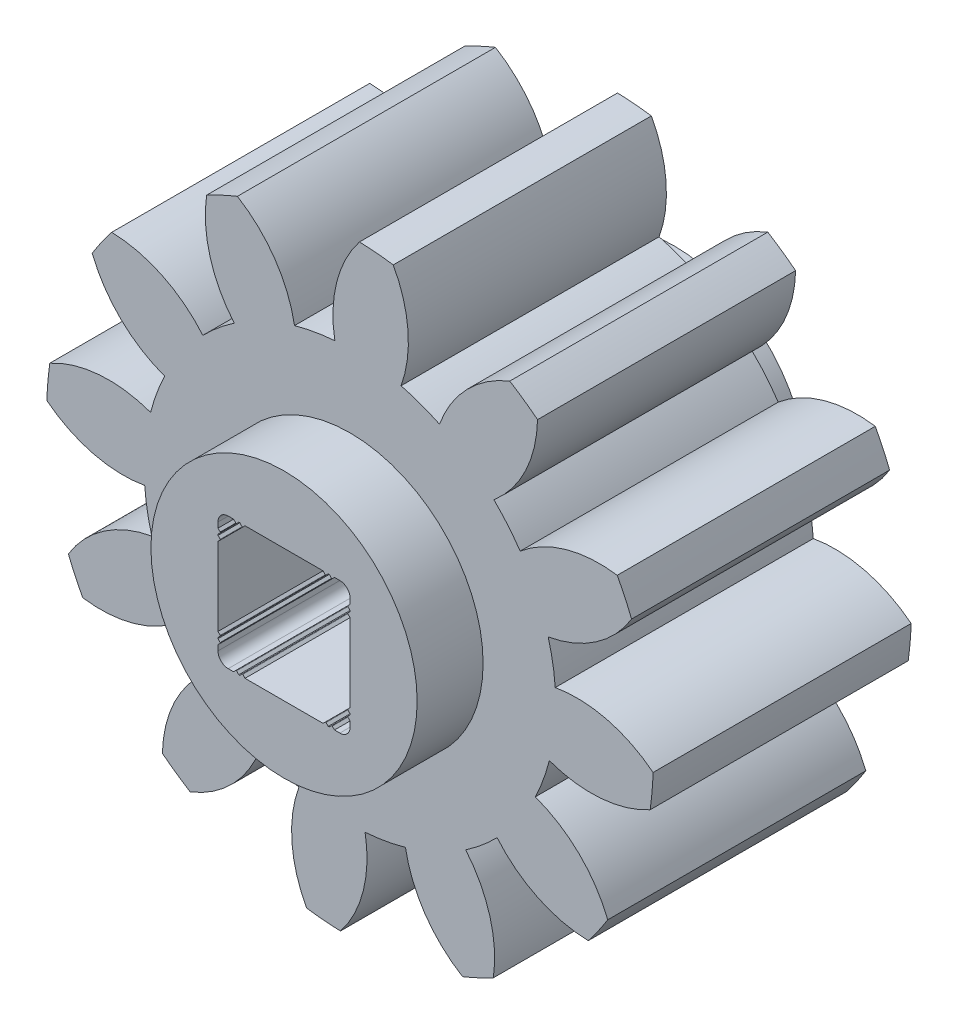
ISO-10303-21;
HEADER;
FILE_DESCRIPTION(('STEP AP214'),'2;1');
FILE_NAME('part.step','',(''),(''),'','','');
FILE_SCHEMA(('AUTOMOTIVE_DESIGN { 1 0 10303 214 1 1 1 1 }'));
ENDSEC;
DATA;
#1=APPLICATION_CONTEXT('core data for automotive mechanical design processes');
#2=APPLICATION_PROTOCOL_DEFINITION('international standard','automotive_design',2000,#1);
#3=PRODUCT_CONTEXT('',#1,'mechanical');
#4=PRODUCT('Part','Part','',(#3));
#5=PRODUCT_RELATED_PRODUCT_CATEGORY('part','',(#4));
#6=PRODUCT_DEFINITION_FORMATION('','',#4);
#7=PRODUCT_DEFINITION_CONTEXT('part definition',#1,'design');
#8=PRODUCT_DEFINITION('design','',#6,#7);
#9=PRODUCT_DEFINITION_SHAPE('','',#8);
#10=(LENGTH_UNIT() NAMED_UNIT(*) SI_UNIT(.MILLI.,.METRE.));
#11=(NAMED_UNIT(*) PLANE_ANGLE_UNIT() SI_UNIT($,.RADIAN.));
#12=(NAMED_UNIT(*) SI_UNIT($,.STERADIAN.) SOLID_ANGLE_UNIT());
#13=UNCERTAINTY_MEASURE_WITH_UNIT(LENGTH_MEASURE(1.E-05),#10,'distance_accuracy_value','');
#14=(GEOMETRIC_REPRESENTATION_CONTEXT(3) GLOBAL_UNCERTAINTY_ASSIGNED_CONTEXT((#13)) GLOBAL_UNIT_ASSIGNED_CONTEXT((#10,
#11,#12)) REPRESENTATION_CONTEXT('',''));
#15=CARTESIAN_POINT('',(0.,0.,0.));
#16=DIRECTION('',(0.,0.,1.));
#17=DIRECTION('',(1.,0.,0.));
#18=AXIS2_PLACEMENT_3D('',#15,#16,#17);
#19=CARTESIAN_POINT('',(0.,0.,3.15));
#20=DIRECTION('',(0.,0.,-1.));
#21=DIRECTION('',(-1.,0.,0.));
#22=AXIS2_PLACEMENT_3D('',#19,#20,#21);
#23=CYLINDRICAL_SURFACE('',#22,5.025);
#24=CARTESIAN_POINT('',(0.,0.,-3.15));
#25=DIRECTION('',(0.,0.,1.));
#26=DIRECTION('',(1.,0.,0.));
#27=AXIS2_PLACEMENT_3D('',#24,#25,#26);
#28=CIRCLE('',#27,5.025);
#29=CARTESIAN_POINT('',(-0.369190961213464,5.01141926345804,-3.15));
#30=VERTEX_POINT('',#29);
#31=CARTESIAN_POINT('',(-1.35378278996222,4.83920418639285,-3.15));
#32=VERTEX_POINT('',#31);
#33=EDGE_CURVE('E1434',#30,#32,#28,.T.);
#34=ORIENTED_EDGE('',*,*,#33,.T.);
#35=DIRECTION('',(0.,0.,1.));
#36=VECTOR('',#35,1.);
#37=CARTESIAN_POINT('',(-1.35378278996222,4.83920418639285,-3.15));
#38=LINE('',#37,#36);
#39=CARTESIAN_POINT('',(-1.35378278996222,4.83920418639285,3.15));
#40=VERTEX_POINT('',#39);
#41=EDGE_CURVE('E1135',#32,#40,#38,.T.);
#42=ORIENTED_EDGE('',*,*,#41,.T.);
#43=CARTESIAN_POINT('',(0.,0.,3.15));
#44=DIRECTION('',(0.,0.,1.));
#45=DIRECTION('',(1.,0.,0.));
#46=AXIS2_PLACEMENT_3D('',#43,#44,#45);
#47=CIRCLE('',#46,5.025);
#48=CARTESIAN_POINT('',(-0.369190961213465,5.01141926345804,3.15));
#49=VERTEX_POINT('',#48);
#50=EDGE_CURVE('E1428',#49,#40,#47,.T.);
#51=ORIENTED_EDGE('',*,*,#50,.F.);
#52=DIRECTION('',(0.,0.,1.));
#53=VECTOR('',#52,1.);
#54=CARTESIAN_POINT('',(-0.369190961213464,5.01141926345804,-3.15));
#55=LINE('',#54,#53);
#56=EDGE_CURVE('E1424',#30,#49,#55,.T.);
#57=ORIENTED_EDGE('',*,*,#56,.F.);
#58=EDGE_LOOP('',(#34,#42,#51,#57));
#59=FACE_BOUND('',#58,.T.);
#60=ADVANCED_FACE('F30',(#59),#23,.T.);
#61=CARTESIAN_POINT('',(-2.82543838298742,4.15542091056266,3.15));
#62=VERTEX_POINT('',#61);
#63=CARTESIAN_POINT('',(-3.59201238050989,3.5139823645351,3.15));
#64=VERTEX_POINT('',#63);
#65=EDGE_CURVE('E1432',#62,#64,#47,.T.);
#66=ORIENTED_EDGE('',*,*,#65,.F.);
#67=DIRECTION('',(0.,0.,1.));
#68=VECTOR('',#67,1.);
#69=CARTESIAN_POINT('',(-2.82543838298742,4.15542091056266,-3.15));
#70=LINE('',#69,#68);
#71=CARTESIAN_POINT('',(-2.82543838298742,4.15542091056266,-3.15));
#72=VERTEX_POINT('',#71);
#73=EDGE_CURVE('E1138',#72,#62,#70,.T.);
#74=ORIENTED_EDGE('',*,*,#73,.F.);
#75=CARTESIAN_POINT('',(-3.59201238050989,3.5139823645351,-3.15));
#76=VERTEX_POINT('',#75);
#77=EDGE_CURVE('E1437',#72,#76,#28,.T.);
#78=ORIENTED_EDGE('',*,*,#77,.T.);
#79=DIRECTION('',(0.,0.,1.));
#80=VECTOR('',#79,1.);
#81=CARTESIAN_POINT('',(-3.59201238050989,3.5139823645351,-3.15));
#82=LINE('',#81,#80);
#83=EDGE_CURVE('E1161',#76,#64,#82,.T.);
#84=ORIENTED_EDGE('',*,*,#83,.T.);
#85=EDGE_LOOP('',(#66,#74,#78,#84));
#86=FACE_BOUND('',#85,.T.);
#87=ADVANCED_FACE('F1794',(#86),#23,.T.);
#88=CARTESIAN_POINT('',(-4.52461187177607,2.18598088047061,3.15));
#89=VERTEX_POINT('',#88);
#90=CARTESIAN_POINT('',(-4.86776515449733,1.24719180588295,3.15));
#91=VERTEX_POINT('',#90);
#92=EDGE_CURVE('E1907',#89,#91,#47,.T.);
#93=ORIENTED_EDGE('',*,*,#92,.F.);
#94=DIRECTION('',(0.,0.,1.));
#95=VECTOR('',#94,1.);
#96=CARTESIAN_POINT('',(-4.52461187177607,2.18598088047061,-3.15));
#97=LINE('',#96,#95);
#98=CARTESIAN_POINT('',(-4.52461187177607,2.18598088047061,-3.15));
#99=VERTEX_POINT('',#98);
#100=EDGE_CURVE('E1164',#99,#89,#97,.T.);
#101=ORIENTED_EDGE('',*,*,#100,.F.);
#102=CARTESIAN_POINT('',(-4.86776515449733,1.24719180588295,-3.15));
#103=VERTEX_POINT('',#102);
#104=EDGE_CURVE('E1881',#99,#103,#28,.T.);
#105=ORIENTED_EDGE('',*,*,#104,.T.);
#106=DIRECTION('',(0.,0.,1.));
#107=VECTOR('',#106,1.);
#108=CARTESIAN_POINT('',(-4.86776515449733,1.24719180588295,-3.15));
#109=LINE('',#108,#107);
#110=EDGE_CURVE('E1187',#103,#91,#109,.T.);
#111=ORIENTED_EDGE('',*,*,#110,.T.);
#112=EDGE_LOOP('',(#93,#101,#105,#111));
#113=FACE_BOUND('',#112,.T.);
#114=ADVANCED_FACE('F1801',(#113),#23,.T.);
#115=CARTESIAN_POINT('',(-5.01141926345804,-0.369190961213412,3.15));
#116=VERTEX_POINT('',#115);
#117=CARTESIAN_POINT('',(-4.83920418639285,-1.35378278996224,3.15));
#118=VERTEX_POINT('',#117);
#119=EDGE_CURVE('E1908',#116,#118,#47,.T.);
#120=ORIENTED_EDGE('',*,*,#119,.F.);
#121=DIRECTION('',(0.,0.,1.));
#122=VECTOR('',#121,1.);
#123=CARTESIAN_POINT('',(-5.01141926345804,-0.369190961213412,-3.15));
#124=LINE('',#123,#122);
#125=CARTESIAN_POINT('',(-5.01141926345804,-0.369190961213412,-3.15));
#126=VERTEX_POINT('',#125);
#127=EDGE_CURVE('E1190',#126,#116,#124,.T.);
#128=ORIENTED_EDGE('',*,*,#127,.F.);
#129=CARTESIAN_POINT('',(-4.83920418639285,-1.35378278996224,-3.15));
#130=VERTEX_POINT('',#129);
#131=EDGE_CURVE('E1876',#126,#130,#28,.T.);
#132=ORIENTED_EDGE('',*,*,#131,.T.);
#133=DIRECTION('',(0.,0.,1.));
#134=VECTOR('',#133,1.);
#135=CARTESIAN_POINT('',(-4.83920418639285,-1.35378278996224,-3.15));
#136=LINE('',#135,#134);
#137=EDGE_CURVE('E1213',#130,#118,#136,.T.);
#138=ORIENTED_EDGE('',*,*,#137,.T.);
#139=EDGE_LOOP('',(#120,#128,#132,#138));
#140=FACE_BOUND('',#139,.T.);
#141=ADVANCED_FACE('F2068',(#140),#23,.T.);
#142=CARTESIAN_POINT('',(-4.15542091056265,-2.82543838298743,3.15));
#143=VERTEX_POINT('',#142);
#144=CARTESIAN_POINT('',(-3.51398236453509,-3.5920123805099,3.15));
#145=VERTEX_POINT('',#144);
#146=EDGE_CURVE('E1911',#143,#145,#47,.T.);
#147=ORIENTED_EDGE('',*,*,#146,.F.);
#148=DIRECTION('',(0.,0.,1.));
#149=VECTOR('',#148,1.);
#150=CARTESIAN_POINT('',(-4.15542091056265,-2.82543838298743,-3.15));
#151=LINE('',#150,#149);
#152=CARTESIAN_POINT('',(-4.15542091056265,-2.82543838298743,-3.15));
#153=VERTEX_POINT('',#152);
#154=EDGE_CURVE('E1216',#153,#143,#151,.T.);
#155=ORIENTED_EDGE('',*,*,#154,.F.);
#156=CARTESIAN_POINT('',(-3.51398236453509,-3.5920123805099,-3.15));
#157=VERTEX_POINT('',#156);
#158=EDGE_CURVE('E1871',#153,#157,#28,.T.);
#159=ORIENTED_EDGE('',*,*,#158,.T.);
#160=DIRECTION('',(0.,0.,1.));
#161=VECTOR('',#160,1.);
#162=CARTESIAN_POINT('',(-3.51398236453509,-3.5920123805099,-3.15));
#163=LINE('',#162,#161);
#164=EDGE_CURVE('E1239',#157,#145,#163,.T.);
#165=ORIENTED_EDGE('',*,*,#164,.T.);
#166=EDGE_LOOP('',(#147,#155,#159,#165));
#167=FACE_BOUND('',#166,.T.);
#168=ADVANCED_FACE('F2076',(#167),#23,.T.);
#169=CARTESIAN_POINT('',(-2.1859808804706,-4.52461187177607,3.15));
#170=VERTEX_POINT('',#169);
#171=CARTESIAN_POINT('',(-1.24719180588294,-4.86776515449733,3.15));
#172=VERTEX_POINT('',#171);
#173=EDGE_CURVE('E1914',#170,#172,#47,.T.);
#174=ORIENTED_EDGE('',*,*,#173,.F.);
#175=DIRECTION('',(0.,0.,1.));
#176=VECTOR('',#175,1.);
#177=CARTESIAN_POINT('',(-2.1859808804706,-4.52461187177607,-3.15));
#178=LINE('',#177,#176);
#179=CARTESIAN_POINT('',(-2.1859808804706,-4.52461187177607,-3.15));
#180=VERTEX_POINT('',#179);
#181=EDGE_CURVE('E1242',#180,#170,#178,.T.);
#182=ORIENTED_EDGE('',*,*,#181,.F.);
#183=CARTESIAN_POINT('',(-1.24719180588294,-4.86776515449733,-3.15));
#184=VERTEX_POINT('',#183);
#185=EDGE_CURVE('E1866',#180,#184,#28,.T.);
#186=ORIENTED_EDGE('',*,*,#185,.T.);
#187=DIRECTION('',(0.,0.,1.));
#188=VECTOR('',#187,1.);
#189=CARTESIAN_POINT('',(-1.24719180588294,-4.86776515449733,-3.15));
#190=LINE('',#189,#188);
#191=EDGE_CURVE('E1265',#184,#172,#190,.T.);
#192=ORIENTED_EDGE('',*,*,#191,.T.);
#193=EDGE_LOOP('',(#174,#182,#186,#192));
#194=FACE_BOUND('',#193,.T.);
#195=ADVANCED_FACE('F1941',(#194),#23,.T.);
#196=CARTESIAN_POINT('',(0.369190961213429,-5.01141926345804,3.15));
#197=VERTEX_POINT('',#196);
#198=CARTESIAN_POINT('',(1.35378278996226,-4.83920418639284,3.15));
#199=VERTEX_POINT('',#198);
#200=EDGE_CURVE('E1917',#197,#199,#47,.T.);
#201=ORIENTED_EDGE('',*,*,#200,.F.);
#202=DIRECTION('',(0.,0.,1.));
#203=VECTOR('',#202,1.);
#204=CARTESIAN_POINT('',(0.369190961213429,-5.01141926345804,-3.15));
#205=LINE('',#204,#203);
#206=CARTESIAN_POINT('',(0.369190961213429,-5.01141926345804,-3.15));
#207=VERTEX_POINT('',#206);
#208=EDGE_CURVE('E1268',#207,#197,#205,.T.);
#209=ORIENTED_EDGE('',*,*,#208,.F.);
#210=CARTESIAN_POINT('',(1.35378278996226,-4.83920418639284,-3.15));
#211=VERTEX_POINT('',#210);
#212=EDGE_CURVE('E1861',#207,#211,#28,.T.);
#213=ORIENTED_EDGE('',*,*,#212,.T.);
#214=DIRECTION('',(0.,0.,1.));
#215=VECTOR('',#214,1.);
#216=CARTESIAN_POINT('',(1.35378278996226,-4.83920418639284,-3.15));
#217=LINE('',#216,#215);
#218=EDGE_CURVE('E1291',#211,#199,#217,.T.);
#219=ORIENTED_EDGE('',*,*,#218,.T.);
#220=EDGE_LOOP('',(#201,#209,#213,#219));
#221=FACE_BOUND('',#220,.T.);
#222=ADVANCED_FACE('F1937',(#221),#23,.T.);
#223=CARTESIAN_POINT('',(2.82543838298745,-4.15542091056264,3.15));
#224=VERTEX_POINT('',#223);
#225=CARTESIAN_POINT('',(3.59201238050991,-3.51398236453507,3.15));
#226=VERTEX_POINT('',#225);
#227=EDGE_CURVE('E1920',#224,#226,#47,.T.);
#228=ORIENTED_EDGE('',*,*,#227,.F.);
#229=DIRECTION('',(0.,0.,1.));
#230=VECTOR('',#229,1.);
#231=CARTESIAN_POINT('',(2.82543838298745,-4.15542091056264,-3.15));
#232=LINE('',#231,#230);
#233=CARTESIAN_POINT('',(2.82543838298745,-4.15542091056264,-3.15));
#234=VERTEX_POINT('',#233);
#235=EDGE_CURVE('E1294',#234,#224,#232,.T.);
#236=ORIENTED_EDGE('',*,*,#235,.F.);
#237=CARTESIAN_POINT('',(3.59201238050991,-3.51398236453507,-3.15));
#238=VERTEX_POINT('',#237);
#239=EDGE_CURVE('E1856',#234,#238,#28,.T.);
#240=ORIENTED_EDGE('',*,*,#239,.T.);
#241=DIRECTION('',(0.,0.,1.));
#242=VECTOR('',#241,1.);
#243=CARTESIAN_POINT('',(3.59201238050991,-3.51398236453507,-3.15));
#244=LINE('',#243,#242);
#245=EDGE_CURVE('E1317',#238,#226,#244,.T.);
#246=ORIENTED_EDGE('',*,*,#245,.T.);
#247=EDGE_LOOP('',(#228,#236,#240,#246));
#248=FACE_BOUND('',#247,.T.);
#249=ADVANCED_FACE('F1933',(#248),#23,.T.);
#250=CARTESIAN_POINT('',(4.52461187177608,-2.18598088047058,3.15));
#251=VERTEX_POINT('',#250);
#252=CARTESIAN_POINT('',(4.86776515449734,-1.24719180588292,3.15));
#253=VERTEX_POINT('',#252);
#254=EDGE_CURVE('E1838',#251,#253,#47,.T.);
#255=ORIENTED_EDGE('',*,*,#254,.F.);
#256=DIRECTION('',(0.,0.,1.));
#257=VECTOR('',#256,1.);
#258=CARTESIAN_POINT('',(4.52461187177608,-2.18598088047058,-3.15));
#259=LINE('',#258,#257);
#260=CARTESIAN_POINT('',(4.52461187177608,-2.18598088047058,-3.15));
#261=VERTEX_POINT('',#260);
#262=EDGE_CURVE('E1320',#261,#251,#259,.T.);
#263=ORIENTED_EDGE('',*,*,#262,.F.);
#264=CARTESIAN_POINT('',(4.86776515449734,-1.24719180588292,-3.15));
#265=VERTEX_POINT('',#264);
#266=EDGE_CURVE('E1852',#261,#265,#28,.T.);
#267=ORIENTED_EDGE('',*,*,#266,.T.);
#268=DIRECTION('',(0.,0.,1.));
#269=VECTOR('',#268,1.);
#270=CARTESIAN_POINT('',(4.86776515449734,-1.24719180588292,-3.15));
#271=LINE('',#270,#269);
#272=EDGE_CURVE('E1343',#265,#253,#271,.T.);
#273=ORIENTED_EDGE('',*,*,#272,.T.);
#274=EDGE_LOOP('',(#255,#263,#267,#273));
#275=FACE_BOUND('',#274,.T.);
#276=ADVANCED_FACE('F1828',(#275),#23,.T.);
#277=CARTESIAN_POINT('',(5.01141926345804,0.369190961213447,3.15));
#278=VERTEX_POINT('',#277);
#279=CARTESIAN_POINT('',(4.83920418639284,1.35378278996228,3.15));
#280=VERTEX_POINT('',#279);
#281=EDGE_CURVE('E1837',#278,#280,#47,.T.);
#282=ORIENTED_EDGE('',*,*,#281,.F.);
#283=DIRECTION('',(0.,0.,1.));
#284=VECTOR('',#283,1.);
#285=CARTESIAN_POINT('',(5.01141926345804,0.369190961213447,-3.15));
#286=LINE('',#285,#284);
#287=CARTESIAN_POINT('',(5.01141926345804,0.369190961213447,-3.15));
#288=VERTEX_POINT('',#287);
#289=EDGE_CURVE('E1346',#288,#278,#286,.T.);
#290=ORIENTED_EDGE('',*,*,#289,.F.);
#291=CARTESIAN_POINT('',(4.83920418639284,1.35378278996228,-3.15));
#292=VERTEX_POINT('',#291);
#293=EDGE_CURVE('E1851',#288,#292,#28,.T.);
#294=ORIENTED_EDGE('',*,*,#293,.T.);
#295=DIRECTION('',(0.,0.,1.));
#296=VECTOR('',#295,1.);
#297=CARTESIAN_POINT('',(4.83920418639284,1.35378278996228,-3.15));
#298=LINE('',#297,#296);
#299=EDGE_CURVE('E1369',#292,#280,#298,.T.);
#300=ORIENTED_EDGE('',*,*,#299,.T.);
#301=EDGE_LOOP('',(#282,#290,#294,#300));
#302=FACE_BOUND('',#301,.T.);
#303=ADVANCED_FACE('F1820',(#302),#23,.T.);
#304=CARTESIAN_POINT('',(4.15542091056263,2.82543838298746,3.15));
#305=VERTEX_POINT('',#304);
#306=CARTESIAN_POINT('',(3.51398236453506,3.59201238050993,3.15));
#307=VERTEX_POINT('',#306);
#308=EDGE_CURVE('E1832',#305,#307,#47,.T.);
#309=ORIENTED_EDGE('',*,*,#308,.F.);
#310=DIRECTION('',(0.,0.,1.));
#311=VECTOR('',#310,1.);
#312=CARTESIAN_POINT('',(4.15542091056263,2.82543838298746,-3.15));
#313=LINE('',#312,#311);
#314=CARTESIAN_POINT('',(4.15542091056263,2.82543838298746,-3.15));
#315=VERTEX_POINT('',#314);
#316=EDGE_CURVE('E1372',#315,#305,#313,.T.);
#317=ORIENTED_EDGE('',*,*,#316,.F.);
#318=CARTESIAN_POINT('',(3.51398236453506,3.59201238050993,-3.15));
#319=VERTEX_POINT('',#318);
#320=EDGE_CURVE('E1850',#315,#319,#28,.T.);
#321=ORIENTED_EDGE('',*,*,#320,.T.);
#322=DIRECTION('',(0.,0.,1.));
#323=VECTOR('',#322,1.);
#324=CARTESIAN_POINT('',(3.51398236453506,3.59201238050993,-3.15));
#325=LINE('',#324,#323);
#326=EDGE_CURVE('E1395',#319,#307,#325,.T.);
#327=ORIENTED_EDGE('',*,*,#326,.T.);
#328=EDGE_LOOP('',(#309,#317,#321,#327));
#329=FACE_BOUND('',#328,.T.);
#330=ADVANCED_FACE('F1808',(#329),#23,.T.);
#331=CARTESIAN_POINT('',(0.,0.,4.76));
#332=DIRECTION('',(0.,0.,-1.));
#333=DIRECTION('',(-1.,0.,0.));
#334=AXIS2_PLACEMENT_3D('',#331,#332,#333);
#335=CYLINDRICAL_SURFACE('',#334,3.25);
#336=CARTESIAN_POINT('',(0.,0.,3.15));
#337=DIRECTION('',(0.,0.,1.));
#338=DIRECTION('',(1.,0.,0.));
#339=AXIS2_PLACEMENT_3D('',#336,#337,#338);
#340=CIRCLE('',#339,3.25);
#341=CARTESIAN_POINT('',(3.25,0.,3.15));
#342=VERTEX_POINT('',#341);
#343=EDGE_CURVE('E1431',#342,#342,#340,.T.);
#344=ORIENTED_EDGE('',*,*,#343,.T.);
#345=EDGE_LOOP('',(#344));
#346=FACE_BOUND('',#345,.T.);
#347=CARTESIAN_POINT('',(0.,0.,4.76));
#348=DIRECTION('',(0.,0.,1.));
#349=DIRECTION('',(1.,0.,0.));
#350=AXIS2_PLACEMENT_3D('',#347,#348,#349);
#351=CIRCLE('',#350,3.25);
#352=CARTESIAN_POINT('',(3.25,0.,4.76));
#353=VERTEX_POINT('',#352);
#354=EDGE_CURVE('E1438',#353,#353,#351,.T.);
#355=ORIENTED_EDGE('',*,*,#354,.F.);
#356=EDGE_LOOP('',(#355));
#357=FACE_BOUND('',#356,.T.);
#358=ADVANCED_FACE('F1819',(#346,#357),#335,.T.);
#359=CARTESIAN_POINT('',(0.,0.,4.76));
#360=DIRECTION('',(0.,0.,1.));
#361=DIRECTION('',(1.,0.,0.));
#362=AXIS2_PLACEMENT_3D('',#359,#360,#361);
#363=PLANE('',#362);
#364=DIRECTION('',(-1.,0.,0.));
#365=VECTOR('',#364,1.);
#366=CARTESIAN_POINT('',(0.95210000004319,1.61249999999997,4.76));
#367=LINE('',#366,#365);
#368=CARTESIAN_POINT('',(0.95210000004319,1.61249999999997,4.76));
#369=VERTEX_POINT('',#368);
#370=CARTESIAN_POINT('',(-0.95210000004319,1.61249999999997,4.76));
#371=VERTEX_POINT('',#370);
#372=EDGE_CURVE('E786',#369,#371,#367,.T.);
#373=ORIENTED_EDGE('',*,*,#372,.F.);
#374=DIRECTION('',(-0.709259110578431,0.704947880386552,0.));
#375=VECTOR('',#374,1.);
#376=CARTESIAN_POINT('',(0.95210000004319,1.61249999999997,4.76));
#377=LINE('',#376,#375);
#378=CARTESIAN_POINT('',(1.0067561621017,1.55817606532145,4.76));
#379=VERTEX_POINT('',#378);
#380=EDGE_CURVE('E981',#379,#369,#377,.T.);
#381=ORIENTED_EDGE('',*,*,#380,.F.);
#382=CARTESIAN_POINT('',(1.01599458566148,1.56696843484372,4.76));
#383=DIRECTION('',(0.,0.,-1.));
#384=DIRECTION('',(-1.,0.,0.));
#385=AXIS2_PLACEMENT_3D('',#382,#383,#384);
#386=CIRCLE('',#385,0.0127535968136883);
#387=CARTESIAN_POINT('',(1.02507176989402,1.558009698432,4.76));
#388=VERTEX_POINT('',#387);
#389=EDGE_CURVE('E978',#388,#379,#386,.T.);
#390=ORIENTED_EDGE('',*,*,#389,.F.);
#391=DIRECTION('',(-0.707106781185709,-0.707106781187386,0.));
#392=VECTOR('',#391,1.);
#393=CARTESIAN_POINT('',(1.02507176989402,1.558009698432,4.76));
#394=LINE('',#393,#392);
#395=CARTESIAN_POINT('',(1.07956207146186,1.61249999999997,4.76));
#396=VERTEX_POINT('',#395);
#397=EDGE_CURVE('E975',#396,#388,#394,.T.);
#398=ORIENTED_EDGE('',*,*,#397,.F.);
#399=DIRECTION('',(-1.,0.,0.));
#400=VECTOR('',#399,1.);
#401=CARTESIAN_POINT('',(1.07956207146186,1.61249999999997,4.76));
#402=LINE('',#401,#400);
#403=CARTESIAN_POINT('',(1.10496207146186,1.61249999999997,4.76));
#404=VERTEX_POINT('',#403);
#405=EDGE_CURVE('E972',#404,#396,#402,.T.);
#406=ORIENTED_EDGE('',*,*,#405,.F.);
#407=DIRECTION('',(-0.706967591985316,0.707245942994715,0.));
#408=VECTOR('',#407,1.);
#409=CARTESIAN_POINT('',(1.10496207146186,1.61249999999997,4.76));
#410=LINE('',#409,#408);
#411=CARTESIAN_POINT('',(1.15944164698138,1.55799897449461,4.76));
#412=VERTEX_POINT('',#411);
#413=EDGE_CURVE('E969',#412,#404,#410,.T.);
#414=ORIENTED_EDGE('',*,*,#413,.F.);
#415=CARTESIAN_POINT('',(1.16845134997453,1.56702557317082,4.76));
#416=DIRECTION('',(0.,0.,-1.));
#417=DIRECTION('',(-1.,0.,0.));
#418=AXIS2_PLACEMENT_3D('',#415,#416,#417);
#419=CIRCLE('',#418,0.0127535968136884);
#420=CARTESIAN_POINT('',(1.17753759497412,1.55807602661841,4.76));
#421=VERTEX_POINT('',#420);
#422=EDGE_CURVE('E966',#421,#412,#419,.T.);
#423=ORIENTED_EDGE('',*,*,#422,.F.);
#424=DIRECTION('',(-0.701727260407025,-0.712445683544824,0.));
#425=VECTOR('',#424,1.);
#426=CARTESIAN_POINT('',(1.17753759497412,1.55807602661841,4.76));
#427=LINE('',#426,#425);
#428=CARTESIAN_POINT('',(1.23161334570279,1.61297774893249,4.76));
#429=VERTEX_POINT('',#428);
#430=EDGE_CURVE('E963',#429,#421,#427,.T.);
#431=ORIENTED_EDGE('',*,*,#430,.F.);
#432=DIRECTION('',(-1.,0.,0.));
#433=VECTOR('',#432,1.);
#434=CARTESIAN_POINT('',(1.23161334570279,1.61297774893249,4.76));
#435=LINE('',#434,#433);
#436=CARTESIAN_POINT('',(1.3626042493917,1.61297774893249,4.76));
#437=VERTEX_POINT('',#436);
#438=EDGE_CURVE('E961',#437,#429,#435,.T.);
#439=ORIENTED_EDGE('',*,*,#438,.F.);
#440=CARTESIAN_POINT('',(1.3626042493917,1.36297774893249,4.76));
#441=DIRECTION('',(0.,0.,1.));
#442=DIRECTION('',(1.,0.,0.));
#443=AXIS2_PLACEMENT_3D('',#440,#441,#442);
#444=CIRCLE('',#443,0.25);
#445=CARTESIAN_POINT('',(1.6126042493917,1.36297774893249,4.76));
#446=VERTEX_POINT('',#445);
#447=EDGE_CURVE('E1476',#437,#446,#444,.F.);
#448=ORIENTED_EDGE('',*,*,#447,.T.);
#449=DIRECTION('',(0.,1.,0.));
#450=VECTOR('',#449,1.);
#451=CARTESIAN_POINT('',(1.6126042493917,1.23149977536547,4.76));
#452=LINE('',#451,#450);
#453=CARTESIAN_POINT('',(1.6126042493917,1.23149977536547,4.76));
#454=VERTEX_POINT('',#453);
#455=EDGE_CURVE('E958',#454,#446,#452,.T.);
#456=ORIENTED_EDGE('',*,*,#455,.F.);
#457=DIRECTION('',(0.711623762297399,0.702560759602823,0.));
#458=VECTOR('',#457,1.);
#459=CARTESIAN_POINT('',(1.6126042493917,1.23149977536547,4.76));
#460=LINE('',#459,#458);
#461=CARTESIAN_POINT('',(1.55776586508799,1.17735979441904,4.76));
#462=VERTEX_POINT('',#461);
#463=EDGE_CURVE('E955',#462,#454,#460,.T.);
#464=ORIENTED_EDGE('',*,*,#463,.F.);
#465=CARTESIAN_POINT('',(1.58445772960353,1.16842833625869,4.76));
#466=DIRECTION('',(0.,0.,-1.));
#467=DIRECTION('',(-1.,0.,0.));
#468=AXIS2_PLACEMENT_3D('',#465,#466,#467);
#469=CIRCLE('',#468,0.0281465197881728);
#470=CARTESIAN_POINT('',(1.55776586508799,1.15949687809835,4.76));
#471=VERTEX_POINT('',#470);
#472=EDGE_CURVE('E952',#471,#462,#469,.T.);
#473=ORIENTED_EDGE('',*,*,#472,.F.);
#474=DIRECTION('',(-0.70657045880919,0.70764269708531,0.));
#475=VECTOR('',#474,1.);
#476=CARTESIAN_POINT('',(1.55776586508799,1.15949687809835,4.76));
#477=LINE('',#476,#475);
#478=CARTESIAN_POINT('',(1.61255217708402,1.10462742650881,4.76));
#479=VERTEX_POINT('',#478);
#480=EDGE_CURVE('E949',#479,#471,#477,.T.);
#481=ORIENTED_EDGE('',*,*,#480,.F.);
#482=DIRECTION('',(0.,1.,0.));
#483=VECTOR('',#482,1.);
#484=CARTESIAN_POINT('',(1.61255217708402,1.10462742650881,4.76));
#485=LINE('',#484,#483);
#486=CARTESIAN_POINT('',(1.61255217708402,1.07922742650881,4.76));
#487=VERTEX_POINT('',#486);
#488=EDGE_CURVE('E946',#487,#479,#485,.T.);
#489=ORIENTED_EDGE('',*,*,#488,.F.);
#490=DIRECTION('',(0.707934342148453,0.706278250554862,0.));
#491=VECTOR('',#490,1.);
#492=CARTESIAN_POINT('',(1.61255217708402,1.07922742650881,4.76));
#493=LINE('',#492,#491);
#494=CARTESIAN_POINT('',(1.55766011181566,1.02446377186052,4.76));
#495=VERTEX_POINT('',#494);
#496=EDGE_CURVE('E943',#495,#487,#493,.T.);
#497=ORIENTED_EDGE('',*,*,#496,.F.);
#498=CARTESIAN_POINT('',(1.56643433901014,1.01589501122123,4.76));
#499=DIRECTION('',(0.,0.,-1.));
#500=DIRECTION('',(-1.,0.,0.));
#501=AXIS2_PLACEMENT_3D('',#498,#499,#500);
#502=CIRCLE('',#501,0.0122642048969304);
#503=CARTESIAN_POINT('',(1.5578657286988,1.00712063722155,4.76));
#504=VERTEX_POINT('',#503);
#505=EDGE_CURVE('E940',#504,#495,#502,.T.);
#506=ORIENTED_EDGE('',*,*,#505,.F.);
#507=DIRECTION('',(-0.704609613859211,0.709595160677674,0.));
#508=VECTOR('',#507,1.);
#509=CARTESIAN_POINT('',(1.5578657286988,1.00712063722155,4.76));
#510=LINE('',#509,#508);
#511=CARTESIAN_POINT('',(1.61250000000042,0.952099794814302,4.76));
#512=VERTEX_POINT('',#511);
#513=EDGE_CURVE('E937',#512,#504,#510,.T.);
#514=ORIENTED_EDGE('',*,*,#513,.F.);
#515=DIRECTION('',(0.,1.,0.));
#516=VECTOR('',#515,1.);
#517=CARTESIAN_POINT('',(1.61250000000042,0.952099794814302,4.76));
#518=LINE('',#517,#516);
#519=CARTESIAN_POINT('',(1.61250000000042,-0.952099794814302,4.76));
#520=VERTEX_POINT('',#519);
#521=EDGE_CURVE('E934',#520,#512,#518,.T.);
#522=ORIENTED_EDGE('',*,*,#521,.F.);
#523=DIRECTION('',(0.704609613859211,0.709595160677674,0.));
#524=VECTOR('',#523,1.);
#525=CARTESIAN_POINT('',(1.5578657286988,-1.00712063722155,4.76));
#526=LINE('',#525,#524);
#527=CARTESIAN_POINT('',(1.5578657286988,-1.00712063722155,4.76));
#528=VERTEX_POINT('',#527);
#529=EDGE_CURVE('E931',#528,#520,#526,.T.);
#530=ORIENTED_EDGE('',*,*,#529,.F.);
#531=CARTESIAN_POINT('',(1.56643433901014,-1.01589501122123,4.76));
#532=DIRECTION('',(0.,0.,-1.));
#533=DIRECTION('',(1.,0.,0.));
#534=AXIS2_PLACEMENT_3D('',#531,#532,#533);
#535=CIRCLE('',#534,0.0122642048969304);
#536=CARTESIAN_POINT('',(1.55766011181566,-1.02446377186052,4.76));
#537=VERTEX_POINT('',#536);
#538=EDGE_CURVE('E928',#537,#528,#535,.T.);
#539=ORIENTED_EDGE('',*,*,#538,.F.);
#540=DIRECTION('',(-0.707934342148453,0.706278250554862,0.));
#541=VECTOR('',#540,1.);
#542=CARTESIAN_POINT('',(1.61255217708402,-1.07922742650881,4.76));
#543=LINE('',#542,#541);
#544=CARTESIAN_POINT('',(1.61255217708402,-1.07922742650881,4.76));
#545=VERTEX_POINT('',#544);
#546=EDGE_CURVE('E925',#545,#537,#543,.T.);
#547=ORIENTED_EDGE('',*,*,#546,.F.);
#548=DIRECTION('',(0.,1.,0.));
#549=VECTOR('',#548,1.);
#550=CARTESIAN_POINT('',(1.61255217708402,-1.10462742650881,4.76));
#551=LINE('',#550,#549);
#552=CARTESIAN_POINT('',(1.61255217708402,-1.10462742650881,4.76));
#553=VERTEX_POINT('',#552);
#554=EDGE_CURVE('E922',#553,#545,#551,.T.);
#555=ORIENTED_EDGE('',*,*,#554,.F.);
#556=DIRECTION('',(0.70657045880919,0.70764269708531,0.));
#557=VECTOR('',#556,1.);
#558=CARTESIAN_POINT('',(1.55776586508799,-1.15949687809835,4.76));
#559=LINE('',#558,#557);
#560=CARTESIAN_POINT('',(1.55776586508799,-1.15949687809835,4.76));
#561=VERTEX_POINT('',#560);
#562=EDGE_CURVE('E919',#561,#553,#559,.T.);
#563=ORIENTED_EDGE('',*,*,#562,.F.);
#564=CARTESIAN_POINT('',(1.58445772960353,-1.16842833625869,4.76));
#565=DIRECTION('',(0.,0.,-1.));
#566=DIRECTION('',(1.,0.,0.));
#567=AXIS2_PLACEMENT_3D('',#564,#565,#566);
#568=CIRCLE('',#567,0.0281465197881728);
#569=CARTESIAN_POINT('',(1.55776586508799,-1.17735979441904,4.76));
#570=VERTEX_POINT('',#569);
#571=EDGE_CURVE('E916',#570,#561,#568,.T.);
#572=ORIENTED_EDGE('',*,*,#571,.F.);
#573=DIRECTION('',(-0.711623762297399,0.702560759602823,0.));
#574=VECTOR('',#573,1.);
#575=CARTESIAN_POINT('',(1.6126042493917,-1.23149977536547,4.76));
#576=LINE('',#575,#574);
#577=CARTESIAN_POINT('',(1.6126042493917,-1.23149977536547,4.76));
#578=VERTEX_POINT('',#577);
#579=EDGE_CURVE('E913',#578,#570,#576,.T.);
#580=ORIENTED_EDGE('',*,*,#579,.F.);
#581=DIRECTION('',(0.,1.,0.));
#582=VECTOR('',#581,1.);
#583=CARTESIAN_POINT('',(1.6126042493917,-1.23149977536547,4.76));
#584=LINE('',#583,#582);
#585=CARTESIAN_POINT('',(1.6126042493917,-1.36297774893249,4.76));
#586=VERTEX_POINT('',#585);
#587=EDGE_CURVE('E911',#586,#578,#584,.T.);
#588=ORIENTED_EDGE('',*,*,#587,.F.);
#589=CARTESIAN_POINT('',(1.3626042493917,-1.36297774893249,4.76));
#590=DIRECTION('',(0.,0.,1.));
#591=DIRECTION('',(1.,0.,0.));
#592=AXIS2_PLACEMENT_3D('',#589,#590,#591);
#593=CIRCLE('',#592,0.25);
#594=CARTESIAN_POINT('',(1.3626042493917,-1.61297774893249,4.76));
#595=VERTEX_POINT('',#594);
#596=EDGE_CURVE('E1472',#586,#595,#593,.F.);
#597=ORIENTED_EDGE('',*,*,#596,.T.);
#598=DIRECTION('',(1.,0.,0.));
#599=VECTOR('',#598,1.);
#600=CARTESIAN_POINT('',(1.23161334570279,-1.61297774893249,4.76));
#601=LINE('',#600,#599);
#602=CARTESIAN_POINT('',(1.23161334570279,-1.61297774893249,4.76));
#603=VERTEX_POINT('',#602);
#604=EDGE_CURVE('E908',#603,#595,#601,.T.);
#605=ORIENTED_EDGE('',*,*,#604,.F.);
#606=DIRECTION('',(0.701727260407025,-0.712445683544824,0.));
#607=VECTOR('',#606,1.);
#608=CARTESIAN_POINT('',(1.17753759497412,-1.55807602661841,4.76));
#609=LINE('',#608,#607);
#610=CARTESIAN_POINT('',(1.17753759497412,-1.55807602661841,4.76));
#611=VERTEX_POINT('',#610);
#612=EDGE_CURVE('E905',#611,#603,#609,.T.);
#613=ORIENTED_EDGE('',*,*,#612,.F.);
#614=CARTESIAN_POINT('',(1.16845134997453,-1.56702557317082,4.76));
#615=DIRECTION('',(0.,0.,-1.));
#616=DIRECTION('',(1.,0.,0.));
#617=AXIS2_PLACEMENT_3D('',#614,#615,#616);
#618=CIRCLE('',#617,0.0127535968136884);
#619=CARTESIAN_POINT('',(1.15944164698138,-1.55799897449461,4.76));
#620=VERTEX_POINT('',#619);
#621=EDGE_CURVE('E902',#620,#611,#618,.T.);
#622=ORIENTED_EDGE('',*,*,#621,.F.);
#623=DIRECTION('',(0.706967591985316,0.707245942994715,0.));
#624=VECTOR('',#623,1.);
#625=CARTESIAN_POINT('',(1.10496207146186,-1.61249999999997,4.76));
#626=LINE('',#625,#624);
#627=CARTESIAN_POINT('',(1.10496207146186,-1.61249999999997,4.76));
#628=VERTEX_POINT('',#627);
#629=EDGE_CURVE('E899',#628,#620,#626,.T.);
#630=ORIENTED_EDGE('',*,*,#629,.F.);
#631=DIRECTION('',(1.,0.,0.));
#632=VECTOR('',#631,1.);
#633=CARTESIAN_POINT('',(1.07956207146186,-1.61249999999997,4.76));
#634=LINE('',#633,#632);
#635=CARTESIAN_POINT('',(1.07956207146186,-1.61249999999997,4.76));
#636=VERTEX_POINT('',#635);
#637=EDGE_CURVE('E896',#636,#628,#634,.T.);
#638=ORIENTED_EDGE('',*,*,#637,.F.);
#639=DIRECTION('',(0.707106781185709,-0.707106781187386,0.));
#640=VECTOR('',#639,1.);
#641=CARTESIAN_POINT('',(1.02507176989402,-1.558009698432,4.76));
#642=LINE('',#641,#640);
#643=CARTESIAN_POINT('',(1.02507176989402,-1.558009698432,4.76));
#644=VERTEX_POINT('',#643);
#645=EDGE_CURVE('E893',#644,#636,#642,.T.);
#646=ORIENTED_EDGE('',*,*,#645,.F.);
#647=CARTESIAN_POINT('',(1.01599458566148,-1.56696843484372,4.76));
#648=DIRECTION('',(0.,0.,-1.));
#649=DIRECTION('',(1.,0.,0.));
#650=AXIS2_PLACEMENT_3D('',#647,#648,#649);
#651=CIRCLE('',#650,0.0127535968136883);
#652=CARTESIAN_POINT('',(1.0067561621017,-1.55817606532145,4.76));
#653=VERTEX_POINT('',#652);
#654=EDGE_CURVE('E890',#653,#644,#651,.T.);
#655=ORIENTED_EDGE('',*,*,#654,.F.);
#656=DIRECTION('',(0.709259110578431,0.704947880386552,0.));
#657=VECTOR('',#656,1.);
#658=CARTESIAN_POINT('',(0.95210000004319,-1.61249999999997,4.76));
#659=LINE('',#658,#657);
#660=CARTESIAN_POINT('',(0.95210000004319,-1.61249999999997,4.76));
#661=VERTEX_POINT('',#660);
#662=EDGE_CURVE('E887',#661,#653,#659,.T.);
#663=ORIENTED_EDGE('',*,*,#662,.F.);
#664=DIRECTION('',(1.,0.,0.));
#665=VECTOR('',#664,1.);
#666=CARTESIAN_POINT('',(0.95210000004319,-1.61249999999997,4.76));
#667=LINE('',#666,#665);
#668=CARTESIAN_POINT('',(-0.95210000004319,-1.61249999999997,4.76));
#669=VERTEX_POINT('',#668);
#670=EDGE_CURVE('E884',#669,#661,#667,.T.);
#671=ORIENTED_EDGE('',*,*,#670,.F.);
#672=DIRECTION('',(0.709259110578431,-0.704947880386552,0.));
#673=VECTOR('',#672,1.);
#674=CARTESIAN_POINT('',(-0.95210000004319,-1.61249999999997,4.76));
#675=LINE('',#674,#673);
#676=CARTESIAN_POINT('',(-1.0067561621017,-1.55817606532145,4.76));
#677=VERTEX_POINT('',#676);
#678=EDGE_CURVE('E881',#677,#669,#675,.T.);
#679=ORIENTED_EDGE('',*,*,#678,.F.);
#680=CARTESIAN_POINT('',(-1.01599458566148,-1.56696843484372,4.76));
#681=DIRECTION('',(0.,0.,-1.));
#682=DIRECTION('',(-1.,0.,0.));
#683=AXIS2_PLACEMENT_3D('',#680,#681,#682);
#684=CIRCLE('',#683,0.0127535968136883);
#685=CARTESIAN_POINT('',(-1.02507176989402,-1.558009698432,4.76));
#686=VERTEX_POINT('',#685);
#687=EDGE_CURVE('E878',#686,#677,#684,.T.);
#688=ORIENTED_EDGE('',*,*,#687,.F.);
#689=DIRECTION('',(0.707106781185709,0.707106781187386,0.));
#690=VECTOR('',#689,1.);
#691=CARTESIAN_POINT('',(-1.02507176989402,-1.558009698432,4.76));
#692=LINE('',#691,#690);
#693=CARTESIAN_POINT('',(-1.07956207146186,-1.61249999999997,4.76));
#694=VERTEX_POINT('',#693);
#695=EDGE_CURVE('E875',#694,#686,#692,.T.);
#696=ORIENTED_EDGE('',*,*,#695,.F.);
#697=DIRECTION('',(1.,0.,0.));
#698=VECTOR('',#697,1.);
#699=CARTESIAN_POINT('',(-1.07956207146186,-1.61249999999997,4.76));
#700=LINE('',#699,#698);
#701=CARTESIAN_POINT('',(-1.10496207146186,-1.61249999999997,4.76));
#702=VERTEX_POINT('',#701);
#703=EDGE_CURVE('E872',#702,#694,#700,.T.);
#704=ORIENTED_EDGE('',*,*,#703,.F.);
#705=DIRECTION('',(0.706967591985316,-0.707245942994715,0.));
#706=VECTOR('',#705,1.);
#707=CARTESIAN_POINT('',(-1.10496207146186,-1.61249999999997,4.76));
#708=LINE('',#707,#706);
#709=CARTESIAN_POINT('',(-1.15944164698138,-1.55799897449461,4.76));
#710=VERTEX_POINT('',#709);
#711=EDGE_CURVE('E869',#710,#702,#708,.T.);
#712=ORIENTED_EDGE('',*,*,#711,.F.);
#713=CARTESIAN_POINT('',(-1.16845134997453,-1.56702557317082,4.76));
#714=DIRECTION('',(0.,0.,-1.));
#715=DIRECTION('',(-1.,0.,0.));
#716=AXIS2_PLACEMENT_3D('',#713,#714,#715);
#717=CIRCLE('',#716,0.0127535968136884);
#718=CARTESIAN_POINT('',(-1.17753759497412,-1.55807602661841,4.76));
#719=VERTEX_POINT('',#718);
#720=EDGE_CURVE('E866',#719,#710,#717,.T.);
#721=ORIENTED_EDGE('',*,*,#720,.F.);
#722=DIRECTION('',(0.701727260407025,0.712445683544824,0.));
#723=VECTOR('',#722,1.);
#724=CARTESIAN_POINT('',(-1.17753759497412,-1.55807602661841,4.76));
#725=LINE('',#724,#723);
#726=CARTESIAN_POINT('',(-1.23161334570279,-1.61297774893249,4.76));
#727=VERTEX_POINT('',#726);
#728=EDGE_CURVE('E863',#727,#719,#725,.T.);
#729=ORIENTED_EDGE('',*,*,#728,.F.);
#730=DIRECTION('',(1.,0.,0.));
#731=VECTOR('',#730,1.);
#732=CARTESIAN_POINT('',(-1.23161334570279,-1.61297774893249,4.76));
#733=LINE('',#732,#731);
#734=CARTESIAN_POINT('',(-1.3626042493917,-1.61297774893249,4.76));
#735=VERTEX_POINT('',#734);
#736=EDGE_CURVE('E861',#735,#727,#733,.T.);
#737=ORIENTED_EDGE('',*,*,#736,.F.);
#738=CARTESIAN_POINT('',(-1.3626042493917,-1.36297774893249,4.76));
#739=DIRECTION('',(0.,0.,1.));
#740=DIRECTION('',(1.,0.,0.));
#741=AXIS2_PLACEMENT_3D('',#738,#739,#740);
#742=CIRCLE('',#741,0.25);
#743=CARTESIAN_POINT('',(-1.6126042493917,-1.36297774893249,4.76));
#744=VERTEX_POINT('',#743);
#745=EDGE_CURVE('E1468',#735,#744,#742,.F.);
#746=ORIENTED_EDGE('',*,*,#745,.T.);
#747=DIRECTION('',(0.,-1.,0.));
#748=VECTOR('',#747,1.);
#749=CARTESIAN_POINT('',(-1.6126042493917,-1.23149977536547,4.76));
#750=LINE('',#749,#748);
#751=CARTESIAN_POINT('',(-1.6126042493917,-1.23149977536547,4.76));
#752=VERTEX_POINT('',#751);
#753=EDGE_CURVE('E858',#752,#744,#750,.T.);
#754=ORIENTED_EDGE('',*,*,#753,.F.);
#755=DIRECTION('',(-0.711623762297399,-0.702560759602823,0.));
#756=VECTOR('',#755,1.);
#757=CARTESIAN_POINT('',(-1.6126042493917,-1.23149977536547,4.76));
#758=LINE('',#757,#756);
#759=CARTESIAN_POINT('',(-1.55776586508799,-1.17735979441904,4.76));
#760=VERTEX_POINT('',#759);
#761=EDGE_CURVE('E855',#760,#752,#758,.T.);
#762=ORIENTED_EDGE('',*,*,#761,.F.);
#763=CARTESIAN_POINT('',(-1.58445772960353,-1.16842833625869,4.76));
#764=DIRECTION('',(0.,0.,-1.));
#765=DIRECTION('',(-1.,0.,0.));
#766=AXIS2_PLACEMENT_3D('',#763,#764,#765);
#767=CIRCLE('',#766,0.0281465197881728);
#768=CARTESIAN_POINT('',(-1.55776586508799,-1.15949687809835,4.76));
#769=VERTEX_POINT('',#768);
#770=EDGE_CURVE('E852',#769,#760,#767,.T.);
#771=ORIENTED_EDGE('',*,*,#770,.F.);
#772=DIRECTION('',(0.70657045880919,-0.70764269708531,0.));
#773=VECTOR('',#772,1.);
#774=CARTESIAN_POINT('',(-1.55776586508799,-1.15949687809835,4.76));
#775=LINE('',#774,#773);
#776=CARTESIAN_POINT('',(-1.61255217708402,-1.10462742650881,4.76));
#777=VERTEX_POINT('',#776);
#778=EDGE_CURVE('E849',#777,#769,#775,.T.);
#779=ORIENTED_EDGE('',*,*,#778,.F.);
#780=DIRECTION('',(0.,-1.,0.));
#781=VECTOR('',#780,1.);
#782=CARTESIAN_POINT('',(-1.61255217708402,-1.10462742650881,4.76));
#783=LINE('',#782,#781);
#784=CARTESIAN_POINT('',(-1.61255217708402,-1.07922742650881,4.76));
#785=VERTEX_POINT('',#784);
#786=EDGE_CURVE('E846',#785,#777,#783,.T.);
#787=ORIENTED_EDGE('',*,*,#786,.F.);
#788=DIRECTION('',(-0.707934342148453,-0.706278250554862,0.));
#789=VECTOR('',#788,1.);
#790=CARTESIAN_POINT('',(-1.61255217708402,-1.07922742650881,4.76));
#791=LINE('',#790,#789);
#792=CARTESIAN_POINT('',(-1.55766011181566,-1.02446377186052,4.76));
#793=VERTEX_POINT('',#792);
#794=EDGE_CURVE('E843',#793,#785,#791,.T.);
#795=ORIENTED_EDGE('',*,*,#794,.F.);
#796=CARTESIAN_POINT('',(-1.56643433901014,-1.01589501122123,4.76));
#797=DIRECTION('',(0.,0.,-1.));
#798=DIRECTION('',(-1.,0.,0.));
#799=AXIS2_PLACEMENT_3D('',#796,#797,#798);
#800=CIRCLE('',#799,0.0122642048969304);
#801=CARTESIAN_POINT('',(-1.5578657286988,-1.00712063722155,4.76));
#802=VERTEX_POINT('',#801);
#803=EDGE_CURVE('E840',#802,#793,#800,.T.);
#804=ORIENTED_EDGE('',*,*,#803,.F.);
#805=DIRECTION('',(0.704609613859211,-0.709595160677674,0.));
#806=VECTOR('',#805,1.);
#807=CARTESIAN_POINT('',(-1.5578657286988,-1.00712063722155,4.76));
#808=LINE('',#807,#806);
#809=CARTESIAN_POINT('',(-1.61250000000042,-0.952099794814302,4.76));
#810=VERTEX_POINT('',#809);
#811=EDGE_CURVE('E837',#810,#802,#808,.T.);
#812=ORIENTED_EDGE('',*,*,#811,.F.);
#813=DIRECTION('',(0.,-1.,0.));
#814=VECTOR('',#813,1.);
#815=CARTESIAN_POINT('',(-1.61250000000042,0.952099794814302,4.76));
#816=LINE('',#815,#814);
#817=CARTESIAN_POINT('',(-1.61250000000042,0.952099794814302,4.76));
#818=VERTEX_POINT('',#817);
#819=EDGE_CURVE('E834',#818,#810,#816,.T.);
#820=ORIENTED_EDGE('',*,*,#819,.F.);
#821=DIRECTION('',(-0.704609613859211,-0.709595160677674,0.));
#822=VECTOR('',#821,1.);
#823=CARTESIAN_POINT('',(-1.5578657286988,1.00712063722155,4.76));
#824=LINE('',#823,#822);
#825=CARTESIAN_POINT('',(-1.5578657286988,1.00712063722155,4.76));
#826=VERTEX_POINT('',#825);
#827=EDGE_CURVE('E831',#826,#818,#824,.T.);
#828=ORIENTED_EDGE('',*,*,#827,.F.);
#829=CARTESIAN_POINT('',(-1.56643433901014,1.01589501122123,4.76));
#830=DIRECTION('',(0.,0.,-1.));
#831=DIRECTION('',(1.,0.,0.));
#832=AXIS2_PLACEMENT_3D('',#829,#830,#831);
#833=CIRCLE('',#832,0.0122642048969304);
#834=CARTESIAN_POINT('',(-1.55766011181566,1.02446377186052,4.76));
#835=VERTEX_POINT('',#834);
#836=EDGE_CURVE('E828',#835,#826,#833,.T.);
#837=ORIENTED_EDGE('',*,*,#836,.F.);
#838=DIRECTION('',(0.707934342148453,-0.706278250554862,0.));
#839=VECTOR('',#838,1.);
#840=CARTESIAN_POINT('',(-1.61255217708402,1.07922742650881,4.76));
#841=LINE('',#840,#839);
#842=CARTESIAN_POINT('',(-1.61255217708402,1.07922742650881,4.76));
#843=VERTEX_POINT('',#842);
#844=EDGE_CURVE('E825',#843,#835,#841,.T.);
#845=ORIENTED_EDGE('',*,*,#844,.F.);
#846=DIRECTION('',(0.,-1.,0.));
#847=VECTOR('',#846,1.);
#848=CARTESIAN_POINT('',(-1.61255217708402,1.10462742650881,4.76));
#849=LINE('',#848,#847);
#850=CARTESIAN_POINT('',(-1.61255217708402,1.10462742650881,4.76));
#851=VERTEX_POINT('',#850);
#852=EDGE_CURVE('E822',#851,#843,#849,.T.);
#853=ORIENTED_EDGE('',*,*,#852,.F.);
#854=DIRECTION('',(-0.70657045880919,-0.70764269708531,0.));
#855=VECTOR('',#854,1.);
#856=CARTESIAN_POINT('',(-1.55776586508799,1.15949687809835,4.76));
#857=LINE('',#856,#855);
#858=CARTESIAN_POINT('',(-1.55776586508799,1.15949687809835,4.76));
#859=VERTEX_POINT('',#858);
#860=EDGE_CURVE('E819',#859,#851,#857,.T.);
#861=ORIENTED_EDGE('',*,*,#860,.F.);
#862=CARTESIAN_POINT('',(-1.58445772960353,1.16842833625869,4.76));
#863=DIRECTION('',(0.,0.,-1.));
#864=DIRECTION('',(1.,0.,0.));
#865=AXIS2_PLACEMENT_3D('',#862,#863,#864);
#866=CIRCLE('',#865,0.0281465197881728);
#867=CARTESIAN_POINT('',(-1.55776586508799,1.17735979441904,4.76));
#868=VERTEX_POINT('',#867);
#869=EDGE_CURVE('E816',#868,#859,#866,.T.);
#870=ORIENTED_EDGE('',*,*,#869,.F.);
#871=DIRECTION('',(0.711623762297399,-0.702560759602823,0.));
#872=VECTOR('',#871,1.);
#873=CARTESIAN_POINT('',(-1.6126042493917,1.23149977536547,4.76));
#874=LINE('',#873,#872);
#875=CARTESIAN_POINT('',(-1.6126042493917,1.23149977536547,4.76));
#876=VERTEX_POINT('',#875);
#877=EDGE_CURVE('E813',#876,#868,#874,.T.);
#878=ORIENTED_EDGE('',*,*,#877,.F.);
#879=DIRECTION('',(0.,-1.,0.));
#880=VECTOR('',#879,1.);
#881=CARTESIAN_POINT('',(-1.6126042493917,1.23149977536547,4.76));
#882=LINE('',#881,#880);
#883=CARTESIAN_POINT('',(-1.6126042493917,1.36297774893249,4.76));
#884=VERTEX_POINT('',#883);
#885=EDGE_CURVE('E811',#884,#876,#882,.T.);
#886=ORIENTED_EDGE('',*,*,#885,.F.);
#887=CARTESIAN_POINT('',(-1.3626042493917,1.36297774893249,4.76));
#888=DIRECTION('',(0.,0.,1.));
#889=DIRECTION('',(1.,0.,0.));
#890=AXIS2_PLACEMENT_3D('',#887,#888,#889);
#891=CIRCLE('',#890,0.25);
#892=CARTESIAN_POINT('',(-1.3626042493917,1.61297774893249,4.76));
#893=VERTEX_POINT('',#892);
#894=EDGE_CURVE('E38',#884,#893,#891,.F.);
#895=ORIENTED_EDGE('',*,*,#894,.T.);
#896=DIRECTION('',(-1.,0.,0.));
#897=VECTOR('',#896,1.);
#898=CARTESIAN_POINT('',(-1.23161334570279,1.61297774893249,4.76));
#899=LINE('',#898,#897);
#900=CARTESIAN_POINT('',(-1.23161334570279,1.61297774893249,4.76));
#901=VERTEX_POINT('',#900);
#902=EDGE_CURVE('E809',#901,#893,#899,.T.);
#903=ORIENTED_EDGE('',*,*,#902,.F.);
#904=DIRECTION('',(-0.701727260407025,0.712445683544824,0.));
#905=VECTOR('',#904,1.);
#906=CARTESIAN_POINT('',(-1.17753759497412,1.55807602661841,4.76));
#907=LINE('',#906,#905);
#908=CARTESIAN_POINT('',(-1.17753759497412,1.55807602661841,4.76));
#909=VERTEX_POINT('',#908);
#910=EDGE_CURVE('E806',#909,#901,#907,.T.);
#911=ORIENTED_EDGE('',*,*,#910,.F.);
#912=CARTESIAN_POINT('',(-1.16845134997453,1.56702557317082,4.76));
#913=DIRECTION('',(0.,0.,-1.));
#914=DIRECTION('',(1.,0.,0.));
#915=AXIS2_PLACEMENT_3D('',#912,#913,#914);
#916=CIRCLE('',#915,0.0127535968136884);
#917=CARTESIAN_POINT('',(-1.15944164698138,1.55799897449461,4.76));
#918=VERTEX_POINT('',#917);
#919=EDGE_CURVE('E803',#918,#909,#916,.T.);
#920=ORIENTED_EDGE('',*,*,#919,.F.);
#921=DIRECTION('',(-0.706967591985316,-0.707245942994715,0.));
#922=VECTOR('',#921,1.);
#923=CARTESIAN_POINT('',(-1.10496207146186,1.61249999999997,4.76));
#924=LINE('',#923,#922);
#925=CARTESIAN_POINT('',(-1.10496207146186,1.61249999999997,4.76));
#926=VERTEX_POINT('',#925);
#927=EDGE_CURVE('E800',#926,#918,#924,.T.);
#928=ORIENTED_EDGE('',*,*,#927,.F.);
#929=DIRECTION('',(-1.,0.,0.));
#930=VECTOR('',#929,1.);
#931=CARTESIAN_POINT('',(-1.07956207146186,1.61249999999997,4.76));
#932=LINE('',#931,#930);
#933=CARTESIAN_POINT('',(-1.07956207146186,1.61249999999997,4.76));
#934=VERTEX_POINT('',#933);
#935=EDGE_CURVE('E794',#934,#926,#932,.T.);
#936=ORIENTED_EDGE('',*,*,#935,.F.);
#937=DIRECTION('',(-0.707106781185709,0.707106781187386,0.));
#938=VECTOR('',#937,1.);
#939=CARTESIAN_POINT('',(-1.02507176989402,1.558009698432,4.76));
#940=LINE('',#939,#938);
#941=CARTESIAN_POINT('',(-1.02507176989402,1.558009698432,4.76));
#942=VERTEX_POINT('',#941);
#943=EDGE_CURVE('E792',#942,#934,#940,.T.);
#944=ORIENTED_EDGE('',*,*,#943,.F.);
#945=CARTESIAN_POINT('',(-1.01599458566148,1.56696843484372,4.76));
#946=DIRECTION('',(0.,0.,-1.));
#947=DIRECTION('',(1.,0.,0.));
#948=AXIS2_PLACEMENT_3D('',#945,#946,#947);
#949=CIRCLE('',#948,0.0127535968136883);
#950=CARTESIAN_POINT('',(-1.0067561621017,1.55817606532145,4.76));
#951=VERTEX_POINT('',#950);
#952=EDGE_CURVE('E771',#951,#942,#949,.T.);
#953=ORIENTED_EDGE('',*,*,#952,.F.);
#954=DIRECTION('',(-0.709259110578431,-0.704947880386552,0.));
#955=VECTOR('',#954,1.);
#956=CARTESIAN_POINT('',(-0.95210000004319,1.61249999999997,4.76));
#957=LINE('',#956,#955);
#958=EDGE_CURVE('E782',#371,#951,#957,.T.);
#959=ORIENTED_EDGE('',*,*,#958,.F.);
#960=EDGE_LOOP('',(#373,#381,#390,#398,#406,#414,#423,#431,#439,#448,#456,#464,#473,#481,#489,
#497,#506,#514,#522,#530,#539,#547,#555,#563,#572,#580,#588,#597,#605,#613,#622,#630,#638,#646,
#655,#663,#671,#679,#688,#696,#704,#712,#721,#729,#737,#746,#754,#762,#771,#779,#787,#795,#804,
#812,#820,#828,#837,#845,#853,#861,#870,#878,#886,#895,#903,#911,#920,#928,#936,#944,#953,#959));
#961=FACE_BOUND('',#960,.T.);
#962=ORIENTED_EDGE('',*,*,#354,.T.);
#963=EDGE_LOOP('',(#962));
#964=FACE_BOUND('',#963,.T.);
#965=ADVANCED_FACE('F788',(#961,#964),#363,.T.);
#966=CARTESIAN_POINT('',(0.,0.,3.15));
#967=DIRECTION('',(0.,0.,1.));
#968=DIRECTION('',(1.,0.,0.));
#969=AXIS2_PLACEMENT_3D('',#966,#967,#968);
#970=PLANE('',#969);
#971=ORIENTED_EDGE('',*,*,#50,.T.);
#972=CARTESIAN_POINT('',(-4.30697651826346,4.31133412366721,3.15));
#973=DIRECTION('',(0.,0.,1.));
#974=DIRECTION('',(0.866025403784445,0.499999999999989,0.));
#975=AXIS2_PLACEMENT_3D('',#972,#973,#974);
#976=CIRCLE('',#975,2.99999999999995);
#977=CARTESIAN_POINT('',(-2.74869068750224,6.87487567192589,3.15));
#978=VERTEX_POINT('',#977);
#979=EDGE_CURVE('E1120',#40,#978,#976,.T.);
#980=ORIENTED_EDGE('',*,*,#979,.T.);
#981=CARTESIAN_POINT('',(0.,0.,3.15));
#982=DIRECTION('',(0.,0.,1.));
#983=DIRECTION('',(0.866025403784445,0.499999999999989,0.));
#984=AXIS2_PLACEMENT_3D('',#981,#982,#983);
#985=CIRCLE('',#984,7.404);
#986=CARTESIAN_POINT('',(-3.49963598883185,6.52470412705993,3.15));
#987=VERTEX_POINT('',#986);
#988=EDGE_CURVE('E1114',#978,#987,#985,.T.);
#989=ORIENTED_EDGE('',*,*,#988,.T.);
#990=CARTESIAN_POINT('',(-0.531481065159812,6.08874960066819,3.15));
#991=DIRECTION('',(0.,0.,1.));
#992=DIRECTION('',(0.866025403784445,0.499999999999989,0.));
#993=AXIS2_PLACEMENT_3D('',#990,#991,#992);
#994=CIRCLE('',#993,3.);
#995=EDGE_CURVE('E1128',#987,#62,#994,.T.);
#996=ORIENTED_EDGE('',*,*,#995,.T.);
#997=ORIENTED_EDGE('',*,*,#65,.T.);
#998=CARTESIAN_POINT('',(-5.88561814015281,1.58023661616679,3.15));
#999=DIRECTION('',(0.,0.,1.));
#1000=DIRECTION('',(0.50000000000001,0.866025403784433,0.));
#1001=AXIS2_PLACEMENT_3D('',#998,#999,#1000);
#1002=CIRCLE('',#1001,2.99999999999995);
#1003=CARTESIAN_POINT('',(-5.8178737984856,4.57947163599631,3.15));
#1004=VERTEX_POINT('',#1003);
#1005=EDGE_CURVE('E1146',#64,#1004,#1002,.T.);
#1006=ORIENTED_EDGE('',*,*,#1005,.T.);
#1007=CARTESIAN_POINT('',(0.,0.,3.15));
#1008=DIRECTION('',(0.,0.,1.));
#1009=DIRECTION('',(0.50000000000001,0.866025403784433,0.));
#1010=AXIS2_PLACEMENT_3D('',#1007,#1008,#1009);
#1011=CIRCLE('',#1010,7.404);
#1012=CARTESIAN_POINT('',(-6.29312573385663,3.90074153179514,3.15));
#1013=VERTEX_POINT('',#1012);
#1014=EDGE_CURVE('E1134',#1004,#1013,#1011,.T.);
#1015=ORIENTED_EDGE('',*,*,#1014,.T.);
#1016=CARTESIAN_POINT('',(-3.50465090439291,5.0072712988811,3.15));
#1017=DIRECTION('',(0.,0.,1.));
#1018=DIRECTION('',(0.50000000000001,0.866025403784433,0.));
#1019=AXIS2_PLACEMENT_3D('',#1016,#1017,#1018);
#1020=CIRCLE('',#1019,3.);
#1021=EDGE_CURVE('E1154',#1013,#89,#1020,.T.);
#1022=ORIENTED_EDGE('',*,*,#1021,.T.);
#1023=ORIENTED_EDGE('',*,*,#92,.T.);
#1024=CARTESIAN_POINT('',(-5.88721313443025,-1.57428401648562,3.15));
#1025=DIRECTION('',(0.,0.,1.));
#1026=DIRECTION('',(0.,1.,0.));
#1027=AXIS2_PLACEMENT_3D('',#1024,#1025,#1026);
#1028=CIRCLE('',#1027,2.99999999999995);
#1029=CARTESIAN_POINT('',(-7.32816232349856,1.05700187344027,3.15));
#1030=VERTEX_POINT('',#1029);
#1031=EDGE_CURVE('E1172',#91,#1030,#1028,.T.);
#1032=ORIENTED_EDGE('',*,*,#1031,.T.);
#1033=CARTESIAN_POINT('',(0.,0.,3.15));
#1034=DIRECTION('',(0.,0.,1.));
#1035=DIRECTION('',(0.,1.,0.));
#1036=AXIS2_PLACEMENT_3D('',#1033,#1034,#1035);
#1037=CIRCLE('',#1036,7.404);
#1038=CARTESIAN_POINT('',(-7.400377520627,0.231578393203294,3.15));
#1039=VERTEX_POINT('',#1038);
#1040=EDGE_CURVE('E1160',#1030,#1039,#1037,.T.);
#1041=ORIENTED_EDGE('',*,*,#1040,.T.);
#1042=CARTESIAN_POINT('',(-5.53875236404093,2.58409869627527,3.15));
#1043=DIRECTION('',(0.,0.,1.));
#1044=DIRECTION('',(0.,1.,0.));
#1045=AXIS2_PLACEMENT_3D('',#1042,#1043,#1044);
#1046=CIRCLE('',#1045,3.);
#1047=EDGE_CURVE('E1180',#1039,#116,#1046,.T.);
#1048=ORIENTED_EDGE('',*,*,#1047,.T.);
#1049=ORIENTED_EDGE('',*,*,#119,.T.);
#1050=CARTESIAN_POINT('',(-4.31133412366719,-4.30697651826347,3.15));
#1051=DIRECTION('',(0.,0.,1.));
#1052=DIRECTION('',(-0.499999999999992,0.866025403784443,0.));
#1053=AXIS2_PLACEMENT_3D('',#1050,#1051,#1052);
#1054=CIRCLE('',#1053,2.99999999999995);
#1055=CARTESIAN_POINT('',(-6.87487567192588,-2.74869068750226,3.15));
#1056=VERTEX_POINT('',#1055);
#1057=EDGE_CURVE('E1198',#118,#1056,#1054,.T.);
#1058=ORIENTED_EDGE('',*,*,#1057,.T.);
#1059=CARTESIAN_POINT('',(0.,0.,3.15));
#1060=DIRECTION('',(0.,0.,1.));
#1061=DIRECTION('',(-0.499999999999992,0.866025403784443,0.));
#1062=AXIS2_PLACEMENT_3D('',#1059,#1060,#1061);
#1063=CIRCLE('',#1062,7.404);
#1064=CARTESIAN_POINT('',(-6.52470412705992,-3.49963598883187,3.15));
#1065=VERTEX_POINT('',#1064);
#1066=EDGE_CURVE('E1186',#1056,#1065,#1063,.T.);
#1067=ORIENTED_EDGE('',*,*,#1066,.T.);
#1068=CARTESIAN_POINT('',(-6.08874960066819,-0.531481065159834,3.15));
#1069=DIRECTION('',(0.,0.,1.));
#1070=DIRECTION('',(-0.499999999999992,0.866025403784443,0.));
#1071=AXIS2_PLACEMENT_3D('',#1068,#1069,#1070);
#1072=CIRCLE('',#1071,3.);
#1073=EDGE_CURVE('E1206',#1065,#143,#1072,.T.);
#1074=ORIENTED_EDGE('',*,*,#1073,.T.);
#1075=ORIENTED_EDGE('',*,*,#146,.T.);
#1076=CARTESIAN_POINT('',(-1.58023661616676,-5.88561814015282,3.15));
#1077=DIRECTION('',(0.,0.,1.));
#1078=DIRECTION('',(-0.866025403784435,0.500000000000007,0.));
#1079=AXIS2_PLACEMENT_3D('',#1076,#1077,#1078);
#1080=CIRCLE('',#1079,2.99999999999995);
#1081=CARTESIAN_POINT('',(-4.57947163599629,-5.81787379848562,3.15));
#1082=VERTEX_POINT('',#1081);
#1083=EDGE_CURVE('E1224',#145,#1082,#1080,.T.);
#1084=ORIENTED_EDGE('',*,*,#1083,.T.);
#1085=CARTESIAN_POINT('',(0.,0.,3.15));
#1086=DIRECTION('',(0.,0.,1.));
#1087=DIRECTION('',(-0.866025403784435,0.500000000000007,0.));
#1088=AXIS2_PLACEMENT_3D('',#1085,#1086,#1087);
#1089=CIRCLE('',#1088,7.404);
#1090=CARTESIAN_POINT('',(-3.90074153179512,-6.29312573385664,3.15));
#1091=VERTEX_POINT('',#1090);
#1092=EDGE_CURVE('E1212',#1082,#1091,#1089,.T.);
#1093=ORIENTED_EDGE('',*,*,#1092,.T.);
#1094=CARTESIAN_POINT('',(-5.00727129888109,-3.50465090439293,3.15));
#1095=DIRECTION('',(0.,0.,1.));
#1096=DIRECTION('',(-0.866025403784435,0.500000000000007,0.));
#1097=AXIS2_PLACEMENT_3D('',#1094,#1095,#1096);
#1098=CIRCLE('',#1097,3.);
#1099=EDGE_CURVE('E1232',#1091,#170,#1098,.T.);
#1100=ORIENTED_EDGE('',*,*,#1099,.T.);
#1101=ORIENTED_EDGE('',*,*,#173,.T.);
#1102=CARTESIAN_POINT('',(1.57428401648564,-5.88721313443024,3.15));
#1103=DIRECTION('',(0.,0.,1.));
#1104=DIRECTION('',(-1.,0.,0.));
#1105=AXIS2_PLACEMENT_3D('',#1102,#1103,#1104);
#1106=CIRCLE('',#1105,2.99999999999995);
#1107=CARTESIAN_POINT('',(-1.05700187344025,-7.32816232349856,3.15));
#1108=VERTEX_POINT('',#1107);
#1109=EDGE_CURVE('E1250',#172,#1108,#1106,.T.);
#1110=ORIENTED_EDGE('',*,*,#1109,.T.);
#1111=CARTESIAN_POINT('',(0.,0.,3.15));
#1112=DIRECTION('',(0.,0.,1.));
#1113=DIRECTION('',(-1.,0.,0.));
#1114=AXIS2_PLACEMENT_3D('',#1111,#1112,#1113);
#1115=CIRCLE('',#1114,7.404);
#1116=CARTESIAN_POINT('',(-0.231578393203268,-7.400377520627,3.15));
#1117=VERTEX_POINT('',#1116);
#1118=EDGE_CURVE('E1238',#1108,#1117,#1115,.T.);
#1119=ORIENTED_EDGE('',*,*,#1118,.T.);
#1120=CARTESIAN_POINT('',(-2.58409869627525,-5.53875236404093,3.15));
#1121=DIRECTION('',(0.,0.,1.));
#1122=DIRECTION('',(-1.,0.,0.));
#1123=AXIS2_PLACEMENT_3D('',#1120,#1121,#1122);
#1124=CIRCLE('',#1123,3.);
#1125=EDGE_CURVE('E1258',#1117,#197,#1124,.T.);
#1126=ORIENTED_EDGE('',*,*,#1125,.T.);
#1127=ORIENTED_EDGE('',*,*,#200,.T.);
#1128=CARTESIAN_POINT('',(4.30697651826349,-4.31133412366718,3.15));
#1129=DIRECTION('',(0.,0.,1.));
#1130=DIRECTION('',(-0.866025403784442,-0.499999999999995,0.));
#1131=AXIS2_PLACEMENT_3D('',#1128,#1129,#1130);
#1132=CIRCLE('',#1131,2.99999999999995);
#1133=CARTESIAN_POINT('',(2.74869068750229,-6.87487567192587,3.15));
#1134=VERTEX_POINT('',#1133);
#1135=EDGE_CURVE('E1276',#199,#1134,#1132,.T.);
#1136=ORIENTED_EDGE('',*,*,#1135,.T.);
#1137=CARTESIAN_POINT('',(0.,0.,3.15));
#1138=DIRECTION('',(0.,0.,1.));
#1139=DIRECTION('',(-0.866025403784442,-0.499999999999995,0.));
#1140=AXIS2_PLACEMENT_3D('',#1137,#1138,#1139);
#1141=CIRCLE('',#1140,7.404);
#1142=CARTESIAN_POINT('',(3.49963598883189,-6.52470412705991,3.15));
#1143=VERTEX_POINT('',#1142);
#1144=EDGE_CURVE('E1264',#1134,#1143,#1141,.T.);
#1145=ORIENTED_EDGE('',*,*,#1144,.T.);
#1146=CARTESIAN_POINT('',(0.531481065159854,-6.08874960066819,3.15));
#1147=DIRECTION('',(0.,0.,1.));
#1148=DIRECTION('',(-0.866025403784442,-0.499999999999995,0.));
#1149=AXIS2_PLACEMENT_3D('',#1146,#1147,#1148);
#1150=CIRCLE('',#1149,3.);
#1151=EDGE_CURVE('E1284',#1143,#224,#1150,.T.);
#1152=ORIENTED_EDGE('',*,*,#1151,.T.);
#1153=ORIENTED_EDGE('',*,*,#227,.T.);
#1154=CARTESIAN_POINT('',(5.88561814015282,-1.58023661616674,3.15));
#1155=DIRECTION('',(0.,0.,1.));
#1156=DIRECTION('',(-0.500000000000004,-0.866025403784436,0.));
#1157=AXIS2_PLACEMENT_3D('',#1154,#1155,#1156);
#1158=CIRCLE('',#1157,2.99999999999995);
#1159=CARTESIAN_POINT('',(5.81787379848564,-4.57947163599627,3.15));
#1160=VERTEX_POINT('',#1159);
#1161=EDGE_CURVE('E1302',#226,#1160,#1158,.T.);
#1162=ORIENTED_EDGE('',*,*,#1161,.T.);
#1163=CARTESIAN_POINT('',(0.,0.,3.15));
#1164=DIRECTION('',(0.,0.,1.));
#1165=DIRECTION('',(-0.500000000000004,-0.866025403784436,0.));
#1166=AXIS2_PLACEMENT_3D('',#1163,#1164,#1165);
#1167=CIRCLE('',#1166,7.404);
#1168=CARTESIAN_POINT('',(6.29312573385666,-3.9007415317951,3.15));
#1169=VERTEX_POINT('',#1168);
#1170=EDGE_CURVE('E1290',#1160,#1169,#1167,.T.);
#1171=ORIENTED_EDGE('',*,*,#1170,.T.);
#1172=CARTESIAN_POINT('',(3.50465090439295,-5.00727129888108,3.15));
#1173=DIRECTION('',(0.,0.,1.));
#1174=DIRECTION('',(-0.500000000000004,-0.866025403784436,0.));
#1175=AXIS2_PLACEMENT_3D('',#1172,#1173,#1174);
#1176=CIRCLE('',#1175,3.);
#1177=EDGE_CURVE('E1310',#1169,#251,#1176,.T.);
#1178=ORIENTED_EDGE('',*,*,#1177,.T.);
#1179=ORIENTED_EDGE('',*,*,#254,.T.);
#1180=CARTESIAN_POINT('',(5.88721313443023,1.57428401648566,3.15));
#1181=DIRECTION('',(0.,0.,1.));
#1182=DIRECTION('',(0.,-1.,0.));
#1183=AXIS2_PLACEMENT_3D('',#1180,#1181,#1182);
#1184=CIRCLE('',#1183,2.99999999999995);
#1185=CARTESIAN_POINT('',(7.32816232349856,-1.05700187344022,3.15));
#1186=VERTEX_POINT('',#1185);
#1187=EDGE_CURVE('E1328',#253,#1186,#1184,.T.);
#1188=ORIENTED_EDGE('',*,*,#1187,.T.);
#1189=CARTESIAN_POINT('',(0.,0.,3.15));
#1190=DIRECTION('',(0.,0.,1.));
#1191=DIRECTION('',(0.,-1.,0.));
#1192=AXIS2_PLACEMENT_3D('',#1189,#1190,#1191);
#1193=CIRCLE('',#1192,7.404);
#1194=CARTESIAN_POINT('',(7.400377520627,-0.231578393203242,3.15));
#1195=VERTEX_POINT('',#1194);
#1196=EDGE_CURVE('E1316',#1186,#1195,#1193,.T.);
#1197=ORIENTED_EDGE('',*,*,#1196,.T.);
#1198=CARTESIAN_POINT('',(5.53875236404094,-2.58409869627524,3.15));
#1199=DIRECTION('',(0.,0.,1.));
#1200=DIRECTION('',(0.,-1.,0.));
#1201=AXIS2_PLACEMENT_3D('',#1198,#1199,#1200);
#1202=CIRCLE('',#1201,3.);
#1203=EDGE_CURVE('E1336',#1195,#278,#1202,.T.);
#1204=ORIENTED_EDGE('',*,*,#1203,.T.);
#1205=ORIENTED_EDGE('',*,*,#281,.T.);
#1206=CARTESIAN_POINT('',(4.31133412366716,4.3069765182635,3.15));
#1207=DIRECTION('',(0.,0.,1.));
#1208=DIRECTION('',(0.499999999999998,-0.86602540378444,0.));
#1209=AXIS2_PLACEMENT_3D('',#1206,#1207,#1208);
#1210=CIRCLE('',#1209,2.99999999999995);
#1211=CARTESIAN_POINT('',(6.87487567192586,2.74869068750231,3.15));
#1212=VERTEX_POINT('',#1211);
#1213=EDGE_CURVE('E1354',#280,#1212,#1210,.T.);
#1214=ORIENTED_EDGE('',*,*,#1213,.T.);
#1215=CARTESIAN_POINT('',(0.,0.,3.15));
#1216=DIRECTION('',(0.,0.,1.));
#1217=DIRECTION('',(0.499999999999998,-0.86602540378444,0.));
#1218=AXIS2_PLACEMENT_3D('',#1215,#1216,#1217);
#1219=CIRCLE('',#1218,7.404);
#1220=CARTESIAN_POINT('',(6.5247041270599,3.49963598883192,3.15));
#1221=VERTEX_POINT('',#1220);
#1222=EDGE_CURVE('E1342',#1212,#1221,#1219,.T.);
#1223=ORIENTED_EDGE('',*,*,#1222,.T.);
#1224=CARTESIAN_POINT('',(6.08874960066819,0.531481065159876,3.15));
#1225=DIRECTION('',(0.,0.,1.));
#1226=DIRECTION('',(0.499999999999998,-0.86602540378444,0.));
#1227=AXIS2_PLACEMENT_3D('',#1224,#1225,#1226);
#1228=CIRCLE('',#1227,3.);
#1229=EDGE_CURVE('E1362',#1221,#305,#1228,.T.);
#1230=ORIENTED_EDGE('',*,*,#1229,.T.);
#1231=ORIENTED_EDGE('',*,*,#308,.T.);
#1232=CARTESIAN_POINT('',(1.58023661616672,5.88561814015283,3.15));
#1233=DIRECTION('',(0.,0.,1.));
#1234=DIRECTION('',(0.866025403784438,-0.500000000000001,0.));
#1235=AXIS2_PLACEMENT_3D('',#1232,#1233,#1234);
#1236=CIRCLE('',#1235,2.99999999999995);
#1237=CARTESIAN_POINT('',(4.57947163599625,5.81787379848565,3.15));
#1238=VERTEX_POINT('',#1237);
#1239=EDGE_CURVE('E1380',#307,#1238,#1236,.T.);
#1240=ORIENTED_EDGE('',*,*,#1239,.T.);
#1241=CARTESIAN_POINT('',(0.,0.,3.15));
#1242=DIRECTION('',(0.,0.,1.));
#1243=DIRECTION('',(0.866025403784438,-0.500000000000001,0.));
#1244=AXIS2_PLACEMENT_3D('',#1241,#1242,#1243);
#1245=CIRCLE('',#1244,7.404);
#1246=CARTESIAN_POINT('',(3.90074153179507,6.29312573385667,3.15));
#1247=VERTEX_POINT('',#1246);
#1248=EDGE_CURVE('E1368',#1238,#1247,#1245,.T.);
#1249=ORIENTED_EDGE('',*,*,#1248,.T.);
#1250=CARTESIAN_POINT('',(5.00727129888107,3.50465090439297,3.15));
#1251=DIRECTION('',(0.,0.,1.));
#1252=DIRECTION('',(0.866025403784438,-0.500000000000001,0.));
#1253=AXIS2_PLACEMENT_3D('',#1250,#1251,#1252);
#1254=CIRCLE('',#1253,3.);
#1255=CARTESIAN_POINT('',(2.18598088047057,4.52461187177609,3.15));
#1256=VERTEX_POINT('',#1255);
#1257=EDGE_CURVE('E1388',#1247,#1256,#1254,.T.);
#1258=ORIENTED_EDGE('',*,*,#1257,.T.);
#1259=CARTESIAN_POINT('',(1.2471918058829,4.86776515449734,3.15));
#1260=VERTEX_POINT('',#1259);
#1261=EDGE_CURVE('E1433',#1256,#1260,#47,.T.);
#1262=ORIENTED_EDGE('',*,*,#1261,.T.);
#1263=CARTESIAN_POINT('',(-1.57428401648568,5.88721313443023,3.15));
#1264=DIRECTION('',(0.,0.,1.));
#1265=DIRECTION('',(1.,0.,0.));
#1266=AXIS2_PLACEMENT_3D('',#1263,#1264,#1265);
#1267=CIRCLE('',#1266,2.99999999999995);
#1268=CARTESIAN_POINT('',(1.0570018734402,7.32816232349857,3.15));
#1269=VERTEX_POINT('',#1268);
#1270=EDGE_CURVE('E1406',#1260,#1269,#1267,.T.);
#1271=ORIENTED_EDGE('',*,*,#1270,.T.);
#1272=CARTESIAN_POINT('',(0.,0.,3.15));
#1273=DIRECTION('',(0.,0.,1.));
#1274=DIRECTION('',(1.,0.,0.));
#1275=AXIS2_PLACEMENT_3D('',#1272,#1273,#1274);
#1276=CIRCLE('',#1275,7.404);
#1277=CARTESIAN_POINT('',(0.231578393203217,7.400377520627,3.15));
#1278=VERTEX_POINT('',#1277);
#1279=EDGE_CURVE('E1394',#1269,#1278,#1276,.T.);
#1280=ORIENTED_EDGE('',*,*,#1279,.T.);
#1281=CARTESIAN_POINT('',(2.58409869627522,5.53875236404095,3.15));
#1282=DIRECTION('',(0.,0.,1.));
#1283=DIRECTION('',(1.,0.,0.));
#1284=AXIS2_PLACEMENT_3D('',#1281,#1282,#1283);
#1285=CIRCLE('',#1284,3.);
#1286=EDGE_CURVE('E1414',#1278,#49,#1285,.T.);
#1287=ORIENTED_EDGE('',*,*,#1286,.T.);
#1288=EDGE_LOOP('',(#971,#980,#989,#996,#997,#1006,#1015,#1022,#1023,#1032,#1041,#1048,#1049,
#1058,#1067,#1074,#1075,#1084,#1093,#1100,#1101,#1110,#1119,#1126,#1127,#1136,#1145,#1152,#1153,
#1162,#1171,#1178,#1179,#1188,#1197,#1204,#1205,#1214,#1223,#1230,#1231,#1240,#1249,#1258,#1262,
#1271,#1280,#1287));
#1289=FACE_BOUND('',#1288,.T.);
#1290=ORIENTED_EDGE('',*,*,#343,.F.);
#1291=EDGE_LOOP('',(#1290));
#1292=FACE_BOUND('',#1291,.T.);
#1293=ADVANCED_FACE('F1815',(#1289,#1292),#970,.T.);
#1294=CARTESIAN_POINT('',(0.,0.,-3.15));
#1295=DIRECTION('',(0.,0.,1.));
#1296=DIRECTION('',(1.,0.,0.));
#1297=AXIS2_PLACEMENT_3D('',#1294,#1295,#1296);
#1298=PLANE('',#1297);
#1299=ORIENTED_EDGE('',*,*,#77,.F.);
#1300=CARTESIAN_POINT('',(-0.531481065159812,6.08874960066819,-3.15));
#1301=DIRECTION('',(0.,0.,1.));
#1302=DIRECTION('',(0.866025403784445,0.499999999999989,0.));
#1303=AXIS2_PLACEMENT_3D('',#1300,#1301,#1302);
#1304=CIRCLE('',#1303,3.);
#1305=CARTESIAN_POINT('',(-3.49963598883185,6.52470412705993,-3.15));
#1306=VERTEX_POINT('',#1305);
#1307=EDGE_CURVE('E1119',#1306,#72,#1304,.T.);
#1308=ORIENTED_EDGE('',*,*,#1307,.F.);
#1309=CARTESIAN_POINT('',(0.,0.,-3.15));
#1310=DIRECTION('',(0.,0.,1.));
#1311=DIRECTION('',(0.866025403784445,0.499999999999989,0.));
#1312=AXIS2_PLACEMENT_3D('',#1309,#1310,#1311);
#1313=CIRCLE('',#1312,7.404);
#1314=CARTESIAN_POINT('',(-2.74869068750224,6.87487567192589,-3.15));
#1315=VERTEX_POINT('',#1314);
#1316=EDGE_CURVE('E1116',#1315,#1306,#1313,.T.);
#1317=ORIENTED_EDGE('',*,*,#1316,.F.);
#1318=CARTESIAN_POINT('',(-4.30697651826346,4.31133412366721,-3.15));
#1319=DIRECTION('',(0.,0.,1.));
#1320=DIRECTION('',(0.866025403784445,0.499999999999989,0.));
#1321=AXIS2_PLACEMENT_3D('',#1318,#1319,#1320);
#1322=CIRCLE('',#1321,2.99999999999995);
#1323=EDGE_CURVE('E1122',#32,#1315,#1322,.T.);
#1324=ORIENTED_EDGE('',*,*,#1323,.F.);
#1325=ORIENTED_EDGE('',*,*,#33,.F.);
#1326=CARTESIAN_POINT('',(2.58409869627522,5.53875236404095,-3.15));
#1327=DIRECTION('',(0.,0.,1.));
#1328=DIRECTION('',(1.,0.,0.));
#1329=AXIS2_PLACEMENT_3D('',#1326,#1327,#1328);
#1330=CIRCLE('',#1329,3.);
#1331=CARTESIAN_POINT('',(0.231578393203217,7.400377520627,-3.15));
#1332=VERTEX_POINT('',#1331);
#1333=EDGE_CURVE('E1405',#1332,#30,#1330,.T.);
#1334=ORIENTED_EDGE('',*,*,#1333,.F.);
#1335=CARTESIAN_POINT('',(0.,0.,-3.15));
#1336=DIRECTION('',(0.,0.,1.));
#1337=DIRECTION('',(1.,0.,0.));
#1338=AXIS2_PLACEMENT_3D('',#1335,#1336,#1337);
#1339=CIRCLE('',#1338,7.404);
#1340=CARTESIAN_POINT('',(1.0570018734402,7.32816232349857,-3.15));
#1341=VERTEX_POINT('',#1340);
#1342=EDGE_CURVE('E1402',#1341,#1332,#1339,.T.);
#1343=ORIENTED_EDGE('',*,*,#1342,.F.);
#1344=CARTESIAN_POINT('',(-1.57428401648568,5.88721313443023,-3.15));
#1345=DIRECTION('',(0.,0.,1.));
#1346=DIRECTION('',(1.,0.,0.));
#1347=AXIS2_PLACEMENT_3D('',#1344,#1345,#1346);
#1348=CIRCLE('',#1347,2.99999999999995);
#1349=CARTESIAN_POINT('',(1.2471918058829,4.86776515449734,-3.15));
#1350=VERTEX_POINT('',#1349);
#1351=EDGE_CURVE('E1408',#1350,#1341,#1348,.T.);
#1352=ORIENTED_EDGE('',*,*,#1351,.F.);
#1353=CARTESIAN_POINT('',(2.18598088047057,4.52461187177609,-3.15));
#1354=VERTEX_POINT('',#1353);
#1355=EDGE_CURVE('E1420',#1354,#1350,#28,.T.);
#1356=ORIENTED_EDGE('',*,*,#1355,.F.);
#1357=CARTESIAN_POINT('',(5.00727129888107,3.50465090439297,-3.15));
#1358=DIRECTION('',(0.,0.,1.));
#1359=DIRECTION('',(0.866025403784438,-0.500000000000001,0.));
#1360=AXIS2_PLACEMENT_3D('',#1357,#1358,#1359);
#1361=CIRCLE('',#1360,3.);
#1362=CARTESIAN_POINT('',(3.90074153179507,6.29312573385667,-3.15));
#1363=VERTEX_POINT('',#1362);
#1364=EDGE_CURVE('E1379',#1363,#1354,#1361,.T.);
#1365=ORIENTED_EDGE('',*,*,#1364,.F.);
#1366=CARTESIAN_POINT('',(0.,0.,-3.15));
#1367=DIRECTION('',(0.,0.,1.));
#1368=DIRECTION('',(0.866025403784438,-0.500000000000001,0.));
#1369=AXIS2_PLACEMENT_3D('',#1366,#1367,#1368);
#1370=CIRCLE('',#1369,7.404);
#1371=CARTESIAN_POINT('',(4.57947163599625,5.81787379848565,-3.15));
#1372=VERTEX_POINT('',#1371);
#1373=EDGE_CURVE('E1376',#1372,#1363,#1370,.T.);
#1374=ORIENTED_EDGE('',*,*,#1373,.F.);
#1375=CARTESIAN_POINT('',(1.58023661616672,5.88561814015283,-3.15));
#1376=DIRECTION('',(0.,0.,1.));
#1377=DIRECTION('',(0.866025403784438,-0.500000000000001,0.));
#1378=AXIS2_PLACEMENT_3D('',#1375,#1376,#1377);
#1379=CIRCLE('',#1378,2.99999999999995);
#1380=EDGE_CURVE('E1382',#319,#1372,#1379,.T.);
#1381=ORIENTED_EDGE('',*,*,#1380,.F.);
#1382=ORIENTED_EDGE('',*,*,#320,.F.);
#1383=CARTESIAN_POINT('',(6.08874960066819,0.531481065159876,-3.15));
#1384=DIRECTION('',(0.,0.,1.));
#1385=DIRECTION('',(0.499999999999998,-0.86602540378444,0.));
#1386=AXIS2_PLACEMENT_3D('',#1383,#1384,#1385);
#1387=CIRCLE('',#1386,3.);
#1388=CARTESIAN_POINT('',(6.5247041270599,3.49963598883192,-3.15));
#1389=VERTEX_POINT('',#1388);
#1390=EDGE_CURVE('E1353',#1389,#315,#1387,.T.);
#1391=ORIENTED_EDGE('',*,*,#1390,.F.);
#1392=CARTESIAN_POINT('',(0.,0.,-3.15));
#1393=DIRECTION('',(0.,0.,1.));
#1394=DIRECTION('',(0.499999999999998,-0.86602540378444,0.));
#1395=AXIS2_PLACEMENT_3D('',#1392,#1393,#1394);
#1396=CIRCLE('',#1395,7.404);
#1397=CARTESIAN_POINT('',(6.87487567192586,2.74869068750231,-3.15));
#1398=VERTEX_POINT('',#1397);
#1399=EDGE_CURVE('E1350',#1398,#1389,#1396,.T.);
#1400=ORIENTED_EDGE('',*,*,#1399,.F.);
#1401=CARTESIAN_POINT('',(4.31133412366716,4.3069765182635,-3.15));
#1402=DIRECTION('',(0.,0.,1.));
#1403=DIRECTION('',(0.499999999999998,-0.86602540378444,0.));
#1404=AXIS2_PLACEMENT_3D('',#1401,#1402,#1403);
#1405=CIRCLE('',#1404,2.99999999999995);
#1406=EDGE_CURVE('E1356',#292,#1398,#1405,.T.);
#1407=ORIENTED_EDGE('',*,*,#1406,.F.);
#1408=ORIENTED_EDGE('',*,*,#293,.F.);
#1409=CARTESIAN_POINT('',(5.53875236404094,-2.58409869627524,-3.15));
#1410=DIRECTION('',(0.,0.,1.));
#1411=DIRECTION('',(0.,-1.,0.));
#1412=AXIS2_PLACEMENT_3D('',#1409,#1410,#1411);
#1413=CIRCLE('',#1412,3.);
#1414=CARTESIAN_POINT('',(7.400377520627,-0.231578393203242,-3.15));
#1415=VERTEX_POINT('',#1414);
#1416=EDGE_CURVE('E1327',#1415,#288,#1413,.T.);
#1417=ORIENTED_EDGE('',*,*,#1416,.F.);
#1418=CARTESIAN_POINT('',(0.,0.,-3.15));
#1419=DIRECTION('',(0.,0.,1.));
#1420=DIRECTION('',(0.,-1.,0.));
#1421=AXIS2_PLACEMENT_3D('',#1418,#1419,#1420);
#1422=CIRCLE('',#1421,7.404);
#1423=CARTESIAN_POINT('',(7.32816232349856,-1.05700187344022,-3.15));
#1424=VERTEX_POINT('',#1423);
#1425=EDGE_CURVE('E1324',#1424,#1415,#1422,.T.);
#1426=ORIENTED_EDGE('',*,*,#1425,.F.);
#1427=CARTESIAN_POINT('',(5.88721313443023,1.57428401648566,-3.15));
#1428=DIRECTION('',(0.,0.,1.));
#1429=DIRECTION('',(0.,-1.,0.));
#1430=AXIS2_PLACEMENT_3D('',#1427,#1428,#1429);
#1431=CIRCLE('',#1430,2.99999999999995);
#1432=EDGE_CURVE('E1330',#265,#1424,#1431,.T.);
#1433=ORIENTED_EDGE('',*,*,#1432,.F.);
#1434=ORIENTED_EDGE('',*,*,#266,.F.);
#1435=CARTESIAN_POINT('',(3.50465090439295,-5.00727129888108,-3.15));
#1436=DIRECTION('',(0.,0.,1.));
#1437=DIRECTION('',(-0.500000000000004,-0.866025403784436,0.));
#1438=AXIS2_PLACEMENT_3D('',#1435,#1436,#1437);
#1439=CIRCLE('',#1438,3.);
#1440=CARTESIAN_POINT('',(6.29312573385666,-3.9007415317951,-3.15));
#1441=VERTEX_POINT('',#1440);
#1442=EDGE_CURVE('E1301',#1441,#261,#1439,.T.);
#1443=ORIENTED_EDGE('',*,*,#1442,.F.);
#1444=CARTESIAN_POINT('',(0.,0.,-3.15));
#1445=DIRECTION('',(0.,0.,1.));
#1446=DIRECTION('',(-0.500000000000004,-0.866025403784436,0.));
#1447=AXIS2_PLACEMENT_3D('',#1444,#1445,#1446);
#1448=CIRCLE('',#1447,7.404);
#1449=CARTESIAN_POINT('',(5.81787379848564,-4.57947163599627,-3.15));
#1450=VERTEX_POINT('',#1449);
#1451=EDGE_CURVE('E1298',#1450,#1441,#1448,.T.);
#1452=ORIENTED_EDGE('',*,*,#1451,.F.);
#1453=CARTESIAN_POINT('',(5.88561814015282,-1.58023661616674,-3.15));
#1454=DIRECTION('',(0.,0.,1.));
#1455=DIRECTION('',(-0.500000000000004,-0.866025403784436,0.));
#1456=AXIS2_PLACEMENT_3D('',#1453,#1454,#1455);
#1457=CIRCLE('',#1456,2.99999999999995);
#1458=EDGE_CURVE('E1304',#238,#1450,#1457,.T.);
#1459=ORIENTED_EDGE('',*,*,#1458,.F.);
#1460=ORIENTED_EDGE('',*,*,#239,.F.);
#1461=CARTESIAN_POINT('',(0.531481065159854,-6.08874960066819,-3.15));
#1462=DIRECTION('',(0.,0.,1.));
#1463=DIRECTION('',(-0.866025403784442,-0.499999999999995,0.));
#1464=AXIS2_PLACEMENT_3D('',#1461,#1462,#1463);
#1465=CIRCLE('',#1464,3.);
#1466=CARTESIAN_POINT('',(3.49963598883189,-6.52470412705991,-3.15));
#1467=VERTEX_POINT('',#1466);
#1468=EDGE_CURVE('E1275',#1467,#234,#1465,.T.);
#1469=ORIENTED_EDGE('',*,*,#1468,.F.);
#1470=CARTESIAN_POINT('',(0.,0.,-3.15));
#1471=DIRECTION('',(0.,0.,1.));
#1472=DIRECTION('',(-0.866025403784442,-0.499999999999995,0.));
#1473=AXIS2_PLACEMENT_3D('',#1470,#1471,#1472);
#1474=CIRCLE('',#1473,7.404);
#1475=CARTESIAN_POINT('',(2.74869068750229,-6.87487567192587,-3.15));
#1476=VERTEX_POINT('',#1475);
#1477=EDGE_CURVE('E1272',#1476,#1467,#1474,.T.);
#1478=ORIENTED_EDGE('',*,*,#1477,.F.);
#1479=CARTESIAN_POINT('',(4.30697651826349,-4.31133412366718,-3.15));
#1480=DIRECTION('',(0.,0.,1.));
#1481=DIRECTION('',(-0.866025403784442,-0.499999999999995,0.));
#1482=AXIS2_PLACEMENT_3D('',#1479,#1480,#1481);
#1483=CIRCLE('',#1482,2.99999999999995);
#1484=EDGE_CURVE('E1278',#211,#1476,#1483,.T.);
#1485=ORIENTED_EDGE('',*,*,#1484,.F.);
#1486=ORIENTED_EDGE('',*,*,#212,.F.);
#1487=CARTESIAN_POINT('',(-2.58409869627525,-5.53875236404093,-3.15));
#1488=DIRECTION('',(0.,0.,1.));
#1489=DIRECTION('',(-1.,0.,0.));
#1490=AXIS2_PLACEMENT_3D('',#1487,#1488,#1489);
#1491=CIRCLE('',#1490,3.);
#1492=CARTESIAN_POINT('',(-0.231578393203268,-7.400377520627,-3.15));
#1493=VERTEX_POINT('',#1492);
#1494=EDGE_CURVE('E1249',#1493,#207,#1491,.T.);
#1495=ORIENTED_EDGE('',*,*,#1494,.F.);
#1496=CARTESIAN_POINT('',(0.,0.,-3.15));
#1497=DIRECTION('',(0.,0.,1.));
#1498=DIRECTION('',(-1.,0.,0.));
#1499=AXIS2_PLACEMENT_3D('',#1496,#1497,#1498);
#1500=CIRCLE('',#1499,7.404);
#1501=CARTESIAN_POINT('',(-1.05700187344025,-7.32816232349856,-3.15));
#1502=VERTEX_POINT('',#1501);
#1503=EDGE_CURVE('E1246',#1502,#1493,#1500,.T.);
#1504=ORIENTED_EDGE('',*,*,#1503,.F.);
#1505=CARTESIAN_POINT('',(1.57428401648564,-5.88721313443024,-3.15));
#1506=DIRECTION('',(0.,0.,1.));
#1507=DIRECTION('',(-1.,0.,0.));
#1508=AXIS2_PLACEMENT_3D('',#1505,#1506,#1507);
#1509=CIRCLE('',#1508,2.99999999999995);
#1510=EDGE_CURVE('E1252',#184,#1502,#1509,.T.);
#1511=ORIENTED_EDGE('',*,*,#1510,.F.);
#1512=ORIENTED_EDGE('',*,*,#185,.F.);
#1513=CARTESIAN_POINT('',(-5.00727129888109,-3.50465090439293,-3.15));
#1514=DIRECTION('',(0.,0.,1.));
#1515=DIRECTION('',(-0.866025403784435,0.500000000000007,0.));
#1516=AXIS2_PLACEMENT_3D('',#1513,#1514,#1515);
#1517=CIRCLE('',#1516,3.);
#1518=CARTESIAN_POINT('',(-3.90074153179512,-6.29312573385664,-3.15));
#1519=VERTEX_POINT('',#1518);
#1520=EDGE_CURVE('E1223',#1519,#180,#1517,.T.);
#1521=ORIENTED_EDGE('',*,*,#1520,.F.);
#1522=CARTESIAN_POINT('',(0.,0.,-3.15));
#1523=DIRECTION('',(0.,0.,1.));
#1524=DIRECTION('',(-0.866025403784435,0.500000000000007,0.));
#1525=AXIS2_PLACEMENT_3D('',#1522,#1523,#1524);
#1526=CIRCLE('',#1525,7.404);
#1527=CARTESIAN_POINT('',(-4.57947163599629,-5.81787379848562,-3.15));
#1528=VERTEX_POINT('',#1527);
#1529=EDGE_CURVE('E1220',#1528,#1519,#1526,.T.);
#1530=ORIENTED_EDGE('',*,*,#1529,.F.);
#1531=CARTESIAN_POINT('',(-1.58023661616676,-5.88561814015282,-3.15));
#1532=DIRECTION('',(0.,0.,1.));
#1533=DIRECTION('',(-0.866025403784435,0.500000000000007,0.));
#1534=AXIS2_PLACEMENT_3D('',#1531,#1532,#1533);
#1535=CIRCLE('',#1534,2.99999999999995);
#1536=EDGE_CURVE('E1226',#157,#1528,#1535,.T.);
#1537=ORIENTED_EDGE('',*,*,#1536,.F.);
#1538=ORIENTED_EDGE('',*,*,#158,.F.);
#1539=CARTESIAN_POINT('',(-6.08874960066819,-0.531481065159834,-3.15));
#1540=DIRECTION('',(0.,0.,1.));
#1541=DIRECTION('',(-0.499999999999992,0.866025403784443,0.));
#1542=AXIS2_PLACEMENT_3D('',#1539,#1540,#1541);
#1543=CIRCLE('',#1542,3.);
#1544=CARTESIAN_POINT('',(-6.52470412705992,-3.49963598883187,-3.15));
#1545=VERTEX_POINT('',#1544);
#1546=EDGE_CURVE('E1197',#1545,#153,#1543,.T.);
#1547=ORIENTED_EDGE('',*,*,#1546,.F.);
#1548=CARTESIAN_POINT('',(0.,0.,-3.15));
#1549=DIRECTION('',(0.,0.,1.));
#1550=DIRECTION('',(-0.499999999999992,0.866025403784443,0.));
#1551=AXIS2_PLACEMENT_3D('',#1548,#1549,#1550);
#1552=CIRCLE('',#1551,7.404);
#1553=CARTESIAN_POINT('',(-6.87487567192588,-2.74869068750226,-3.15));
#1554=VERTEX_POINT('',#1553);
#1555=EDGE_CURVE('E1194',#1554,#1545,#1552,.T.);
#1556=ORIENTED_EDGE('',*,*,#1555,.F.);
#1557=CARTESIAN_POINT('',(-4.31133412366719,-4.30697651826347,-3.15));
#1558=DIRECTION('',(0.,0.,1.));
#1559=DIRECTION('',(-0.499999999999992,0.866025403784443,0.));
#1560=AXIS2_PLACEMENT_3D('',#1557,#1558,#1559);
#1561=CIRCLE('',#1560,2.99999999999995);
#1562=EDGE_CURVE('E1200',#130,#1554,#1561,.T.);
#1563=ORIENTED_EDGE('',*,*,#1562,.F.);
#1564=ORIENTED_EDGE('',*,*,#131,.F.);
#1565=CARTESIAN_POINT('',(-5.53875236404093,2.58409869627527,-3.15));
#1566=DIRECTION('',(0.,0.,1.));
#1567=DIRECTION('',(0.,1.,0.));
#1568=AXIS2_PLACEMENT_3D('',#1565,#1566,#1567);
#1569=CIRCLE('',#1568,3.);
#1570=CARTESIAN_POINT('',(-7.400377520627,0.231578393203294,-3.15));
#1571=VERTEX_POINT('',#1570);
#1572=EDGE_CURVE('E1171',#1571,#126,#1569,.T.);
#1573=ORIENTED_EDGE('',*,*,#1572,.F.);
#1574=CARTESIAN_POINT('',(0.,0.,-3.15));
#1575=DIRECTION('',(0.,0.,1.));
#1576=DIRECTION('',(0.,1.,0.));
#1577=AXIS2_PLACEMENT_3D('',#1574,#1575,#1576);
#1578=CIRCLE('',#1577,7.404);
#1579=CARTESIAN_POINT('',(-7.32816232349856,1.05700187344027,-3.15));
#1580=VERTEX_POINT('',#1579);
#1581=EDGE_CURVE('E1168',#1580,#1571,#1578,.T.);
#1582=ORIENTED_EDGE('',*,*,#1581,.F.);
#1583=CARTESIAN_POINT('',(-5.88721313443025,-1.57428401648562,-3.15));
#1584=DIRECTION('',(0.,0.,1.));
#1585=DIRECTION('',(0.,1.,0.));
#1586=AXIS2_PLACEMENT_3D('',#1583,#1584,#1585);
#1587=CIRCLE('',#1586,2.99999999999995);
#1588=EDGE_CURVE('E1174',#103,#1580,#1587,.T.);
#1589=ORIENTED_EDGE('',*,*,#1588,.F.);
#1590=ORIENTED_EDGE('',*,*,#104,.F.);
#1591=CARTESIAN_POINT('',(-3.50465090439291,5.0072712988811,-3.15));
#1592=DIRECTION('',(0.,0.,1.));
#1593=DIRECTION('',(0.50000000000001,0.866025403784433,0.));
#1594=AXIS2_PLACEMENT_3D('',#1591,#1592,#1593);
#1595=CIRCLE('',#1594,3.);
#1596=CARTESIAN_POINT('',(-6.29312573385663,3.90074153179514,-3.15));
#1597=VERTEX_POINT('',#1596);
#1598=EDGE_CURVE('E1145',#1597,#99,#1595,.T.);
#1599=ORIENTED_EDGE('',*,*,#1598,.F.);
#1600=CARTESIAN_POINT('',(0.,0.,-3.15));
#1601=DIRECTION('',(0.,0.,1.));
#1602=DIRECTION('',(0.50000000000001,0.866025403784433,0.));
#1603=AXIS2_PLACEMENT_3D('',#1600,#1601,#1602);
#1604=CIRCLE('',#1603,7.404);
#1605=CARTESIAN_POINT('',(-5.8178737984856,4.57947163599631,-3.15));
#1606=VERTEX_POINT('',#1605);
#1607=EDGE_CURVE('E1142',#1606,#1597,#1604,.T.);
#1608=ORIENTED_EDGE('',*,*,#1607,.F.);
#1609=CARTESIAN_POINT('',(-5.88561814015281,1.58023661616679,-3.15));
#1610=DIRECTION('',(0.,0.,1.));
#1611=DIRECTION('',(0.50000000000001,0.866025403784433,0.));
#1612=AXIS2_PLACEMENT_3D('',#1609,#1610,#1611);
#1613=CIRCLE('',#1612,2.99999999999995);
#1614=EDGE_CURVE('E1148',#76,#1606,#1613,.T.);
#1615=ORIENTED_EDGE('',*,*,#1614,.F.);
#1616=EDGE_LOOP('',(#1299,#1308,#1317,#1324,#1325,#1334,#1343,#1352,#1356,#1365,#1374,#1381,
#1382,#1391,#1400,#1407,#1408,#1417,#1426,#1433,#1434,#1443,#1452,#1459,#1460,#1469,#1478,#1485,
#1486,#1495,#1504,#1511,#1512,#1521,#1530,#1537,#1538,#1547,#1556,#1563,#1564,#1573,#1582,#1589,
#1590,#1599,#1608,#1615));
#1617=FACE_BOUND('',#1616,.T.);
#1618=CARTESIAN_POINT('',(0.,0.,-3.15));
#1619=DIRECTION('',(0.,0.,1.));
#1620=DIRECTION('',(1.,0.,0.));
#1621=AXIS2_PLACEMENT_3D('',#1618,#1619,#1620);
#1622=CIRCLE('',#1621,3.25);
#1623=CARTESIAN_POINT('',(3.25,0.,-3.15));
#1624=VERTEX_POINT('',#1623);
#1625=EDGE_CURVE('E1441',#1624,#1624,#1622,.T.);
#1626=ORIENTED_EDGE('',*,*,#1625,.T.);
#1627=EDGE_LOOP('',(#1626));
#1628=FACE_BOUND('',#1627,.T.);
#1629=ADVANCED_FACE('F1806',(#1617,#1628),#1298,.F.);
#1630=ORIENTED_EDGE('',*,*,#1261,.F.);
#1631=DIRECTION('',(0.,0.,1.));
#1632=VECTOR('',#1631,1.);
#1633=CARTESIAN_POINT('',(2.18598088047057,4.52461187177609,-3.15));
#1634=LINE('',#1633,#1632);
#1635=EDGE_CURVE('E1398',#1354,#1256,#1634,.T.);
#1636=ORIENTED_EDGE('',*,*,#1635,.F.);
#1637=ORIENTED_EDGE('',*,*,#1355,.T.);
#1638=DIRECTION('',(0.,0.,1.));
#1639=VECTOR('',#1638,1.);
#1640=CARTESIAN_POINT('',(1.2471918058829,4.86776515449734,-3.15));
#1641=LINE('',#1640,#1639);
#1642=EDGE_CURVE('E1421',#1350,#1260,#1641,.T.);
#1643=ORIENTED_EDGE('',*,*,#1642,.T.);
#1644=EDGE_LOOP('',(#1630,#1636,#1637,#1643));
#1645=FACE_BOUND('',#1644,.T.);
#1646=ADVANCED_FACE('F1797',(#1645),#23,.T.);
#1647=CARTESIAN_POINT('',(0.,0.,-4.76));
#1648=DIRECTION('',(0.,0.,1.));
#1649=DIRECTION('',(1.,0.,0.));
#1650=AXIS2_PLACEMENT_3D('',#1647,#1648,#1649);
#1651=PLANE('',#1650);
#1652=DIRECTION('',(0.709259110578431,-0.704947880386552,0.));
#1653=VECTOR('',#1652,1.);
#1654=CARTESIAN_POINT('',(0.95210000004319,1.61249999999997,-4.76));
#1655=LINE('',#1654,#1653);
#1656=CARTESIAN_POINT('',(0.95210000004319,1.61249999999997,-4.76));
#1657=VERTEX_POINT('',#1656);
#1658=CARTESIAN_POINT('',(1.0067561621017,1.55817606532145,-4.76));
#1659=VERTEX_POINT('',#1658);
#1660=EDGE_CURVE('E1637',#1657,#1659,#1655,.T.);
#1661=ORIENTED_EDGE('',*,*,#1660,.F.);
#1662=DIRECTION('',(1.,0.,0.));
#1663=VECTOR('',#1662,1.);
#1664=CARTESIAN_POINT('',(0.95210000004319,1.61249999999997,-4.76));
#1665=LINE('',#1664,#1663);
#1666=CARTESIAN_POINT('',(-0.95210000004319,1.61249999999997,-4.76));
#1667=VERTEX_POINT('',#1666);
#1668=EDGE_CURVE('E1115',#1667,#1657,#1665,.T.);
#1669=ORIENTED_EDGE('',*,*,#1668,.F.);
#1670=DIRECTION('',(0.709259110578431,0.704947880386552,0.));
#1671=VECTOR('',#1670,1.);
#1672=CARTESIAN_POINT('',(-0.95210000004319,1.61249999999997,-4.76));
#1673=LINE('',#1672,#1671);
#1674=CARTESIAN_POINT('',(-1.0067561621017,1.55817606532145,-4.76));
#1675=VERTEX_POINT('',#1674);
#1676=EDGE_CURVE('E1112',#1675,#1667,#1673,.T.);
#1677=ORIENTED_EDGE('',*,*,#1676,.F.);
#1678=CARTESIAN_POINT('',(-1.01599458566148,1.56696843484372,-4.76));
#1679=DIRECTION('',(0.,0.,1.));
#1680=DIRECTION('',(1.,0.,0.));
#1681=AXIS2_PLACEMENT_3D('',#1678,#1679,#1680);
#1682=CIRCLE('',#1681,0.0127535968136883);
#1683=CARTESIAN_POINT('',(-1.02507176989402,1.558009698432,-4.76));
#1684=VERTEX_POINT('',#1683);
#1685=EDGE_CURVE('E774',#1684,#1675,#1682,.T.);
#1686=ORIENTED_EDGE('',*,*,#1685,.F.);
#1687=DIRECTION('',(0.707106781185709,-0.707106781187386,0.));
#1688=VECTOR('',#1687,1.);
#1689=CARTESIAN_POINT('',(-1.02507176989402,1.558009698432,-4.76));
#1690=LINE('',#1689,#1688);
#1691=CARTESIAN_POINT('',(-1.07956207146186,1.61249999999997,-4.76));
#1692=VERTEX_POINT('',#1691);
#1693=EDGE_CURVE('E1676',#1692,#1684,#1690,.T.);
#1694=ORIENTED_EDGE('',*,*,#1693,.F.);
#1695=DIRECTION('',(1.,0.,0.));
#1696=VECTOR('',#1695,1.);
#1697=CARTESIAN_POINT('',(-1.07956207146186,1.61249999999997,-4.76));
#1698=LINE('',#1697,#1696);
#1699=CARTESIAN_POINT('',(-1.10496207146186,1.61249999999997,-4.76));
#1700=VERTEX_POINT('',#1699);
#1701=EDGE_CURVE('E1678',#1700,#1692,#1698,.T.);
#1702=ORIENTED_EDGE('',*,*,#1701,.F.);
#1703=DIRECTION('',(0.706967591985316,0.707245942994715,0.));
#1704=VECTOR('',#1703,1.);
#1705=CARTESIAN_POINT('',(-1.10496207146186,1.61249999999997,-4.76));
#1706=LINE('',#1705,#1704);
#1707=CARTESIAN_POINT('',(-1.15944164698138,1.55799897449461,-4.76));
#1708=VERTEX_POINT('',#1707);
#1709=EDGE_CURVE('E1682',#1708,#1700,#1706,.T.);
#1710=ORIENTED_EDGE('',*,*,#1709,.F.);
#1711=CARTESIAN_POINT('',(-1.16845134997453,1.56702557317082,-4.76));
#1712=DIRECTION('',(0.,0.,1.));
#1713=DIRECTION('',(1.,0.,0.));
#1714=AXIS2_PLACEMENT_3D('',#1711,#1712,#1713);
#1715=CIRCLE('',#1714,0.0127535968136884);
#1716=CARTESIAN_POINT('',(-1.17753759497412,1.55807602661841,-4.76));
#1717=VERTEX_POINT('',#1716);
#1718=EDGE_CURVE('E1684',#1717,#1708,#1715,.T.);
#1719=ORIENTED_EDGE('',*,*,#1718,.F.);
#1720=DIRECTION('',(0.701727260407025,-0.712445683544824,0.));
#1721=VECTOR('',#1720,1.);
#1722=CARTESIAN_POINT('',(-1.17753759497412,1.55807602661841,-4.76));
#1723=LINE('',#1722,#1721);
#1724=CARTESIAN_POINT('',(-1.23161334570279,1.61297774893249,-4.76));
#1725=VERTEX_POINT('',#1724);
#1726=EDGE_CURVE('E1686',#1725,#1717,#1723,.T.);
#1727=ORIENTED_EDGE('',*,*,#1726,.F.);
#1728=DIRECTION('',(1.,0.,0.));
#1729=VECTOR('',#1728,1.);
#1730=CARTESIAN_POINT('',(-1.23161334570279,1.61297774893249,-4.76));
#1731=LINE('',#1730,#1729);
#1732=CARTESIAN_POINT('',(-1.3626042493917,1.61297774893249,-4.76));
#1733=VERTEX_POINT('',#1732);
#1734=EDGE_CURVE('E1688',#1733,#1725,#1731,.T.);
#1735=ORIENTED_EDGE('',*,*,#1734,.F.);
#1736=CARTESIAN_POINT('',(-1.3626042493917,1.36297774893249,-4.76));
#1737=DIRECTION('',(0.,0.,1.));
#1738=DIRECTION('',(1.,0.,0.));
#1739=AXIS2_PLACEMENT_3D('',#1736,#1737,#1738);
#1740=CIRCLE('',#1739,0.25);
#1741=CARTESIAN_POINT('',(-1.6126042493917,1.36297774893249,-4.76));
#1742=VERTEX_POINT('',#1741);
#1743=EDGE_CURVE('E11',#1733,#1742,#1740,.T.);
#1744=ORIENTED_EDGE('',*,*,#1743,.T.);
#1745=DIRECTION('',(0.,1.,0.));
#1746=VECTOR('',#1745,1.);
#1747=CARTESIAN_POINT('',(-1.6126042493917,1.23149977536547,-4.76));
#1748=LINE('',#1747,#1746);
#1749=CARTESIAN_POINT('',(-1.6126042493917,1.23149977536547,-4.76));
#1750=VERTEX_POINT('',#1749);
#1751=EDGE_CURVE('E1690',#1750,#1742,#1748,.T.);
#1752=ORIENTED_EDGE('',*,*,#1751,.F.);
#1753=DIRECTION('',(-0.711623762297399,0.702560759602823,0.));
#1754=VECTOR('',#1753,1.);
#1755=CARTESIAN_POINT('',(-1.6126042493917,1.23149977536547,-4.76));
#1756=LINE('',#1755,#1754);
#1757=CARTESIAN_POINT('',(-1.55776586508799,1.17735979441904,-4.76));
#1758=VERTEX_POINT('',#1757);
#1759=EDGE_CURVE('E1693',#1758,#1750,#1756,.T.);
#1760=ORIENTED_EDGE('',*,*,#1759,.F.);
#1761=CARTESIAN_POINT('',(-1.58445772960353,1.16842833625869,-4.76));
#1762=DIRECTION('',(0.,0.,1.));
#1763=DIRECTION('',(1.,0.,0.));
#1764=AXIS2_PLACEMENT_3D('',#1761,#1762,#1763);
#1765=CIRCLE('',#1764,0.0281465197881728);
#1766=CARTESIAN_POINT('',(-1.55776586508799,1.15949687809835,-4.76));
#1767=VERTEX_POINT('',#1766);
#1768=EDGE_CURVE('E1695',#1767,#1758,#1765,.T.);
#1769=ORIENTED_EDGE('',*,*,#1768,.F.);
#1770=DIRECTION('',(0.70657045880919,0.70764269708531,0.));
#1771=VECTOR('',#1770,1.);
#1772=CARTESIAN_POINT('',(-1.55776586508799,1.15949687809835,-4.76));
#1773=LINE('',#1772,#1771);
#1774=CARTESIAN_POINT('',(-1.61255217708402,1.10462742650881,-4.76));
#1775=VERTEX_POINT('',#1774);
#1776=EDGE_CURVE('E1697',#1775,#1767,#1773,.T.);
#1777=ORIENTED_EDGE('',*,*,#1776,.F.);
#1778=DIRECTION('',(0.,1.,0.));
#1779=VECTOR('',#1778,1.);
#1780=CARTESIAN_POINT('',(-1.61255217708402,1.10462742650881,-4.76));
#1781=LINE('',#1780,#1779);
#1782=CARTESIAN_POINT('',(-1.61255217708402,1.07922742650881,-4.76));
#1783=VERTEX_POINT('',#1782);
#1784=EDGE_CURVE('E1699',#1783,#1775,#1781,.T.);
#1785=ORIENTED_EDGE('',*,*,#1784,.F.);
#1786=DIRECTION('',(-0.707934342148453,0.706278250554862,0.));
#1787=VECTOR('',#1786,1.);
#1788=CARTESIAN_POINT('',(-1.61255217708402,1.07922742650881,-4.76));
#1789=LINE('',#1788,#1787);
#1790=CARTESIAN_POINT('',(-1.55766011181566,1.02446377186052,-4.76));
#1791=VERTEX_POINT('',#1790);
#1792=EDGE_CURVE('E1701',#1791,#1783,#1789,.T.);
#1793=ORIENTED_EDGE('',*,*,#1792,.F.);
#1794=CARTESIAN_POINT('',(-1.56643433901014,1.01589501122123,-4.76));
#1795=DIRECTION('',(0.,0.,1.));
#1796=DIRECTION('',(1.,0.,0.));
#1797=AXIS2_PLACEMENT_3D('',#1794,#1795,#1796);
#1798=CIRCLE('',#1797,0.0122642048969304);
#1799=CARTESIAN_POINT('',(-1.5578657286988,1.00712063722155,-4.76));
#1800=VERTEX_POINT('',#1799);
#1801=EDGE_CURVE('E1703',#1800,#1791,#1798,.T.);
#1802=ORIENTED_EDGE('',*,*,#1801,.F.);
#1803=DIRECTION('',(0.704609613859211,0.709595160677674,0.));
#1804=VECTOR('',#1803,1.);
#1805=CARTESIAN_POINT('',(-1.5578657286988,1.00712063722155,-4.76));
#1806=LINE('',#1805,#1804);
#1807=CARTESIAN_POINT('',(-1.61250000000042,0.952099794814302,-4.76));
#1808=VERTEX_POINT('',#1807);
#1809=EDGE_CURVE('E1705',#1808,#1800,#1806,.T.);
#1810=ORIENTED_EDGE('',*,*,#1809,.F.);
#1811=DIRECTION('',(0.,1.,0.));
#1812=VECTOR('',#1811,1.);
#1813=CARTESIAN_POINT('',(-1.61250000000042,0.952099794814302,-4.76));
#1814=LINE('',#1813,#1812);
#1815=CARTESIAN_POINT('',(-1.61250000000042,-0.952099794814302,-4.76));
#1816=VERTEX_POINT('',#1815);
#1817=EDGE_CURVE('E1707',#1816,#1808,#1814,.T.);
#1818=ORIENTED_EDGE('',*,*,#1817,.F.);
#1819=DIRECTION('',(-0.704609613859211,0.709595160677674,0.));
#1820=VECTOR('',#1819,1.);
#1821=CARTESIAN_POINT('',(-1.5578657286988,-1.00712063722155,-4.76));
#1822=LINE('',#1821,#1820);
#1823=CARTESIAN_POINT('',(-1.5578657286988,-1.00712063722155,-4.76));
#1824=VERTEX_POINT('',#1823);
#1825=EDGE_CURVE('E1709',#1824,#1816,#1822,.T.);
#1826=ORIENTED_EDGE('',*,*,#1825,.F.);
#1827=CARTESIAN_POINT('',(-1.56643433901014,-1.01589501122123,-4.76));
#1828=DIRECTION('',(0.,0.,1.));
#1829=DIRECTION('',(1.,0.,0.));
#1830=AXIS2_PLACEMENT_3D('',#1827,#1828,#1829);
#1831=CIRCLE('',#1830,0.0122642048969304);
#1832=CARTESIAN_POINT('',(-1.55766011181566,-1.02446377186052,-4.76));
#1833=VERTEX_POINT('',#1832);
#1834=EDGE_CURVE('E1711',#1833,#1824,#1831,.T.);
#1835=ORIENTED_EDGE('',*,*,#1834,.F.);
#1836=DIRECTION('',(0.707934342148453,0.706278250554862,0.));
#1837=VECTOR('',#1836,1.);
#1838=CARTESIAN_POINT('',(-1.61255217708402,-1.07922742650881,-4.76));
#1839=LINE('',#1838,#1837);
#1840=CARTESIAN_POINT('',(-1.61255217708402,-1.07922742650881,-4.76));
#1841=VERTEX_POINT('',#1840);
#1842=EDGE_CURVE('E1713',#1841,#1833,#1839,.T.);
#1843=ORIENTED_EDGE('',*,*,#1842,.F.);
#1844=DIRECTION('',(0.,1.,0.));
#1845=VECTOR('',#1844,1.);
#1846=CARTESIAN_POINT('',(-1.61255217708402,-1.10462742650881,-4.76));
#1847=LINE('',#1846,#1845);
#1848=CARTESIAN_POINT('',(-1.61255217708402,-1.10462742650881,-4.76));
#1849=VERTEX_POINT('',#1848);
#1850=EDGE_CURVE('E1715',#1849,#1841,#1847,.T.);
#1851=ORIENTED_EDGE('',*,*,#1850,.F.);
#1852=DIRECTION('',(-0.70657045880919,0.70764269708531,0.));
#1853=VECTOR('',#1852,1.);
#1854=CARTESIAN_POINT('',(-1.55776586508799,-1.15949687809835,-4.76));
#1855=LINE('',#1854,#1853);
#1856=CARTESIAN_POINT('',(-1.55776586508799,-1.15949687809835,-4.76));
#1857=VERTEX_POINT('',#1856);
#1858=EDGE_CURVE('E1717',#1857,#1849,#1855,.T.);
#1859=ORIENTED_EDGE('',*,*,#1858,.F.);
#1860=CARTESIAN_POINT('',(-1.58445772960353,-1.16842833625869,-4.76));
#1861=DIRECTION('',(0.,0.,1.));
#1862=DIRECTION('',(1.,0.,0.));
#1863=AXIS2_PLACEMENT_3D('',#1860,#1861,#1862);
#1864=CIRCLE('',#1863,0.0281465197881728);
#1865=CARTESIAN_POINT('',(-1.55776586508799,-1.17735979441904,-4.76));
#1866=VERTEX_POINT('',#1865);
#1867=EDGE_CURVE('E1719',#1866,#1857,#1864,.T.);
#1868=ORIENTED_EDGE('',*,*,#1867,.F.);
#1869=DIRECTION('',(0.711623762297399,0.702560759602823,0.));
#1870=VECTOR('',#1869,1.);
#1871=CARTESIAN_POINT('',(-1.6126042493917,-1.23149977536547,-4.76));
#1872=LINE('',#1871,#1870);
#1873=CARTESIAN_POINT('',(-1.6126042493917,-1.23149977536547,-4.76));
#1874=VERTEX_POINT('',#1873);
#1875=EDGE_CURVE('E1721',#1874,#1866,#1872,.T.);
#1876=ORIENTED_EDGE('',*,*,#1875,.F.);
#1877=DIRECTION('',(0.,1.,0.));
#1878=VECTOR('',#1877,1.);
#1879=CARTESIAN_POINT('',(-1.6126042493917,-1.23149977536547,-4.76));
#1880=LINE('',#1879,#1878);
#1881=CARTESIAN_POINT('',(-1.6126042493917,-1.36297774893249,-4.76));
#1882=VERTEX_POINT('',#1881);
#1883=EDGE_CURVE('E1723',#1882,#1874,#1880,.T.);
#1884=ORIENTED_EDGE('',*,*,#1883,.F.);
#1885=CARTESIAN_POINT('',(-1.3626042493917,-1.36297774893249,-4.76));
#1886=DIRECTION('',(0.,0.,1.));
#1887=DIRECTION('',(1.,0.,0.));
#1888=AXIS2_PLACEMENT_3D('',#1885,#1886,#1887);
#1889=CIRCLE('',#1888,0.25);
#1890=CARTESIAN_POINT('',(-1.3626042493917,-1.61297774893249,-4.76));
#1891=VERTEX_POINT('',#1890);
#1892=EDGE_CURVE('E1470',#1882,#1891,#1889,.T.);
#1893=ORIENTED_EDGE('',*,*,#1892,.T.);
#1894=DIRECTION('',(-1.,0.,0.));
#1895=VECTOR('',#1894,1.);
#1896=CARTESIAN_POINT('',(-1.23161334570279,-1.61297774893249,-4.76));
#1897=LINE('',#1896,#1895);
#1898=CARTESIAN_POINT('',(-1.23161334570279,-1.61297774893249,-4.76));
#1899=VERTEX_POINT('',#1898);
#1900=EDGE_CURVE('E1725',#1899,#1891,#1897,.T.);
#1901=ORIENTED_EDGE('',*,*,#1900,.F.);
#1902=DIRECTION('',(-0.701727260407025,-0.712445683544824,0.));
#1903=VECTOR('',#1902,1.);
#1904=CARTESIAN_POINT('',(-1.17753759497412,-1.55807602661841,-4.76));
#1905=LINE('',#1904,#1903);
#1906=CARTESIAN_POINT('',(-1.17753759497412,-1.55807602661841,-4.76));
#1907=VERTEX_POINT('',#1906);
#1908=EDGE_CURVE('E1728',#1907,#1899,#1905,.T.);
#1909=ORIENTED_EDGE('',*,*,#1908,.F.);
#1910=CARTESIAN_POINT('',(-1.16845134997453,-1.56702557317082,-4.76));
#1911=DIRECTION('',(0.,0.,1.));
#1912=DIRECTION('',(1.,0.,0.));
#1913=AXIS2_PLACEMENT_3D('',#1910,#1911,#1912);
#1914=CIRCLE('',#1913,0.0127535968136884);
#1915=CARTESIAN_POINT('',(-1.15944164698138,-1.55799897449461,-4.76));
#1916=VERTEX_POINT('',#1915);
#1917=EDGE_CURVE('E1730',#1916,#1907,#1914,.T.);
#1918=ORIENTED_EDGE('',*,*,#1917,.F.);
#1919=DIRECTION('',(-0.706967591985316,0.707245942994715,0.));
#1920=VECTOR('',#1919,1.);
#1921=CARTESIAN_POINT('',(-1.10496207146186,-1.61249999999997,-4.76));
#1922=LINE('',#1921,#1920);
#1923=CARTESIAN_POINT('',(-1.10496207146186,-1.61249999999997,-4.76));
#1924=VERTEX_POINT('',#1923);
#1925=EDGE_CURVE('E1732',#1924,#1916,#1922,.T.);
#1926=ORIENTED_EDGE('',*,*,#1925,.F.);
#1927=DIRECTION('',(-1.,0.,0.));
#1928=VECTOR('',#1927,1.);
#1929=CARTESIAN_POINT('',(-1.07956207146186,-1.61249999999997,-4.76));
#1930=LINE('',#1929,#1928);
#1931=CARTESIAN_POINT('',(-1.07956207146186,-1.61249999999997,-4.76));
#1932=VERTEX_POINT('',#1931);
#1933=EDGE_CURVE('E1734',#1932,#1924,#1930,.T.);
#1934=ORIENTED_EDGE('',*,*,#1933,.F.);
#1935=DIRECTION('',(-0.707106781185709,-0.707106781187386,0.));
#1936=VECTOR('',#1935,1.);
#1937=CARTESIAN_POINT('',(-1.02507176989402,-1.558009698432,-4.76));
#1938=LINE('',#1937,#1936);
#1939=CARTESIAN_POINT('',(-1.02507176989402,-1.558009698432,-4.76));
#1940=VERTEX_POINT('',#1939);
#1941=EDGE_CURVE('E1736',#1940,#1932,#1938,.T.);
#1942=ORIENTED_EDGE('',*,*,#1941,.F.);
#1943=CARTESIAN_POINT('',(-1.01599458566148,-1.56696843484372,-4.76));
#1944=DIRECTION('',(0.,0.,1.));
#1945=DIRECTION('',(1.,0.,0.));
#1946=AXIS2_PLACEMENT_3D('',#1943,#1944,#1945);
#1947=CIRCLE('',#1946,0.0127535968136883);
#1948=CARTESIAN_POINT('',(-1.0067561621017,-1.55817606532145,-4.76));
#1949=VERTEX_POINT('',#1948);
#1950=EDGE_CURVE('E1738',#1949,#1940,#1947,.T.);
#1951=ORIENTED_EDGE('',*,*,#1950,.F.);
#1952=DIRECTION('',(-0.709259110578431,0.704947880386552,0.));
#1953=VECTOR('',#1952,1.);
#1954=CARTESIAN_POINT('',(-0.95210000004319,-1.61249999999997,-4.76));
#1955=LINE('',#1954,#1953);
#1956=CARTESIAN_POINT('',(-0.95210000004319,-1.61249999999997,-4.76));
#1957=VERTEX_POINT('',#1956);
#1958=EDGE_CURVE('E1740',#1957,#1949,#1955,.T.);
#1959=ORIENTED_EDGE('',*,*,#1958,.F.);
#1960=DIRECTION('',(-1.,0.,0.));
#1961=VECTOR('',#1960,1.);
#1962=CARTESIAN_POINT('',(0.95210000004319,-1.61249999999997,-4.76));
#1963=LINE('',#1962,#1961);
#1964=CARTESIAN_POINT('',(0.95210000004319,-1.61249999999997,-4.76));
#1965=VERTEX_POINT('',#1964);
#1966=EDGE_CURVE('E1742',#1965,#1957,#1963,.T.);
#1967=ORIENTED_EDGE('',*,*,#1966,.F.);
#1968=DIRECTION('',(-0.709259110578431,-0.704947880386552,0.));
#1969=VECTOR('',#1968,1.);
#1970=CARTESIAN_POINT('',(0.95210000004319,-1.61249999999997,-4.76));
#1971=LINE('',#1970,#1969);
#1972=CARTESIAN_POINT('',(1.0067561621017,-1.55817606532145,-4.76));
#1973=VERTEX_POINT('',#1972);
#1974=EDGE_CURVE('E1744',#1973,#1965,#1971,.T.);
#1975=ORIENTED_EDGE('',*,*,#1974,.F.);
#1976=CARTESIAN_POINT('',(1.01599458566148,-1.56696843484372,-4.76));
#1977=DIRECTION('',(0.,0.,1.));
#1978=DIRECTION('',(1.,0.,0.));
#1979=AXIS2_PLACEMENT_3D('',#1976,#1977,#1978);
#1980=CIRCLE('',#1979,0.0127535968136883);
#1981=CARTESIAN_POINT('',(1.02507176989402,-1.558009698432,-4.76));
#1982=VERTEX_POINT('',#1981);
#1983=EDGE_CURVE('E1746',#1982,#1973,#1980,.T.);
#1984=ORIENTED_EDGE('',*,*,#1983,.F.);
#1985=DIRECTION('',(-0.707106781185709,0.707106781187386,0.));
#1986=VECTOR('',#1985,1.);
#1987=CARTESIAN_POINT('',(1.02507176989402,-1.558009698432,-4.76));
#1988=LINE('',#1987,#1986);
#1989=CARTESIAN_POINT('',(1.07956207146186,-1.61249999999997,-4.76));
#1990=VERTEX_POINT('',#1989);
#1991=EDGE_CURVE('E1748',#1990,#1982,#1988,.T.);
#1992=ORIENTED_EDGE('',*,*,#1991,.F.);
#1993=DIRECTION('',(-1.,0.,0.));
#1994=VECTOR('',#1993,1.);
#1995=CARTESIAN_POINT('',(1.07956207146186,-1.61249999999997,-4.76));
#1996=LINE('',#1995,#1994);
#1997=CARTESIAN_POINT('',(1.10496207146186,-1.61249999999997,-4.76));
#1998=VERTEX_POINT('',#1997);
#1999=EDGE_CURVE('E1750',#1998,#1990,#1996,.T.);
#2000=ORIENTED_EDGE('',*,*,#1999,.F.);
#2001=DIRECTION('',(-0.706967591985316,-0.707245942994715,0.));
#2002=VECTOR('',#2001,1.);
#2003=CARTESIAN_POINT('',(1.10496207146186,-1.61249999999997,-4.76));
#2004=LINE('',#2003,#2002);
#2005=CARTESIAN_POINT('',(1.15944164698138,-1.55799897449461,-4.76));
#2006=VERTEX_POINT('',#2005);
#2007=EDGE_CURVE('E1752',#2006,#1998,#2004,.T.);
#2008=ORIENTED_EDGE('',*,*,#2007,.F.);
#2009=CARTESIAN_POINT('',(1.16845134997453,-1.56702557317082,-4.76));
#2010=DIRECTION('',(0.,0.,1.));
#2011=DIRECTION('',(1.,0.,0.));
#2012=AXIS2_PLACEMENT_3D('',#2009,#2010,#2011);
#2013=CIRCLE('',#2012,0.0127535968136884);
#2014=CARTESIAN_POINT('',(1.17753759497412,-1.55807602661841,-4.76));
#2015=VERTEX_POINT('',#2014);
#2016=EDGE_CURVE('E1754',#2015,#2006,#2013,.T.);
#2017=ORIENTED_EDGE('',*,*,#2016,.F.);
#2018=DIRECTION('',(-0.701727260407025,0.712445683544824,0.));
#2019=VECTOR('',#2018,1.);
#2020=CARTESIAN_POINT('',(1.17753759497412,-1.55807602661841,-4.76));
#2021=LINE('',#2020,#2019);
#2022=CARTESIAN_POINT('',(1.23161334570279,-1.61297774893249,-4.76));
#2023=VERTEX_POINT('',#2022);
#2024=EDGE_CURVE('E1602',#2023,#2015,#2021,.T.);
#2025=ORIENTED_EDGE('',*,*,#2024,.F.);
#2026=DIRECTION('',(-1.,0.,0.));
#2027=VECTOR('',#2026,1.);
#2028=CARTESIAN_POINT('',(1.23161334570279,-1.61297774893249,-4.76));
#2029=LINE('',#2028,#2027);
#2030=CARTESIAN_POINT('',(1.3626042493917,-1.61297774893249,-4.76));
#2031=VERTEX_POINT('',#2030);
#2032=EDGE_CURVE('E1599',#2031,#2023,#2029,.T.);
#2033=ORIENTED_EDGE('',*,*,#2032,.F.);
#2034=CARTESIAN_POINT('',(1.3626042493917,-1.36297774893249,-4.76));
#2035=DIRECTION('',(0.,0.,1.));
#2036=DIRECTION('',(1.,0.,0.));
#2037=AXIS2_PLACEMENT_3D('',#2034,#2035,#2036);
#2038=CIRCLE('',#2037,0.25);
#2039=CARTESIAN_POINT('',(1.6126042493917,-1.36297774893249,-4.76));
#2040=VERTEX_POINT('',#2039);
#2041=EDGE_CURVE('E1474',#2031,#2040,#2038,.T.);
#2042=ORIENTED_EDGE('',*,*,#2041,.T.);
#2043=DIRECTION('',(0.,-1.,0.));
#2044=VECTOR('',#2043,1.);
#2045=CARTESIAN_POINT('',(1.6126042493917,-1.23149977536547,-4.76));
#2046=LINE('',#2045,#2044);
#2047=CARTESIAN_POINT('',(1.6126042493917,-1.23149977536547,-4.76));
#2048=VERTEX_POINT('',#2047);
#2049=EDGE_CURVE('E1595',#2048,#2040,#2046,.T.);
#2050=ORIENTED_EDGE('',*,*,#2049,.F.);
#2051=DIRECTION('',(0.711623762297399,-0.702560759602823,0.));
#2052=VECTOR('',#2051,1.);
#2053=CARTESIAN_POINT('',(1.6126042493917,-1.23149977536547,-4.76));
#2054=LINE('',#2053,#2052);
#2055=CARTESIAN_POINT('',(1.55776586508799,-1.17735979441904,-4.76));
#2056=VERTEX_POINT('',#2055);
#2057=EDGE_CURVE('E1590',#2056,#2048,#2054,.T.);
#2058=ORIENTED_EDGE('',*,*,#2057,.F.);
#2059=CARTESIAN_POINT('',(1.58445772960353,-1.16842833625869,-4.76));
#2060=DIRECTION('',(0.,0.,1.));
#2061=DIRECTION('',(1.,0.,0.));
#2062=AXIS2_PLACEMENT_3D('',#2059,#2060,#2061);
#2063=CIRCLE('',#2062,0.0281465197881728);
#2064=CARTESIAN_POINT('',(1.55776586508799,-1.15949687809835,-4.76));
#2065=VERTEX_POINT('',#2064);
#2066=EDGE_CURVE('E1585',#2065,#2056,#2063,.T.);
#2067=ORIENTED_EDGE('',*,*,#2066,.F.);
#2068=DIRECTION('',(-0.70657045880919,-0.70764269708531,0.));
#2069=VECTOR('',#2068,1.);
#2070=CARTESIAN_POINT('',(1.55776586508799,-1.15949687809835,-4.76));
#2071=LINE('',#2070,#2069);
#2072=CARTESIAN_POINT('',(1.61255217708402,-1.10462742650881,-4.76));
#2073=VERTEX_POINT('',#2072);
#2074=EDGE_CURVE('E1607',#2073,#2065,#2071,.T.);
#2075=ORIENTED_EDGE('',*,*,#2074,.F.);
#2076=DIRECTION('',(0.,-1.,0.));
#2077=VECTOR('',#2076,1.);
#2078=CARTESIAN_POINT('',(1.61255217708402,-1.10462742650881,-4.76));
#2079=LINE('',#2078,#2077);
#2080=CARTESIAN_POINT('',(1.61255217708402,-1.07922742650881,-4.76));
#2081=VERTEX_POINT('',#2080);
#2082=EDGE_CURVE('E1573',#2081,#2073,#2079,.T.);
#2083=ORIENTED_EDGE('',*,*,#2082,.F.);
#2084=DIRECTION('',(0.707934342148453,-0.706278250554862,0.));
#2085=VECTOR('',#2084,1.);
#2086=CARTESIAN_POINT('',(1.61255217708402,-1.07922742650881,-4.76));
#2087=LINE('',#2086,#2085);
#2088=CARTESIAN_POINT('',(1.55766011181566,-1.02446377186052,-4.76));
#2089=VERTEX_POINT('',#2088);
#2090=EDGE_CURVE('E1568',#2089,#2081,#2087,.T.);
#2091=ORIENTED_EDGE('',*,*,#2090,.F.);
#2092=CARTESIAN_POINT('',(1.56643433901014,-1.01589501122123,-4.76));
#2093=DIRECTION('',(0.,0.,1.));
#2094=DIRECTION('',(1.,0.,0.));
#2095=AXIS2_PLACEMENT_3D('',#2092,#2093,#2094);
#2096=CIRCLE('',#2095,0.0122642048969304);
#2097=CARTESIAN_POINT('',(1.5578657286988,-1.00712063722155,-4.76));
#2098=VERTEX_POINT('',#2097);
#2099=EDGE_CURVE('E1611',#2098,#2089,#2096,.T.);
#2100=ORIENTED_EDGE('',*,*,#2099,.F.);
#2101=DIRECTION('',(-0.704609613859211,-0.709595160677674,0.));
#2102=VECTOR('',#2101,1.);
#2103=CARTESIAN_POINT('',(1.5578657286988,-1.00712063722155,-4.76));
#2104=LINE('',#2103,#2102);
#2105=CARTESIAN_POINT('',(1.61250000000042,-0.952099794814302,-4.76));
#2106=VERTEX_POINT('',#2105);
#2107=EDGE_CURVE('E1556',#2106,#2098,#2104,.T.);
#2108=ORIENTED_EDGE('',*,*,#2107,.F.);
#2109=DIRECTION('',(0.,-1.,0.));
#2110=VECTOR('',#2109,1.);
#2111=CARTESIAN_POINT('',(1.61250000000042,0.952099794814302,-4.76));
#2112=LINE('',#2111,#2110);
#2113=CARTESIAN_POINT('',(1.61250000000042,0.952099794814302,-4.76));
#2114=VERTEX_POINT('',#2113);
#2115=EDGE_CURVE('E1551',#2114,#2106,#2112,.T.);
#2116=ORIENTED_EDGE('',*,*,#2115,.F.);
#2117=DIRECTION('',(0.704609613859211,-0.709595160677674,0.));
#2118=VECTOR('',#2117,1.);
#2119=CARTESIAN_POINT('',(1.5578657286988,1.00712063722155,-4.76));
#2120=LINE('',#2119,#2118);
#2121=CARTESIAN_POINT('',(1.5578657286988,1.00712063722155,-4.76));
#2122=VERTEX_POINT('',#2121);
#2123=EDGE_CURVE('E1615',#2122,#2114,#2120,.T.);
#2124=ORIENTED_EDGE('',*,*,#2123,.F.);
#2125=CARTESIAN_POINT('',(1.56643433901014,1.01589501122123,-4.76));
#2126=DIRECTION('',(0.,0.,1.));
#2127=DIRECTION('',(1.,0.,0.));
#2128=AXIS2_PLACEMENT_3D('',#2125,#2126,#2127);
#2129=CIRCLE('',#2128,0.0122642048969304);
#2130=CARTESIAN_POINT('',(1.55766011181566,1.02446377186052,-4.76));
#2131=VERTEX_POINT('',#2130);
#2132=EDGE_CURVE('E1539',#2131,#2122,#2129,.T.);
#2133=ORIENTED_EDGE('',*,*,#2132,.F.);
#2134=DIRECTION('',(-0.707934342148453,-0.706278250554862,0.));
#2135=VECTOR('',#2134,1.);
#2136=CARTESIAN_POINT('',(1.61255217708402,1.07922742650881,-4.76));
#2137=LINE('',#2136,#2135);
#2138=CARTESIAN_POINT('',(1.61255217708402,1.07922742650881,-4.76));
#2139=VERTEX_POINT('',#2138);
#2140=EDGE_CURVE('E1534',#2139,#2131,#2137,.T.);
#2141=ORIENTED_EDGE('',*,*,#2140,.F.);
#2142=DIRECTION('',(0.,-1.,0.));
#2143=VECTOR('',#2142,1.);
#2144=CARTESIAN_POINT('',(1.61255217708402,1.10462742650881,-4.76));
#2145=LINE('',#2144,#2143);
#2146=CARTESIAN_POINT('',(1.61255217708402,1.10462742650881,-4.76));
#2147=VERTEX_POINT('',#2146);
#2148=EDGE_CURVE('E1619',#2147,#2139,#2145,.T.);
#2149=ORIENTED_EDGE('',*,*,#2148,.F.);
#2150=DIRECTION('',(0.70657045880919,-0.70764269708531,0.));
#2151=VECTOR('',#2150,1.);
#2152=CARTESIAN_POINT('',(1.55776586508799,1.15949687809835,-4.76));
#2153=LINE('',#2152,#2151);
#2154=CARTESIAN_POINT('',(1.55776586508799,1.15949687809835,-4.76));
#2155=VERTEX_POINT('',#2154);
#2156=EDGE_CURVE('E1522',#2155,#2147,#2153,.T.);
#2157=ORIENTED_EDGE('',*,*,#2156,.F.);
#2158=CARTESIAN_POINT('',(1.58445772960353,1.16842833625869,-4.76));
#2159=DIRECTION('',(0.,0.,1.));
#2160=DIRECTION('',(1.,0.,0.));
#2161=AXIS2_PLACEMENT_3D('',#2158,#2159,#2160);
#2162=CIRCLE('',#2161,0.0281465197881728);
#2163=CARTESIAN_POINT('',(1.55776586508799,1.17735979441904,-4.76));
#2164=VERTEX_POINT('',#2163);
#2165=EDGE_CURVE('E1517',#2164,#2155,#2162,.T.);
#2166=ORIENTED_EDGE('',*,*,#2165,.F.);
#2167=DIRECTION('',(-0.711623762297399,-0.702560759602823,0.));
#2168=VECTOR('',#2167,1.);
#2169=CARTESIAN_POINT('',(1.6126042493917,1.23149977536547,-4.76));
#2170=LINE('',#2169,#2168);
#2171=CARTESIAN_POINT('',(1.6126042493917,1.23149977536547,-4.76));
#2172=VERTEX_POINT('',#2171);
#2173=EDGE_CURVE('E1623',#2172,#2164,#2170,.T.);
#2174=ORIENTED_EDGE('',*,*,#2173,.F.);
#2175=DIRECTION('',(0.,-1.,0.));
#2176=VECTOR('',#2175,1.);
#2177=CARTESIAN_POINT('',(1.6126042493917,1.23149977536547,-4.76));
#2178=LINE('',#2177,#2176);
#2179=CARTESIAN_POINT('',(1.6126042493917,1.36297774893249,-4.76));
#2180=VERTEX_POINT('',#2179);
#2181=EDGE_CURVE('E1490',#2180,#2172,#2178,.T.);
#2182=ORIENTED_EDGE('',*,*,#2181,.F.);
#2183=CARTESIAN_POINT('',(1.3626042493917,1.36297774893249,-4.76));
#2184=DIRECTION('',(0.,0.,1.));
#2185=DIRECTION('',(1.,0.,0.));
#2186=AXIS2_PLACEMENT_3D('',#2183,#2184,#2185);
#2187=CIRCLE('',#2186,0.25);
#2188=CARTESIAN_POINT('',(1.3626042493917,1.61297774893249,-4.76));
#2189=VERTEX_POINT('',#2188);
#2190=EDGE_CURVE('E1478',#2180,#2189,#2187,.T.);
#2191=ORIENTED_EDGE('',*,*,#2190,.T.);
#2192=DIRECTION('',(1.,0.,0.));
#2193=VECTOR('',#2192,1.);
#2194=CARTESIAN_POINT('',(1.23161334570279,1.61297774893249,-4.76));
#2195=LINE('',#2194,#2193);
#2196=CARTESIAN_POINT('',(1.23161334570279,1.61297774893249,-4.76));
#2197=VERTEX_POINT('',#2196);
#2198=EDGE_CURVE('E1488',#2197,#2189,#2195,.T.);
#2199=ORIENTED_EDGE('',*,*,#2198,.F.);
#2200=DIRECTION('',(0.701727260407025,0.712445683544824,0.));
#2201=VECTOR('',#2200,1.);
#2202=CARTESIAN_POINT('',(1.17753759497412,1.55807602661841,-4.76));
#2203=LINE('',#2202,#2201);
#2204=CARTESIAN_POINT('',(1.17753759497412,1.55807602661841,-4.76));
#2205=VERTEX_POINT('',#2204);
#2206=EDGE_CURVE('E1498',#2205,#2197,#2203,.T.);
#2207=ORIENTED_EDGE('',*,*,#2206,.F.);
#2208=CARTESIAN_POINT('',(1.16845134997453,1.56702557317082,-4.76));
#2209=DIRECTION('',(0.,0.,1.));
#2210=DIRECTION('',(1.,0.,0.));
#2211=AXIS2_PLACEMENT_3D('',#2208,#2209,#2210);
#2212=CIRCLE('',#2211,0.0127535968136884);
#2213=CARTESIAN_POINT('',(1.15944164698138,1.55799897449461,-4.76));
#2214=VERTEX_POINT('',#2213);
#2215=EDGE_CURVE('E1627',#2214,#2205,#2212,.T.);
#2216=ORIENTED_EDGE('',*,*,#2215,.F.);
#2217=DIRECTION('',(0.706967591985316,-0.707245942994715,0.));
#2218=VECTOR('',#2217,1.);
#2219=CARTESIAN_POINT('',(1.10496207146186,1.61249999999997,-4.76));
#2220=LINE('',#2219,#2218);
#2221=CARTESIAN_POINT('',(1.10496207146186,1.61249999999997,-4.76));
#2222=VERTEX_POINT('',#2221);
#2223=EDGE_CURVE('E1629',#2222,#2214,#2220,.T.);
#2224=ORIENTED_EDGE('',*,*,#2223,.F.);
#2225=DIRECTION('',(1.,0.,0.));
#2226=VECTOR('',#2225,1.);
#2227=CARTESIAN_POINT('',(1.07956207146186,1.61249999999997,-4.76));
#2228=LINE('',#2227,#2226);
#2229=CARTESIAN_POINT('',(1.07956207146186,1.61249999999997,-4.76));
#2230=VERTEX_POINT('',#2229);
#2231=EDGE_CURVE('E1631',#2230,#2222,#2228,.T.);
#2232=ORIENTED_EDGE('',*,*,#2231,.F.);
#2233=DIRECTION('',(0.707106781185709,0.707106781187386,0.));
#2234=VECTOR('',#2233,1.);
#2235=CARTESIAN_POINT('',(1.02507176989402,1.558009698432,-4.76));
#2236=LINE('',#2235,#2234);
#2237=CARTESIAN_POINT('',(1.02507176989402,1.558009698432,-4.76));
#2238=VERTEX_POINT('',#2237);
#2239=EDGE_CURVE('E1633',#2238,#2230,#2236,.T.);
#2240=ORIENTED_EDGE('',*,*,#2239,.F.);
#2241=CARTESIAN_POINT('',(1.01599458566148,1.56696843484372,-4.76));
#2242=DIRECTION('',(0.,0.,1.));
#2243=DIRECTION('',(1.,0.,0.));
#2244=AXIS2_PLACEMENT_3D('',#2241,#2242,#2243);
#2245=CIRCLE('',#2244,0.0127535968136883);
#2246=EDGE_CURVE('E1635',#1659,#2238,#2245,.T.);
#2247=ORIENTED_EDGE('',*,*,#2246,.F.);
#2248=EDGE_LOOP('',(#1661,#1669,#1677,#1686,#1694,#1702,#1710,#1719,#1727,#1735,#1744,#1752,
#1760,#1769,#1777,#1785,#1793,#1802,#1810,#1818,#1826,#1835,#1843,#1851,#1859,#1868,#1876,#1884,
#1893,#1901,#1909,#1918,#1926,#1934,#1942,#1951,#1959,#1967,#1975,#1984,#1992,#2000,#2008,#2017,
#2025,#2033,#2042,#2050,#2058,#2067,#2075,#2083,#2091,#2100,#2108,#2116,#2124,#2133,#2141,#2149,
#2157,#2166,#2174,#2182,#2191,#2199,#2207,#2216,#2224,#2232,#2240,#2247));
#2249=FACE_BOUND('',#2248,.T.);
#2250=CARTESIAN_POINT('',(0.,0.,-4.76));
#2251=DIRECTION('',(0.,0.,1.));
#2252=DIRECTION('',(1.,0.,0.));
#2253=AXIS2_PLACEMENT_3D('',#2250,#2251,#2252);
#2254=CIRCLE('',#2253,3.25);
#2255=CARTESIAN_POINT('',(3.25,0.,-4.76));
#2256=VERTEX_POINT('',#2255);
#2257=EDGE_CURVE('E1442',#2256,#2256,#2254,.T.);
#2258=ORIENTED_EDGE('',*,*,#2257,.F.);
#2259=EDGE_LOOP('',(#2258));
#2260=FACE_BOUND('',#2259,.T.);
#2261=ADVANCED_FACE('F1485',(#2249,#2260),#1651,.F.);
#2262=ORIENTED_EDGE('',*,*,#2257,.T.);
#2263=EDGE_LOOP('',(#2262));
#2264=FACE_BOUND('',#2263,.T.);
#2265=ORIENTED_EDGE('',*,*,#1625,.F.);
#2266=EDGE_LOOP('',(#2265));
#2267=FACE_BOUND('',#2266,.T.);
#2268=ADVANCED_FACE('F1813',(#2264,#2267),#335,.T.);
#2269=CARTESIAN_POINT('',(0.,0.,-3.15));
#2270=DIRECTION('',(0.,0.,1.));
#2271=DIRECTION('',(1.,0.,0.));
#2272=AXIS2_PLACEMENT_3D('',#2269,#2270,#2271);
#2273=CYLINDRICAL_SURFACE('',#2272,7.404);
#2274=ORIENTED_EDGE('',*,*,#1279,.F.);
#2275=DIRECTION('',(0.,0.,1.));
#2276=VECTOR('',#2275,1.);
#2277=CARTESIAN_POINT('',(1.0570018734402,7.32816232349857,-3.15));
#2278=LINE('',#2277,#2276);
#2279=EDGE_CURVE('E1418',#1341,#1269,#2278,.T.);
#2280=ORIENTED_EDGE('',*,*,#2279,.F.);
#2281=ORIENTED_EDGE('',*,*,#1342,.T.);
#2282=DIRECTION('',(0.,0.,1.));
#2283=VECTOR('',#2282,1.);
#2284=CARTESIAN_POINT('',(0.231578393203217,7.400377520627,-3.15));
#2285=LINE('',#2284,#2283);
#2286=EDGE_CURVE('E1411',#1332,#1278,#2285,.T.);
#2287=ORIENTED_EDGE('',*,*,#2286,.T.);
#2288=EDGE_LOOP('',(#2274,#2280,#2281,#2287));
#2289=FACE_BOUND('',#2288,.T.);
#2290=ADVANCED_FACE('F1999',(#2289),#2273,.T.);
#2291=CARTESIAN_POINT('',(-1.57428401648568,5.88721313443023,-3.15));
#2292=DIRECTION('',(0.,0.,1.));
#2293=DIRECTION('',(1.,0.,0.));
#2294=AXIS2_PLACEMENT_3D('',#2291,#2292,#2293);
#2295=CYLINDRICAL_SURFACE('',#2294,2.99999999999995);
#2296=ORIENTED_EDGE('',*,*,#1270,.F.);
#2297=ORIENTED_EDGE('',*,*,#1642,.F.);
#2298=ORIENTED_EDGE('',*,*,#1351,.T.);
#2299=ORIENTED_EDGE('',*,*,#2279,.T.);
#2300=EDGE_LOOP('',(#2296,#2297,#2298,#2299));
#2301=FACE_BOUND('',#2300,.T.);
#2302=ADVANCED_FACE('F1845',(#2301),#2295,.T.);
#2303=CARTESIAN_POINT('',(2.58409869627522,5.53875236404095,-3.15));
#2304=DIRECTION('',(0.,0.,1.));
#2305=DIRECTION('',(1.,0.,0.));
#2306=AXIS2_PLACEMENT_3D('',#2303,#2304,#2305);
#2307=CYLINDRICAL_SURFACE('',#2306,3.);
#2308=ORIENTED_EDGE('',*,*,#1286,.F.);
#2309=ORIENTED_EDGE('',*,*,#2286,.F.);
#2310=ORIENTED_EDGE('',*,*,#1333,.T.);
#2311=ORIENTED_EDGE('',*,*,#56,.T.);
#2312=EDGE_LOOP('',(#2308,#2309,#2310,#2311));
#2313=FACE_BOUND('',#2312,.T.);
#2314=ADVANCED_FACE('F1995',(#2313),#2307,.T.);
#2315=CARTESIAN_POINT('',(0.,0.,-3.15));
#2316=DIRECTION('',(0.,0.,1.));
#2317=DIRECTION('',(1.,0.,0.));
#2318=AXIS2_PLACEMENT_3D('',#2315,#2316,#2317);
#2319=CYLINDRICAL_SURFACE('',#2318,7.404);
#2320=ORIENTED_EDGE('',*,*,#1248,.F.);
#2321=DIRECTION('',(0.,0.,1.));
#2322=VECTOR('',#2321,1.);
#2323=CARTESIAN_POINT('',(4.57947163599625,5.81787379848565,-3.15));
#2324=LINE('',#2323,#2322);
#2325=EDGE_CURVE('E1392',#1372,#1238,#2324,.T.);
#2326=ORIENTED_EDGE('',*,*,#2325,.F.);
#2327=ORIENTED_EDGE('',*,*,#1373,.T.);
#2328=DIRECTION('',(0.,0.,1.));
#2329=VECTOR('',#2328,1.);
#2330=CARTESIAN_POINT('',(3.90074153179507,6.29312573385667,-3.15));
#2331=LINE('',#2330,#2329);
#2332=EDGE_CURVE('E1385',#1363,#1247,#2331,.T.);
#2333=ORIENTED_EDGE('',*,*,#2332,.T.);
#2334=EDGE_LOOP('',(#2320,#2326,#2327,#2333));
#2335=FACE_BOUND('',#2334,.T.);
#2336=ADVANCED_FACE('F1988',(#2335),#2319,.T.);
#2337=CARTESIAN_POINT('',(1.58023661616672,5.88561814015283,-3.15));
#2338=DIRECTION('',(0.,0.,1.));
#2339=DIRECTION('',(1.,0.,0.));
#2340=AXIS2_PLACEMENT_3D('',#2337,#2338,#2339);
#2341=CYLINDRICAL_SURFACE('',#2340,2.99999999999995);
#2342=ORIENTED_EDGE('',*,*,#1239,.F.);
#2343=ORIENTED_EDGE('',*,*,#326,.F.);
#2344=ORIENTED_EDGE('',*,*,#1380,.T.);
#2345=ORIENTED_EDGE('',*,*,#2325,.T.);
#2346=EDGE_LOOP('',(#2342,#2343,#2344,#2345));
#2347=FACE_BOUND('',#2346,.T.);
#2348=ADVANCED_FACE('F1985',(#2347),#2341,.T.);
#2349=CARTESIAN_POINT('',(5.00727129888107,3.50465090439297,-3.15));
#2350=DIRECTION('',(0.,0.,1.));
#2351=DIRECTION('',(1.,0.,0.));
#2352=AXIS2_PLACEMENT_3D('',#2349,#2350,#2351);
#2353=CYLINDRICAL_SURFACE('',#2352,3.);
#2354=ORIENTED_EDGE('',*,*,#1257,.F.);
#2355=ORIENTED_EDGE('',*,*,#2332,.F.);
#2356=ORIENTED_EDGE('',*,*,#1364,.T.);
#2357=ORIENTED_EDGE('',*,*,#1635,.T.);
#2358=EDGE_LOOP('',(#2354,#2355,#2356,#2357));
#2359=FACE_BOUND('',#2358,.T.);
#2360=ADVANCED_FACE('F1984',(#2359),#2353,.T.);
#2361=CARTESIAN_POINT('',(0.,0.,-3.15));
#2362=DIRECTION('',(0.,0.,1.));
#2363=DIRECTION('',(1.,0.,0.));
#2364=AXIS2_PLACEMENT_3D('',#2361,#2362,#2363);
#2365=CYLINDRICAL_SURFACE('',#2364,7.404);
#2366=ORIENTED_EDGE('',*,*,#1222,.F.);
#2367=DIRECTION('',(0.,0.,1.));
#2368=VECTOR('',#2367,1.);
#2369=CARTESIAN_POINT('',(6.87487567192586,2.74869068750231,-3.15));
#2370=LINE('',#2369,#2368);
#2371=EDGE_CURVE('E1366',#1398,#1212,#2370,.T.);
#2372=ORIENTED_EDGE('',*,*,#2371,.F.);
#2373=ORIENTED_EDGE('',*,*,#1399,.T.);
#2374=DIRECTION('',(0.,0.,1.));
#2375=VECTOR('',#2374,1.);
#2376=CARTESIAN_POINT('',(6.5247041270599,3.49963598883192,-3.15));
#2377=LINE('',#2376,#2375);
#2378=EDGE_CURVE('E1359',#1389,#1221,#2377,.T.);
#2379=ORIENTED_EDGE('',*,*,#2378,.T.);
#2380=EDGE_LOOP('',(#2366,#2372,#2373,#2379));
#2381=FACE_BOUND('',#2380,.T.);
#2382=ADVANCED_FACE('F1969',(#2381),#2365,.T.);
#2383=CARTESIAN_POINT('',(4.31133412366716,4.3069765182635,-3.15));
#2384=DIRECTION('',(0.,0.,1.));
#2385=DIRECTION('',(1.,0.,0.));
#2386=AXIS2_PLACEMENT_3D('',#2383,#2384,#2385);
#2387=CYLINDRICAL_SURFACE('',#2386,2.99999999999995);
#2388=ORIENTED_EDGE('',*,*,#1213,.F.);
#2389=ORIENTED_EDGE('',*,*,#299,.F.);
#2390=ORIENTED_EDGE('',*,*,#1406,.T.);
#2391=ORIENTED_EDGE('',*,*,#2371,.T.);
#2392=EDGE_LOOP('',(#2388,#2389,#2390,#2391));
#2393=FACE_BOUND('',#2392,.T.);
#2394=ADVANCED_FACE('F1964',(#2393),#2387,.T.);
#2395=CARTESIAN_POINT('',(6.08874960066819,0.531481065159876,-3.15));
#2396=DIRECTION('',(0.,0.,1.));
#2397=DIRECTION('',(1.,0.,0.));
#2398=AXIS2_PLACEMENT_3D('',#2395,#2396,#2397);
#2399=CYLINDRICAL_SURFACE('',#2398,3.);
#2400=ORIENTED_EDGE('',*,*,#1229,.F.);
#2401=ORIENTED_EDGE('',*,*,#2378,.F.);
#2402=ORIENTED_EDGE('',*,*,#1390,.T.);
#2403=ORIENTED_EDGE('',*,*,#316,.T.);
#2404=EDGE_LOOP('',(#2400,#2401,#2402,#2403));
#2405=FACE_BOUND('',#2404,.T.);
#2406=ADVANCED_FACE('F1972',(#2405),#2399,.T.);
#2407=CARTESIAN_POINT('',(0.,0.,-3.15));
#2408=DIRECTION('',(0.,0.,1.));
#2409=DIRECTION('',(1.,0.,0.));
#2410=AXIS2_PLACEMENT_3D('',#2407,#2408,#2409);
#2411=CYLINDRICAL_SURFACE('',#2410,7.404);
#2412=ORIENTED_EDGE('',*,*,#1196,.F.);
#2413=DIRECTION('',(0.,0.,1.));
#2414=VECTOR('',#2413,1.);
#2415=CARTESIAN_POINT('',(7.32816232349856,-1.05700187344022,-3.15));
#2416=LINE('',#2415,#2414);
#2417=EDGE_CURVE('E1340',#1424,#1186,#2416,.T.);
#2418=ORIENTED_EDGE('',*,*,#2417,.F.);
#2419=ORIENTED_EDGE('',*,*,#1425,.T.);
#2420=DIRECTION('',(0.,0.,1.));
#2421=VECTOR('',#2420,1.);
#2422=CARTESIAN_POINT('',(7.400377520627,-0.231578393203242,-3.15));
#2423=LINE('',#2422,#2421);
#2424=EDGE_CURVE('E1333',#1415,#1195,#2423,.T.);
#2425=ORIENTED_EDGE('',*,*,#2424,.T.);
#2426=EDGE_LOOP('',(#2412,#2418,#2419,#2425));
#2427=FACE_BOUND('',#2426,.T.);
#2428=ADVANCED_FACE('F1956',(#2427),#2411,.T.);
#2429=CARTESIAN_POINT('',(5.88721313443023,1.57428401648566,-3.15));
#2430=DIRECTION('',(0.,0.,1.));
#2431=DIRECTION('',(1.,0.,0.));
#2432=AXIS2_PLACEMENT_3D('',#2429,#2430,#2431);
#2433=CYLINDRICAL_SURFACE('',#2432,2.99999999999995);
#2434=ORIENTED_EDGE('',*,*,#1187,.F.);
#2435=ORIENTED_EDGE('',*,*,#272,.F.);
#2436=ORIENTED_EDGE('',*,*,#1432,.T.);
#2437=ORIENTED_EDGE('',*,*,#2417,.T.);
#2438=EDGE_LOOP('',(#2434,#2435,#2436,#2437));
#2439=FACE_BOUND('',#2438,.T.);
#2440=ADVANCED_FACE('F1929',(#2439),#2433,.T.);
#2441=CARTESIAN_POINT('',(5.53875236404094,-2.58409869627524,-3.15));
#2442=DIRECTION('',(0.,0.,1.));
#2443=DIRECTION('',(1.,0.,0.));
#2444=AXIS2_PLACEMENT_3D('',#2441,#2442,#2443);
#2445=CYLINDRICAL_SURFACE('',#2444,3.);
#2446=ORIENTED_EDGE('',*,*,#1203,.F.);
#2447=ORIENTED_EDGE('',*,*,#2424,.F.);
#2448=ORIENTED_EDGE('',*,*,#1416,.T.);
#2449=ORIENTED_EDGE('',*,*,#289,.T.);
#2450=EDGE_LOOP('',(#2446,#2447,#2448,#2449));
#2451=FACE_BOUND('',#2450,.T.);
#2452=ADVANCED_FACE('F1961',(#2451),#2445,.T.);
#2453=CARTESIAN_POINT('',(0.,0.,-3.15));
#2454=DIRECTION('',(0.,0.,1.));
#2455=DIRECTION('',(1.,0.,0.));
#2456=AXIS2_PLACEMENT_3D('',#2453,#2454,#2455);
#2457=CYLINDRICAL_SURFACE('',#2456,7.404);
#2458=ORIENTED_EDGE('',*,*,#1170,.F.);
#2459=DIRECTION('',(0.,0.,1.));
#2460=VECTOR('',#2459,1.);
#2461=CARTESIAN_POINT('',(5.81787379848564,-4.57947163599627,-3.15));
#2462=LINE('',#2461,#2460);
#2463=EDGE_CURVE('E1314',#1450,#1160,#2462,.T.);
#2464=ORIENTED_EDGE('',*,*,#2463,.F.);
#2465=ORIENTED_EDGE('',*,*,#1451,.T.);
#2466=DIRECTION('',(0.,0.,1.));
#2467=VECTOR('',#2466,1.);
#2468=CARTESIAN_POINT('',(6.29312573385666,-3.9007415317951,-3.15));
#2469=LINE('',#2468,#2467);
#2470=EDGE_CURVE('E1307',#1441,#1169,#2469,.T.);
#2471=ORIENTED_EDGE('',*,*,#2470,.T.);
#2472=EDGE_LOOP('',(#2458,#2464,#2465,#2471));
#2473=FACE_BOUND('',#2472,.T.);
#2474=ADVANCED_FACE('F1950',(#2473),#2457,.T.);
#2475=CARTESIAN_POINT('',(5.88561814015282,-1.58023661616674,-3.15));
#2476=DIRECTION('',(0.,0.,1.));
#2477=DIRECTION('',(1.,0.,0.));
#2478=AXIS2_PLACEMENT_3D('',#2475,#2476,#2477);
#2479=CYLINDRICAL_SURFACE('',#2478,2.99999999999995);
#2480=ORIENTED_EDGE('',*,*,#1161,.F.);
#2481=ORIENTED_EDGE('',*,*,#245,.F.);
#2482=ORIENTED_EDGE('',*,*,#1458,.T.);
#2483=ORIENTED_EDGE('',*,*,#2463,.T.);
#2484=EDGE_LOOP('',(#2480,#2481,#2482,#2483));
#2485=FACE_BOUND('',#2484,.T.);
#2486=ADVANCED_FACE('F1944',(#2485),#2479,.T.);
#2487=CARTESIAN_POINT('',(3.50465090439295,-5.00727129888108,-3.15));
#2488=DIRECTION('',(0.,0.,1.));
#2489=DIRECTION('',(1.,0.,0.));
#2490=AXIS2_PLACEMENT_3D('',#2487,#2488,#2489);
#2491=CYLINDRICAL_SURFACE('',#2490,3.);
#2492=ORIENTED_EDGE('',*,*,#1177,.F.);
#2493=ORIENTED_EDGE('',*,*,#2470,.F.);
#2494=ORIENTED_EDGE('',*,*,#1442,.T.);
#2495=ORIENTED_EDGE('',*,*,#262,.T.);
#2496=EDGE_LOOP('',(#2492,#2493,#2494,#2495));
#2497=FACE_BOUND('',#2496,.T.);
#2498=ADVANCED_FACE('F1952',(#2497),#2491,.T.);
#2499=CARTESIAN_POINT('',(0.,0.,-3.15));
#2500=DIRECTION('',(0.,0.,1.));
#2501=DIRECTION('',(1.,0.,0.));
#2502=AXIS2_PLACEMENT_3D('',#2499,#2500,#2501);
#2503=CYLINDRICAL_SURFACE('',#2502,7.404);
#2504=ORIENTED_EDGE('',*,*,#1144,.F.);
#2505=DIRECTION('',(0.,0.,1.));
#2506=VECTOR('',#2505,1.);
#2507=CARTESIAN_POINT('',(2.74869068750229,-6.87487567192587,-3.15));
#2508=LINE('',#2507,#2506);
#2509=EDGE_CURVE('E1288',#1476,#1134,#2508,.T.);
#2510=ORIENTED_EDGE('',*,*,#2509,.F.);
#2511=ORIENTED_EDGE('',*,*,#1477,.T.);
#2512=DIRECTION('',(0.,0.,1.));
#2513=VECTOR('',#2512,1.);
#2514=CARTESIAN_POINT('',(3.49963598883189,-6.52470412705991,-3.15));
#2515=LINE('',#2514,#2513);
#2516=EDGE_CURVE('E1281',#1467,#1143,#2515,.T.);
#2517=ORIENTED_EDGE('',*,*,#2516,.T.);
#2518=EDGE_LOOP('',(#2504,#2510,#2511,#2517));
#2519=FACE_BOUND('',#2518,.T.);
#2520=ADVANCED_FACE('F2209',(#2519),#2503,.T.);
#2521=CARTESIAN_POINT('',(4.30697651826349,-4.31133412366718,-3.15));
#2522=DIRECTION('',(0.,0.,1.));
#2523=DIRECTION('',(1.,0.,0.));
#2524=AXIS2_PLACEMENT_3D('',#2521,#2522,#2523);
#2525=CYLINDRICAL_SURFACE('',#2524,2.99999999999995);
#2526=ORIENTED_EDGE('',*,*,#1135,.F.);
#2527=ORIENTED_EDGE('',*,*,#218,.F.);
#2528=ORIENTED_EDGE('',*,*,#1484,.T.);
#2529=ORIENTED_EDGE('',*,*,#2509,.T.);
#2530=EDGE_LOOP('',(#2526,#2527,#2528,#2529));
#2531=FACE_BOUND('',#2530,.T.);
#2532=ADVANCED_FACE('F2218',(#2531),#2525,.T.);
#2533=CARTESIAN_POINT('',(0.531481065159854,-6.08874960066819,-3.15));
#2534=DIRECTION('',(0.,0.,1.));
#2535=DIRECTION('',(1.,0.,0.));
#2536=AXIS2_PLACEMENT_3D('',#2533,#2534,#2535);
#2537=CYLINDRICAL_SURFACE('',#2536,3.);
#2538=ORIENTED_EDGE('',*,*,#1151,.F.);
#2539=ORIENTED_EDGE('',*,*,#2516,.F.);
#2540=ORIENTED_EDGE('',*,*,#1468,.T.);
#2541=ORIENTED_EDGE('',*,*,#235,.T.);
#2542=EDGE_LOOP('',(#2538,#2539,#2540,#2541));
#2543=FACE_BOUND('',#2542,.T.);
#2544=ADVANCED_FACE('F2228',(#2543),#2537,.T.);
#2545=CARTESIAN_POINT('',(0.,0.,-3.15));
#2546=DIRECTION('',(0.,0.,1.));
#2547=DIRECTION('',(1.,0.,0.));
#2548=AXIS2_PLACEMENT_3D('',#2545,#2546,#2547);
#2549=CYLINDRICAL_SURFACE('',#2548,7.404);
#2550=ORIENTED_EDGE('',*,*,#1118,.F.);
#2551=DIRECTION('',(0.,0.,1.));
#2552=VECTOR('',#2551,1.);
#2553=CARTESIAN_POINT('',(-1.05700187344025,-7.32816232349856,-3.15));
#2554=LINE('',#2553,#2552);
#2555=EDGE_CURVE('E1262',#1502,#1108,#2554,.T.);
#2556=ORIENTED_EDGE('',*,*,#2555,.F.);
#2557=ORIENTED_EDGE('',*,*,#1503,.T.);
#2558=DIRECTION('',(0.,0.,1.));
#2559=VECTOR('',#2558,1.);
#2560=CARTESIAN_POINT('',(-0.231578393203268,-7.400377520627,-3.15));
#2561=LINE('',#2560,#2559);
#2562=EDGE_CURVE('E1255',#1493,#1117,#2561,.T.);
#2563=ORIENTED_EDGE('',*,*,#2562,.T.);
#2564=EDGE_LOOP('',(#2550,#2556,#2557,#2563));
#2565=FACE_BOUND('',#2564,.T.);
#2566=ADVANCED_FACE('F2238',(#2565),#2549,.T.);
#2567=CARTESIAN_POINT('',(1.57428401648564,-5.88721313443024,-3.15));
#2568=DIRECTION('',(0.,0.,1.));
#2569=DIRECTION('',(1.,0.,0.));
#2570=AXIS2_PLACEMENT_3D('',#2567,#2568,#2569);
#2571=CYLINDRICAL_SURFACE('',#2570,2.99999999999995);
#2572=ORIENTED_EDGE('',*,*,#1109,.F.);
#2573=ORIENTED_EDGE('',*,*,#191,.F.);
#2574=ORIENTED_EDGE('',*,*,#1510,.T.);
#2575=ORIENTED_EDGE('',*,*,#2555,.T.);
#2576=EDGE_LOOP('',(#2572,#2573,#2574,#2575));
#2577=FACE_BOUND('',#2576,.T.);
#2578=ADVANCED_FACE('F2248',(#2577),#2571,.T.);
#2579=CARTESIAN_POINT('',(-2.58409869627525,-5.53875236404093,-3.15));
#2580=DIRECTION('',(0.,0.,1.));
#2581=DIRECTION('',(1.,0.,0.));
#2582=AXIS2_PLACEMENT_3D('',#2579,#2580,#2581);
#2583=CYLINDRICAL_SURFACE('',#2582,3.);
#2584=ORIENTED_EDGE('',*,*,#1125,.F.);
#2585=ORIENTED_EDGE('',*,*,#2562,.F.);
#2586=ORIENTED_EDGE('',*,*,#1494,.T.);
#2587=ORIENTED_EDGE('',*,*,#208,.T.);
#2588=EDGE_LOOP('',(#2584,#2585,#2586,#2587));
#2589=FACE_BOUND('',#2588,.T.);
#2590=ADVANCED_FACE('F2258',(#2589),#2583,.T.);
#2591=CARTESIAN_POINT('',(0.,0.,-3.15));
#2592=DIRECTION('',(0.,0.,1.));
#2593=DIRECTION('',(1.,0.,0.));
#2594=AXIS2_PLACEMENT_3D('',#2591,#2592,#2593);
#2595=CYLINDRICAL_SURFACE('',#2594,7.404);
#2596=ORIENTED_EDGE('',*,*,#1092,.F.);
#2597=DIRECTION('',(0.,0.,1.));
#2598=VECTOR('',#2597,1.);
#2599=CARTESIAN_POINT('',(-4.57947163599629,-5.81787379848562,-3.15));
#2600=LINE('',#2599,#2598);
#2601=EDGE_CURVE('E1236',#1528,#1082,#2600,.T.);
#2602=ORIENTED_EDGE('',*,*,#2601,.F.);
#2603=ORIENTED_EDGE('',*,*,#1529,.T.);
#2604=DIRECTION('',(0.,0.,1.));
#2605=VECTOR('',#2604,1.);
#2606=CARTESIAN_POINT('',(-3.90074153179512,-6.29312573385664,-3.15));
#2607=LINE('',#2606,#2605);
#2608=EDGE_CURVE('E1229',#1519,#1091,#2607,.T.);
#2609=ORIENTED_EDGE('',*,*,#2608,.T.);
#2610=EDGE_LOOP('',(#2596,#2602,#2603,#2609));
#2611=FACE_BOUND('',#2610,.T.);
#2612=ADVANCED_FACE('F2268',(#2611),#2595,.T.);
#2613=CARTESIAN_POINT('',(-1.58023661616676,-5.88561814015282,-3.15));
#2614=DIRECTION('',(0.,0.,1.));
#2615=DIRECTION('',(1.,0.,0.));
#2616=AXIS2_PLACEMENT_3D('',#2613,#2614,#2615);
#2617=CYLINDRICAL_SURFACE('',#2616,2.99999999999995);
#2618=ORIENTED_EDGE('',*,*,#1083,.F.);
#2619=ORIENTED_EDGE('',*,*,#164,.F.);
#2620=ORIENTED_EDGE('',*,*,#1536,.T.);
#2621=ORIENTED_EDGE('',*,*,#2601,.T.);
#2622=EDGE_LOOP('',(#2618,#2619,#2620,#2621));
#2623=FACE_BOUND('',#2622,.T.);
#2624=ADVANCED_FACE('F2278',(#2623),#2617,.T.);
#2625=CARTESIAN_POINT('',(-5.00727129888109,-3.50465090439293,-3.15));
#2626=DIRECTION('',(0.,0.,1.));
#2627=DIRECTION('',(1.,0.,0.));
#2628=AXIS2_PLACEMENT_3D('',#2625,#2626,#2627);
#2629=CYLINDRICAL_SURFACE('',#2628,3.);
#2630=ORIENTED_EDGE('',*,*,#1099,.F.);
#2631=ORIENTED_EDGE('',*,*,#2608,.F.);
#2632=ORIENTED_EDGE('',*,*,#1520,.T.);
#2633=ORIENTED_EDGE('',*,*,#181,.T.);
#2634=EDGE_LOOP('',(#2630,#2631,#2632,#2633));
#2635=FACE_BOUND('',#2634,.T.);
#2636=ADVANCED_FACE('F2288',(#2635),#2629,.T.);
#2637=CARTESIAN_POINT('',(0.,0.,-3.15));
#2638=DIRECTION('',(0.,0.,1.));
#2639=DIRECTION('',(1.,0.,0.));
#2640=AXIS2_PLACEMENT_3D('',#2637,#2638,#2639);
#2641=CYLINDRICAL_SURFACE('',#2640,7.404);
#2642=ORIENTED_EDGE('',*,*,#1066,.F.);
#2643=DIRECTION('',(0.,0.,1.));
#2644=VECTOR('',#2643,1.);
#2645=CARTESIAN_POINT('',(-6.87487567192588,-2.74869068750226,-3.15));
#2646=LINE('',#2645,#2644);
#2647=EDGE_CURVE('E1210',#1554,#1056,#2646,.T.);
#2648=ORIENTED_EDGE('',*,*,#2647,.F.);
#2649=ORIENTED_EDGE('',*,*,#1555,.T.);
#2650=DIRECTION('',(0.,0.,1.));
#2651=VECTOR('',#2650,1.);
#2652=CARTESIAN_POINT('',(-6.52470412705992,-3.49963598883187,-3.15));
#2653=LINE('',#2652,#2651);
#2654=EDGE_CURVE('E1203',#1545,#1065,#2653,.T.);
#2655=ORIENTED_EDGE('',*,*,#2654,.T.);
#2656=EDGE_LOOP('',(#2642,#2648,#2649,#2655));
#2657=FACE_BOUND('',#2656,.T.);
#2658=ADVANCED_FACE('F2298',(#2657),#2641,.T.);
#2659=CARTESIAN_POINT('',(-4.31133412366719,-4.30697651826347,-3.15));
#2660=DIRECTION('',(0.,0.,1.));
#2661=DIRECTION('',(1.,0.,0.));
#2662=AXIS2_PLACEMENT_3D('',#2659,#2660,#2661);
#2663=CYLINDRICAL_SURFACE('',#2662,2.99999999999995);
#2664=ORIENTED_EDGE('',*,*,#1057,.F.);
#2665=ORIENTED_EDGE('',*,*,#137,.F.);
#2666=ORIENTED_EDGE('',*,*,#1562,.T.);
#2667=ORIENTED_EDGE('',*,*,#2647,.T.);
#2668=EDGE_LOOP('',(#2664,#2665,#2666,#2667));
#2669=FACE_BOUND('',#2668,.T.);
#2670=ADVANCED_FACE('F2308',(#2669),#2663,.T.);
#2671=CARTESIAN_POINT('',(-6.08874960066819,-0.531481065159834,-3.15));
#2672=DIRECTION('',(0.,0.,1.));
#2673=DIRECTION('',(1.,0.,0.));
#2674=AXIS2_PLACEMENT_3D('',#2671,#2672,#2673);
#2675=CYLINDRICAL_SURFACE('',#2674,3.);
#2676=ORIENTED_EDGE('',*,*,#1073,.F.);
#2677=ORIENTED_EDGE('',*,*,#2654,.F.);
#2678=ORIENTED_EDGE('',*,*,#1546,.T.);
#2679=ORIENTED_EDGE('',*,*,#154,.T.);
#2680=EDGE_LOOP('',(#2676,#2677,#2678,#2679));
#2681=FACE_BOUND('',#2680,.T.);
#2682=ADVANCED_FACE('F2318',(#2681),#2675,.T.);
#2683=CARTESIAN_POINT('',(0.,0.,-3.15));
#2684=DIRECTION('',(0.,0.,1.));
#2685=DIRECTION('',(1.,0.,0.));
#2686=AXIS2_PLACEMENT_3D('',#2683,#2684,#2685);
#2687=CYLINDRICAL_SURFACE('',#2686,7.404);
#2688=ORIENTED_EDGE('',*,*,#1040,.F.);
#2689=DIRECTION('',(0.,0.,1.));
#2690=VECTOR('',#2689,1.);
#2691=CARTESIAN_POINT('',(-7.32816232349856,1.05700187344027,-3.15));
#2692=LINE('',#2691,#2690);
#2693=EDGE_CURVE('E1184',#1580,#1030,#2692,.T.);
#2694=ORIENTED_EDGE('',*,*,#2693,.F.);
#2695=ORIENTED_EDGE('',*,*,#1581,.T.);
#2696=DIRECTION('',(0.,0.,1.));
#2697=VECTOR('',#2696,1.);
#2698=CARTESIAN_POINT('',(-7.400377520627,0.231578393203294,-3.15));
#2699=LINE('',#2698,#2697);
#2700=EDGE_CURVE('E1177',#1571,#1039,#2699,.T.);
#2701=ORIENTED_EDGE('',*,*,#2700,.T.);
#2702=EDGE_LOOP('',(#2688,#2694,#2695,#2701));
#2703=FACE_BOUND('',#2702,.T.);
#2704=ADVANCED_FACE('F2328',(#2703),#2687,.T.);
#2705=CARTESIAN_POINT('',(-5.88721313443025,-1.57428401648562,-3.15));
#2706=DIRECTION('',(0.,0.,1.));
#2707=DIRECTION('',(1.,0.,0.));
#2708=AXIS2_PLACEMENT_3D('',#2705,#2706,#2707);
#2709=CYLINDRICAL_SURFACE('',#2708,2.99999999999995);
#2710=ORIENTED_EDGE('',*,*,#1031,.F.);
#2711=ORIENTED_EDGE('',*,*,#110,.F.);
#2712=ORIENTED_EDGE('',*,*,#1588,.T.);
#2713=ORIENTED_EDGE('',*,*,#2693,.T.);
#2714=EDGE_LOOP('',(#2710,#2711,#2712,#2713));
#2715=FACE_BOUND('',#2714,.T.);
#2716=ADVANCED_FACE('F2338',(#2715),#2709,.T.);
#2717=CARTESIAN_POINT('',(-5.53875236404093,2.58409869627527,-3.15));
#2718=DIRECTION('',(0.,0.,1.));
#2719=DIRECTION('',(1.,0.,0.));
#2720=AXIS2_PLACEMENT_3D('',#2717,#2718,#2719);
#2721=CYLINDRICAL_SURFACE('',#2720,3.);
#2722=ORIENTED_EDGE('',*,*,#1047,.F.);
#2723=ORIENTED_EDGE('',*,*,#2700,.F.);
#2724=ORIENTED_EDGE('',*,*,#1572,.T.);
#2725=ORIENTED_EDGE('',*,*,#127,.T.);
#2726=EDGE_LOOP('',(#2722,#2723,#2724,#2725));
#2727=FACE_BOUND('',#2726,.T.);
#2728=ADVANCED_FACE('F2348',(#2727),#2721,.T.);
#2729=CARTESIAN_POINT('',(0.,0.,-3.15));
#2730=DIRECTION('',(0.,0.,1.));
#2731=DIRECTION('',(1.,0.,0.));
#2732=AXIS2_PLACEMENT_3D('',#2729,#2730,#2731);
#2733=CYLINDRICAL_SURFACE('',#2732,7.404);
#2734=ORIENTED_EDGE('',*,*,#1014,.F.);
#2735=DIRECTION('',(0.,0.,1.));
#2736=VECTOR('',#2735,1.);
#2737=CARTESIAN_POINT('',(-5.8178737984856,4.57947163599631,-3.15));
#2738=LINE('',#2737,#2736);
#2739=EDGE_CURVE('E1158',#1606,#1004,#2738,.T.);
#2740=ORIENTED_EDGE('',*,*,#2739,.F.);
#2741=ORIENTED_EDGE('',*,*,#1607,.T.);
#2742=DIRECTION('',(0.,0.,1.));
#2743=VECTOR('',#2742,1.);
#2744=CARTESIAN_POINT('',(-6.29312573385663,3.90074153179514,-3.15));
#2745=LINE('',#2744,#2743);
#2746=EDGE_CURVE('E1151',#1597,#1013,#2745,.T.);
#2747=ORIENTED_EDGE('',*,*,#2746,.T.);
#2748=EDGE_LOOP('',(#2734,#2740,#2741,#2747));
#2749=FACE_BOUND('',#2748,.T.);
#2750=ADVANCED_FACE('F1904',(#2749),#2733,.T.);
#2751=CARTESIAN_POINT('',(-5.88561814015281,1.58023661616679,-3.15));
#2752=DIRECTION('',(0.,0.,1.));
#2753=DIRECTION('',(1.,0.,0.));
#2754=AXIS2_PLACEMENT_3D('',#2751,#2752,#2753);
#2755=CYLINDRICAL_SURFACE('',#2754,2.99999999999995);
#2756=ORIENTED_EDGE('',*,*,#1005,.F.);
#2757=ORIENTED_EDGE('',*,*,#83,.F.);
#2758=ORIENTED_EDGE('',*,*,#1614,.T.);
#2759=ORIENTED_EDGE('',*,*,#2739,.T.);
#2760=EDGE_LOOP('',(#2756,#2757,#2758,#2759));
#2761=FACE_BOUND('',#2760,.T.);
#2762=ADVANCED_FACE('F1898',(#2761),#2755,.T.);
#2763=CARTESIAN_POINT('',(-3.50465090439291,5.0072712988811,-3.15));
#2764=DIRECTION('',(0.,0.,1.));
#2765=DIRECTION('',(1.,0.,0.));
#2766=AXIS2_PLACEMENT_3D('',#2763,#2764,#2765);
#2767=CYLINDRICAL_SURFACE('',#2766,3.);
#2768=ORIENTED_EDGE('',*,*,#1021,.F.);
#2769=ORIENTED_EDGE('',*,*,#2746,.F.);
#2770=ORIENTED_EDGE('',*,*,#1598,.T.);
#2771=ORIENTED_EDGE('',*,*,#100,.T.);
#2772=EDGE_LOOP('',(#2768,#2769,#2770,#2771));
#2773=FACE_BOUND('',#2772,.T.);
#2774=ADVANCED_FACE('F2375',(#2773),#2767,.T.);
#2775=CARTESIAN_POINT('',(0.,0.,-3.15));
#2776=DIRECTION('',(0.,0.,1.));
#2777=DIRECTION('',(1.,0.,0.));
#2778=AXIS2_PLACEMENT_3D('',#2775,#2776,#2777);
#2779=CYLINDRICAL_SURFACE('',#2778,7.404);
#2780=ORIENTED_EDGE('',*,*,#988,.F.);
#2781=DIRECTION('',(0.,0.,1.));
#2782=VECTOR('',#2781,1.);
#2783=CARTESIAN_POINT('',(-2.74869068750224,6.87487567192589,-3.15));
#2784=LINE('',#2783,#2782);
#2785=EDGE_CURVE('E1132',#1315,#978,#2784,.T.);
#2786=ORIENTED_EDGE('',*,*,#2785,.F.);
#2787=ORIENTED_EDGE('',*,*,#1316,.T.);
#2788=DIRECTION('',(0.,0.,1.));
#2789=VECTOR('',#2788,1.);
#2790=CARTESIAN_POINT('',(-3.49963598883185,6.52470412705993,-3.15));
#2791=LINE('',#2790,#2789);
#2792=EDGE_CURVE('E1125',#1306,#987,#2791,.T.);
#2793=ORIENTED_EDGE('',*,*,#2792,.T.);
#2794=EDGE_LOOP('',(#2780,#2786,#2787,#2793));
#2795=FACE_BOUND('',#2794,.T.);
#2796=ADVANCED_FACE('F2384',(#2795),#2779,.T.);
#2797=CARTESIAN_POINT('',(-4.30697651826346,4.31133412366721,-3.15));
#2798=DIRECTION('',(0.,0.,1.));
#2799=DIRECTION('',(1.,0.,0.));
#2800=AXIS2_PLACEMENT_3D('',#2797,#2798,#2799);
#2801=CYLINDRICAL_SURFACE('',#2800,2.99999999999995);
#2802=ORIENTED_EDGE('',*,*,#979,.F.);
#2803=ORIENTED_EDGE('',*,*,#41,.F.);
#2804=ORIENTED_EDGE('',*,*,#1323,.T.);
#2805=ORIENTED_EDGE('',*,*,#2785,.T.);
#2806=EDGE_LOOP('',(#2802,#2803,#2804,#2805));
#2807=FACE_BOUND('',#2806,.T.);
#2808=ADVANCED_FACE('F2394',(#2807),#2801,.T.);
#2809=CARTESIAN_POINT('',(-0.531481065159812,6.08874960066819,-3.15));
#2810=DIRECTION('',(0.,0.,1.));
#2811=DIRECTION('',(1.,0.,0.));
#2812=AXIS2_PLACEMENT_3D('',#2809,#2810,#2811);
#2813=CYLINDRICAL_SURFACE('',#2812,3.);
#2814=ORIENTED_EDGE('',*,*,#995,.F.);
#2815=ORIENTED_EDGE('',*,*,#2792,.F.);
#2816=ORIENTED_EDGE('',*,*,#1307,.T.);
#2817=ORIENTED_EDGE('',*,*,#73,.T.);
#2818=EDGE_LOOP('',(#2814,#2815,#2816,#2817));
#2819=FACE_BOUND('',#2818,.T.);
#2820=ADVANCED_FACE('F2404',(#2819),#2813,.T.);
#2821=CARTESIAN_POINT('',(0.95210000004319,1.61249999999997,-9.32166183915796));
#2822=DIRECTION('',(0.,1.,0.));
#2823=DIRECTION('',(0.,0.,1.));
#2824=AXIS2_PLACEMENT_3D('',#2821,#2822,#2823);
#2825=PLANE('',#2824);
#2826=ORIENTED_EDGE('',*,*,#1668,.T.);
#2827=DIRECTION('',(0.,0.,1.));
#2828=VECTOR('',#2827,1.);
#2829=CARTESIAN_POINT('',(0.95210000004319,1.61249999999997,-9.32166183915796));
#2830=LINE('',#2829,#2828);
#2831=EDGE_CURVE('E984',#1657,#369,#2830,.T.);
#2832=ORIENTED_EDGE('',*,*,#2831,.T.);
#2833=ORIENTED_EDGE('',*,*,#372,.T.);
#2834=DIRECTION('',(0.,0.,1.));
#2835=VECTOR('',#2834,1.);
#2836=CARTESIAN_POINT('',(-0.95210000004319,1.61249999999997,-9.32166183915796));
#2837=LINE('',#2836,#2835);
#2838=EDGE_CURVE('E778',#1667,#371,#2837,.T.);
#2839=ORIENTED_EDGE('',*,*,#2838,.F.);
#2840=EDGE_LOOP('',(#2826,#2832,#2833,#2839));
#2841=FACE_BOUND('',#2840,.T.);
#2842=ADVANCED_FACE('F1640',(#2841),#2825,.F.);
#2843=CARTESIAN_POINT('',(0.95210000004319,1.61249999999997,-9.32166183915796));
#2844=DIRECTION('',(0.704947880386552,0.709259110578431,0.));
#2845=DIRECTION('',(-0.709259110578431,0.704947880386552,0.));
#2846=AXIS2_PLACEMENT_3D('',#2843,#2844,#2845);
#2847=PLANE('',#2846);
#2848=ORIENTED_EDGE('',*,*,#1660,.T.);
#2849=DIRECTION('',(0.,0.,1.));
#2850=VECTOR('',#2849,1.);
#2851=CARTESIAN_POINT('',(1.0067561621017,1.55817606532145,-9.32166183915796));
#2852=LINE('',#2851,#2850);
#2853=EDGE_CURVE('E986',#1659,#379,#2852,.T.);
#2854=ORIENTED_EDGE('',*,*,#2853,.T.);
#2855=ORIENTED_EDGE('',*,*,#380,.T.);
#2856=ORIENTED_EDGE('',*,*,#2831,.F.);
#2857=EDGE_LOOP('',(#2848,#2854,#2855,#2856));
#2858=FACE_BOUND('',#2857,.T.);
#2859=ADVANCED_FACE('F1647',(#2858),#2847,.F.);
#2860=CARTESIAN_POINT('',(1.01599458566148,1.56696843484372,-9.32166183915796));
#2861=DIRECTION('',(0.,0.,1.));
#2862=DIRECTION('',(1.,0.,0.));
#2863=AXIS2_PLACEMENT_3D('',#2860,#2861,#2862);
#2864=CYLINDRICAL_SURFACE('',#2863,0.0127535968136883);
#2865=ORIENTED_EDGE('',*,*,#2246,.T.);
#2866=DIRECTION('',(0.,0.,1.));
#2867=VECTOR('',#2866,1.);
#2868=CARTESIAN_POINT('',(1.02507176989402,1.558009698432,-9.32166183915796));
#2869=LINE('',#2868,#2867);
#2870=EDGE_CURVE('E988',#2238,#388,#2869,.T.);
#2871=ORIENTED_EDGE('',*,*,#2870,.T.);
#2872=ORIENTED_EDGE('',*,*,#389,.T.);
#2873=ORIENTED_EDGE('',*,*,#2853,.F.);
#2874=EDGE_LOOP('',(#2865,#2871,#2872,#2873));
#2875=FACE_BOUND('',#2874,.T.);
#2876=ADVANCED_FACE('F1651',(#2875),#2864,.T.);
#2877=CARTESIAN_POINT('',(1.02507176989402,1.558009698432,-9.32166183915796));
#2878=DIRECTION('',(-0.707106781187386,0.707106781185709,0.));
#2879=DIRECTION('',(-0.707106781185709,-0.707106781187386,0.));
#2880=AXIS2_PLACEMENT_3D('',#2877,#2878,#2879);
#2881=PLANE('',#2880);
#2882=ORIENTED_EDGE('',*,*,#2239,.T.);
#2883=DIRECTION('',(0.,0.,1.));
#2884=VECTOR('',#2883,1.);
#2885=CARTESIAN_POINT('',(1.07956207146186,1.61249999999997,-9.32166183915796));
#2886=LINE('',#2885,#2884);
#2887=EDGE_CURVE('E990',#2230,#396,#2886,.T.);
#2888=ORIENTED_EDGE('',*,*,#2887,.T.);
#2889=ORIENTED_EDGE('',*,*,#397,.T.);
#2890=ORIENTED_EDGE('',*,*,#2870,.F.);
#2891=EDGE_LOOP('',(#2882,#2888,#2889,#2890));
#2892=FACE_BOUND('',#2891,.T.);
#2893=ADVANCED_FACE('F1655',(#2892),#2881,.F.);
#2894=CARTESIAN_POINT('',(1.07956207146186,1.61249999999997,-9.32166183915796));
#2895=DIRECTION('',(0.,1.,0.));
#2896=DIRECTION('',(-1.,0.,0.));
#2897=AXIS2_PLACEMENT_3D('',#2894,#2895,#2896);
#2898=PLANE('',#2897);
#2899=ORIENTED_EDGE('',*,*,#2231,.T.);
#2900=DIRECTION('',(0.,0.,1.));
#2901=VECTOR('',#2900,1.);
#2902=CARTESIAN_POINT('',(1.10496207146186,1.61249999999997,-9.32166183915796));
#2903=LINE('',#2902,#2901);
#2904=EDGE_CURVE('E992',#2222,#404,#2903,.T.);
#2905=ORIENTED_EDGE('',*,*,#2904,.T.);
#2906=ORIENTED_EDGE('',*,*,#405,.T.);
#2907=ORIENTED_EDGE('',*,*,#2887,.F.);
#2908=EDGE_LOOP('',(#2899,#2905,#2906,#2907));
#2909=FACE_BOUND('',#2908,.T.);
#2910=ADVANCED_FACE('F1661',(#2909),#2898,.F.);
#2911=CARTESIAN_POINT('',(1.10496207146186,1.61249999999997,-9.32166183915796));
#2912=DIRECTION('',(0.707245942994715,0.706967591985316,0.));
#2913=DIRECTION('',(-0.706967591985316,0.707245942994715,0.));
#2914=AXIS2_PLACEMENT_3D('',#2911,#2912,#2913);
#2915=PLANE('',#2914);
#2916=ORIENTED_EDGE('',*,*,#2223,.T.);
#2917=DIRECTION('',(0.,0.,1.));
#2918=VECTOR('',#2917,1.);
#2919=CARTESIAN_POINT('',(1.15944164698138,1.55799897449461,-9.32166183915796));
#2920=LINE('',#2919,#2918);
#2921=EDGE_CURVE('E994',#2214,#412,#2920,.T.);
#2922=ORIENTED_EDGE('',*,*,#2921,.T.);
#2923=ORIENTED_EDGE('',*,*,#413,.T.);
#2924=ORIENTED_EDGE('',*,*,#2904,.F.);
#2925=EDGE_LOOP('',(#2916,#2922,#2923,#2924));
#2926=FACE_BOUND('',#2925,.T.);
#2927=ADVANCED_FACE('F1666',(#2926),#2915,.F.);
#2928=CARTESIAN_POINT('',(1.16845134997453,1.56702557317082,-9.32166183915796));
#2929=DIRECTION('',(0.,0.,1.));
#2930=DIRECTION('',(1.,0.,0.));
#2931=AXIS2_PLACEMENT_3D('',#2928,#2929,#2930);
#2932=CYLINDRICAL_SURFACE('',#2931,0.0127535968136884);
#2933=ORIENTED_EDGE('',*,*,#2215,.T.);
#2934=DIRECTION('',(0.,0.,1.));
#2935=VECTOR('',#2934,1.);
#2936=CARTESIAN_POINT('',(1.17753759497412,1.55807602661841,-9.32166183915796));
#2937=LINE('',#2936,#2935);
#2938=EDGE_CURVE('E996',#2205,#421,#2937,.T.);
#2939=ORIENTED_EDGE('',*,*,#2938,.T.);
#2940=ORIENTED_EDGE('',*,*,#422,.T.);
#2941=ORIENTED_EDGE('',*,*,#2921,.F.);
#2942=EDGE_LOOP('',(#2933,#2939,#2940,#2941));
#2943=FACE_BOUND('',#2942,.T.);
#2944=ADVANCED_FACE('F1670',(#2943),#2932,.T.);
#2945=CARTESIAN_POINT('',(1.17753759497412,1.55807602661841,-9.32166183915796));
#2946=DIRECTION('',(-0.712445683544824,0.701727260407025,0.));
#2947=DIRECTION('',(-0.701727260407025,-0.712445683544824,0.));
#2948=AXIS2_PLACEMENT_3D('',#2945,#2946,#2947);
#2949=PLANE('',#2948);
#2950=ORIENTED_EDGE('',*,*,#2206,.T.);
#2951=DIRECTION('',(0.,0.,1.));
#2952=VECTOR('',#2951,1.);
#2953=CARTESIAN_POINT('',(1.23161334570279,1.61297774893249,-9.32166183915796));
#2954=LINE('',#2953,#2952);
#2955=EDGE_CURVE('E998',#2197,#429,#2954,.T.);
#2956=ORIENTED_EDGE('',*,*,#2955,.T.);
#2957=ORIENTED_EDGE('',*,*,#430,.T.);
#2958=ORIENTED_EDGE('',*,*,#2938,.F.);
#2959=EDGE_LOOP('',(#2950,#2956,#2957,#2958));
#2960=FACE_BOUND('',#2959,.T.);
#2961=ADVANCED_FACE('F1673',(#2960),#2949,.F.);
#2962=CARTESIAN_POINT('',(1.23161334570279,1.61297774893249,-9.32166183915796));
#2963=DIRECTION('',(0.,1.,0.));
#2964=DIRECTION('',(-1.,0.,0.));
#2965=AXIS2_PLACEMENT_3D('',#2962,#2963,#2964);
#2966=PLANE('',#2965);
#2967=ORIENTED_EDGE('',*,*,#2198,.T.);
#2968=DIRECTION('',(0.,0.,1.));
#2969=VECTOR('',#2968,1.);
#2970=CARTESIAN_POINT('',(1.3626042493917,1.61297774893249,4.76));
#2971=LINE('',#2970,#2969);
#2972=EDGE_CURVE('E1459',#2189,#437,#2971,.T.);
#2973=ORIENTED_EDGE('',*,*,#2972,.T.);
#2974=ORIENTED_EDGE('',*,*,#438,.T.);
#2975=ORIENTED_EDGE('',*,*,#2955,.F.);
#2976=EDGE_LOOP('',(#2967,#2973,#2974,#2975));
#2977=FACE_BOUND('',#2976,.T.);
#2978=ADVANCED_FACE('F1496',(#2977),#2966,.F.);
#2979=CARTESIAN_POINT('',(1.6126042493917,1.23149977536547,-9.32166183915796));
#2980=DIRECTION('',(1.,0.,0.));
#2981=DIRECTION('',(0.,0.,-1.));
#2982=AXIS2_PLACEMENT_3D('',#2979,#2980,#2981);
#2983=PLANE('',#2982);
#2984=ORIENTED_EDGE('',*,*,#455,.T.);
#2985=DIRECTION('',(0.,0.,1.));
#2986=VECTOR('',#2985,1.);
#2987=CARTESIAN_POINT('',(1.6126042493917,1.36297774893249,-4.76));
#2988=LINE('',#2987,#2986);
#2989=EDGE_CURVE('E1462',#446,#2180,#2988,.F.);
#2990=ORIENTED_EDGE('',*,*,#2989,.T.);
#2991=ORIENTED_EDGE('',*,*,#2181,.T.);
#2992=DIRECTION('',(0.,0.,1.));
#2993=VECTOR('',#2992,1.);
#2994=CARTESIAN_POINT('',(1.6126042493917,1.23149977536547,-9.32166183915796));
#2995=LINE('',#2994,#2993);
#2996=EDGE_CURVE('E1001',#2172,#454,#2995,.T.);
#2997=ORIENTED_EDGE('',*,*,#2996,.T.);
#2998=EDGE_LOOP('',(#2984,#2990,#2991,#2997));
#2999=FACE_BOUND('',#2998,.T.);
#3000=ADVANCED_FACE('F1505',(#2999),#2983,.F.);
#3001=CARTESIAN_POINT('',(1.6126042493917,1.23149977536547,-9.32166183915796));
#3002=DIRECTION('',(0.702560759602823,-0.711623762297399,0.));
#3003=DIRECTION('',(0.711623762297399,0.702560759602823,0.));
#3004=AXIS2_PLACEMENT_3D('',#3001,#3002,#3003);
#3005=PLANE('',#3004);
#3006=ORIENTED_EDGE('',*,*,#2173,.T.);
#3007=DIRECTION('',(0.,0.,1.));
#3008=VECTOR('',#3007,1.);
#3009=CARTESIAN_POINT('',(1.55776586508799,1.17735979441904,-9.32166183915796));
#3010=LINE('',#3009,#3008);
#3011=EDGE_CURVE('E1003',#2164,#462,#3010,.T.);
#3012=ORIENTED_EDGE('',*,*,#3011,.T.);
#3013=ORIENTED_EDGE('',*,*,#463,.T.);
#3014=ORIENTED_EDGE('',*,*,#2996,.F.);
#3015=EDGE_LOOP('',(#3006,#3012,#3013,#3014));
#3016=FACE_BOUND('',#3015,.T.);
#3017=ADVANCED_FACE('F1508',(#3016),#3005,.F.);
#3018=CARTESIAN_POINT('',(1.58445772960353,1.16842833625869,-9.32166183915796));
#3019=DIRECTION('',(0.,0.,1.));
#3020=DIRECTION('',(1.,0.,0.));
#3021=AXIS2_PLACEMENT_3D('',#3018,#3019,#3020);
#3022=CYLINDRICAL_SURFACE('',#3021,0.0281465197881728);
#3023=ORIENTED_EDGE('',*,*,#2165,.T.);
#3024=DIRECTION('',(0.,0.,1.));
#3025=VECTOR('',#3024,1.);
#3026=CARTESIAN_POINT('',(1.55776586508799,1.15949687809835,-9.32166183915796));
#3027=LINE('',#3026,#3025);
#3028=EDGE_CURVE('E1005',#2155,#471,#3027,.T.);
#3029=ORIENTED_EDGE('',*,*,#3028,.T.);
#3030=ORIENTED_EDGE('',*,*,#472,.T.);
#3031=ORIENTED_EDGE('',*,*,#3011,.F.);
#3032=EDGE_LOOP('',(#3023,#3029,#3030,#3031));
#3033=FACE_BOUND('',#3032,.T.);
#3034=ADVANCED_FACE('F1514',(#3033),#3022,.T.);
#3035=CARTESIAN_POINT('',(1.55776586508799,1.15949687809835,-9.32166183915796));
#3036=DIRECTION('',(0.70764269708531,0.70657045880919,0.));
#3037=DIRECTION('',(-0.70657045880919,0.70764269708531,0.));
#3038=AXIS2_PLACEMENT_3D('',#3035,#3036,#3037);
#3039=PLANE('',#3038);
#3040=ORIENTED_EDGE('',*,*,#2156,.T.);
#3041=DIRECTION('',(0.,0.,1.));
#3042=VECTOR('',#3041,1.);
#3043=CARTESIAN_POINT('',(1.61255217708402,1.10462742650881,-9.32166183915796));
#3044=LINE('',#3043,#3042);
#3045=EDGE_CURVE('E1007',#2147,#479,#3044,.T.);
#3046=ORIENTED_EDGE('',*,*,#3045,.T.);
#3047=ORIENTED_EDGE('',*,*,#480,.T.);
#3048=ORIENTED_EDGE('',*,*,#3028,.F.);
#3049=EDGE_LOOP('',(#3040,#3046,#3047,#3048));
#3050=FACE_BOUND('',#3049,.T.);
#3051=ADVANCED_FACE('F1520',(#3050),#3039,.F.);
#3052=CARTESIAN_POINT('',(1.61255217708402,1.10462742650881,-9.32166183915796));
#3053=DIRECTION('',(1.,0.,0.));
#3054=DIRECTION('',(0.,0.,-1.));
#3055=AXIS2_PLACEMENT_3D('',#3052,#3053,#3054);
#3056=PLANE('',#3055);
#3057=ORIENTED_EDGE('',*,*,#2148,.T.);
#3058=DIRECTION('',(0.,0.,1.));
#3059=VECTOR('',#3058,1.);
#3060=CARTESIAN_POINT('',(1.61255217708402,1.07922742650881,-9.32166183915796));
#3061=LINE('',#3060,#3059);
#3062=EDGE_CURVE('E1009',#2139,#487,#3061,.T.);
#3063=ORIENTED_EDGE('',*,*,#3062,.T.);
#3064=ORIENTED_EDGE('',*,*,#488,.T.);
#3065=ORIENTED_EDGE('',*,*,#3045,.F.);
#3066=EDGE_LOOP('',(#3057,#3063,#3064,#3065));
#3067=FACE_BOUND('',#3066,.T.);
#3068=ADVANCED_FACE('F1525',(#3067),#3056,.F.);
#3069=CARTESIAN_POINT('',(1.61255217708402,1.07922742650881,-9.32166183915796));
#3070=DIRECTION('',(0.706278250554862,-0.707934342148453,0.));
#3071=DIRECTION('',(0.707934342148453,0.706278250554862,0.));
#3072=AXIS2_PLACEMENT_3D('',#3069,#3070,#3071);
#3073=PLANE('',#3072);
#3074=ORIENTED_EDGE('',*,*,#2140,.T.);
#3075=DIRECTION('',(0.,0.,1.));
#3076=VECTOR('',#3075,1.);
#3077=CARTESIAN_POINT('',(1.55766011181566,1.02446377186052,-9.32166183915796));
#3078=LINE('',#3077,#3076);
#3079=EDGE_CURVE('E1011',#2131,#495,#3078,.T.);
#3080=ORIENTED_EDGE('',*,*,#3079,.T.);
#3081=ORIENTED_EDGE('',*,*,#496,.T.);
#3082=ORIENTED_EDGE('',*,*,#3062,.F.);
#3083=EDGE_LOOP('',(#3074,#3080,#3081,#3082));
#3084=FACE_BOUND('',#3083,.T.);
#3085=ADVANCED_FACE('F1531',(#3084),#3073,.F.);
#3086=CARTESIAN_POINT('',(1.56643433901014,1.01589501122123,-9.32166183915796));
#3087=DIRECTION('',(0.,0.,1.));
#3088=DIRECTION('',(1.,0.,0.));
#3089=AXIS2_PLACEMENT_3D('',#3086,#3087,#3088);
#3090=CYLINDRICAL_SURFACE('',#3089,0.0122642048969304);
#3091=ORIENTED_EDGE('',*,*,#2132,.T.);
#3092=DIRECTION('',(0.,0.,1.));
#3093=VECTOR('',#3092,1.);
#3094=CARTESIAN_POINT('',(1.5578657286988,1.00712063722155,-9.32166183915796));
#3095=LINE('',#3094,#3093);
#3096=EDGE_CURVE('E1013',#2122,#504,#3095,.T.);
#3097=ORIENTED_EDGE('',*,*,#3096,.T.);
#3098=ORIENTED_EDGE('',*,*,#505,.T.);
#3099=ORIENTED_EDGE('',*,*,#3079,.F.);
#3100=EDGE_LOOP('',(#3091,#3097,#3098,#3099));
#3101=FACE_BOUND('',#3100,.T.);
#3102=ADVANCED_FACE('F1537',(#3101),#3090,.T.);
#3103=CARTESIAN_POINT('',(1.5578657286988,1.00712063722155,-9.32166183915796));
#3104=DIRECTION('',(0.709595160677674,0.704609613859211,0.));
#3105=DIRECTION('',(-0.704609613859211,0.709595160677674,0.));
#3106=AXIS2_PLACEMENT_3D('',#3103,#3104,#3105);
#3107=PLANE('',#3106);
#3108=ORIENTED_EDGE('',*,*,#2123,.T.);
#3109=DIRECTION('',(0.,0.,1.));
#3110=VECTOR('',#3109,1.);
#3111=CARTESIAN_POINT('',(1.61250000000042,0.952099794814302,-9.32166183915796));
#3112=LINE('',#3111,#3110);
#3113=EDGE_CURVE('E1015',#2114,#512,#3112,.T.);
#3114=ORIENTED_EDGE('',*,*,#3113,.T.);
#3115=ORIENTED_EDGE('',*,*,#513,.T.);
#3116=ORIENTED_EDGE('',*,*,#3096,.F.);
#3117=EDGE_LOOP('',(#3108,#3114,#3115,#3116));
#3118=FACE_BOUND('',#3117,.T.);
#3119=ADVANCED_FACE('F1542',(#3118),#3107,.F.);
#3120=CARTESIAN_POINT('',(1.61250000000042,0.952099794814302,-9.32166183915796));
#3121=DIRECTION('',(1.,0.,0.));
#3122=DIRECTION('',(0.,0.,-1.));
#3123=AXIS2_PLACEMENT_3D('',#3120,#3121,#3122);
#3124=PLANE('',#3123);
#3125=ORIENTED_EDGE('',*,*,#2115,.T.);
#3126=DIRECTION('',(0.,0.,1.));
#3127=VECTOR('',#3126,1.);
#3128=CARTESIAN_POINT('',(1.61250000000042,-0.952099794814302,-9.32166183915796));
#3129=LINE('',#3128,#3127);
#3130=EDGE_CURVE('E1017',#2106,#520,#3129,.T.);
#3131=ORIENTED_EDGE('',*,*,#3130,.T.);
#3132=ORIENTED_EDGE('',*,*,#521,.T.);
#3133=ORIENTED_EDGE('',*,*,#3113,.F.);
#3134=EDGE_LOOP('',(#3125,#3131,#3132,#3133));
#3135=FACE_BOUND('',#3134,.T.);
#3136=ADVANCED_FACE('F1548',(#3135),#3124,.F.);
#3137=CARTESIAN_POINT('',(1.5578657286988,-1.00712063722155,-9.32166183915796));
#3138=DIRECTION('',(0.709595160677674,-0.704609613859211,0.));
#3139=DIRECTION('',(0.704609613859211,0.709595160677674,0.));
#3140=AXIS2_PLACEMENT_3D('',#3137,#3138,#3139);
#3141=PLANE('',#3140);
#3142=ORIENTED_EDGE('',*,*,#2107,.T.);
#3143=DIRECTION('',(0.,0.,1.));
#3144=VECTOR('',#3143,1.);
#3145=CARTESIAN_POINT('',(1.5578657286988,-1.00712063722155,-9.32166183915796));
#3146=LINE('',#3145,#3144);
#3147=EDGE_CURVE('E1019',#2098,#528,#3146,.T.);
#3148=ORIENTED_EDGE('',*,*,#3147,.T.);
#3149=ORIENTED_EDGE('',*,*,#529,.T.);
#3150=ORIENTED_EDGE('',*,*,#3130,.F.);
#3151=EDGE_LOOP('',(#3142,#3148,#3149,#3150));
#3152=FACE_BOUND('',#3151,.T.);
#3153=ADVANCED_FACE('F1554',(#3152),#3141,.F.);
#3154=CARTESIAN_POINT('',(1.56643433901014,-1.01589501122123,-9.32166183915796));
#3155=DIRECTION('',(0.,0.,1.));
#3156=DIRECTION('',(1.,0.,0.));
#3157=AXIS2_PLACEMENT_3D('',#3154,#3155,#3156);
#3158=CYLINDRICAL_SURFACE('',#3157,0.0122642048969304);
#3159=ORIENTED_EDGE('',*,*,#2099,.T.);
#3160=DIRECTION('',(0.,0.,1.));
#3161=VECTOR('',#3160,1.);
#3162=CARTESIAN_POINT('',(1.55766011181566,-1.02446377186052,-9.32166183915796));
#3163=LINE('',#3162,#3161);
#3164=EDGE_CURVE('E1021',#2089,#537,#3163,.T.);
#3165=ORIENTED_EDGE('',*,*,#3164,.T.);
#3166=ORIENTED_EDGE('',*,*,#538,.T.);
#3167=ORIENTED_EDGE('',*,*,#3147,.F.);
#3168=EDGE_LOOP('',(#3159,#3165,#3166,#3167));
#3169=FACE_BOUND('',#3168,.T.);
#3170=ADVANCED_FACE('F1559',(#3169),#3158,.T.);
#3171=CARTESIAN_POINT('',(1.61255217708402,-1.07922742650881,-9.32166183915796));
#3172=DIRECTION('',(0.706278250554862,0.707934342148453,0.));
#3173=DIRECTION('',(-0.707934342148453,0.706278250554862,0.));
#3174=AXIS2_PLACEMENT_3D('',#3171,#3172,#3173);
#3175=PLANE('',#3174);
#3176=ORIENTED_EDGE('',*,*,#2090,.T.);
#3177=DIRECTION('',(0.,0.,1.));
#3178=VECTOR('',#3177,1.);
#3179=CARTESIAN_POINT('',(1.61255217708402,-1.07922742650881,-9.32166183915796));
#3180=LINE('',#3179,#3178);
#3181=EDGE_CURVE('E1023',#2081,#545,#3180,.T.);
#3182=ORIENTED_EDGE('',*,*,#3181,.T.);
#3183=ORIENTED_EDGE('',*,*,#546,.T.);
#3184=ORIENTED_EDGE('',*,*,#3164,.F.);
#3185=EDGE_LOOP('',(#3176,#3182,#3183,#3184));
#3186=FACE_BOUND('',#3185,.T.);
#3187=ADVANCED_FACE('F1565',(#3186),#3175,.F.);
#3188=CARTESIAN_POINT('',(1.61255217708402,-1.10462742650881,-9.32166183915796));
#3189=DIRECTION('',(1.,0.,0.));
#3190=DIRECTION('',(0.,0.,-1.));
#3191=AXIS2_PLACEMENT_3D('',#3188,#3189,#3190);
#3192=PLANE('',#3191);
#3193=ORIENTED_EDGE('',*,*,#2082,.T.);
#3194=DIRECTION('',(0.,0.,1.));
#3195=VECTOR('',#3194,1.);
#3196=CARTESIAN_POINT('',(1.61255217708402,-1.10462742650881,-9.32166183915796));
#3197=LINE('',#3196,#3195);
#3198=EDGE_CURVE('E1025',#2073,#553,#3197,.T.);
#3199=ORIENTED_EDGE('',*,*,#3198,.T.);
#3200=ORIENTED_EDGE('',*,*,#554,.T.);
#3201=ORIENTED_EDGE('',*,*,#3181,.F.);
#3202=EDGE_LOOP('',(#3193,#3199,#3200,#3201));
#3203=FACE_BOUND('',#3202,.T.);
#3204=ADVANCED_FACE('F1571',(#3203),#3192,.F.);
#3205=CARTESIAN_POINT('',(1.55776586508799,-1.15949687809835,-9.32166183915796));
#3206=DIRECTION('',(0.70764269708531,-0.70657045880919,0.));
#3207=DIRECTION('',(0.70657045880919,0.70764269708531,0.));
#3208=AXIS2_PLACEMENT_3D('',#3205,#3206,#3207);
#3209=PLANE('',#3208);
#3210=ORIENTED_EDGE('',*,*,#2074,.T.);
#3211=DIRECTION('',(0.,0.,1.));
#3212=VECTOR('',#3211,1.);
#3213=CARTESIAN_POINT('',(1.55776586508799,-1.15949687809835,-9.32166183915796));
#3214=LINE('',#3213,#3212);
#3215=EDGE_CURVE('E1027',#2065,#561,#3214,.T.);
#3216=ORIENTED_EDGE('',*,*,#3215,.T.);
#3217=ORIENTED_EDGE('',*,*,#562,.T.);
#3218=ORIENTED_EDGE('',*,*,#3198,.F.);
#3219=EDGE_LOOP('',(#3210,#3216,#3217,#3218));
#3220=FACE_BOUND('',#3219,.T.);
#3221=ADVANCED_FACE('F1576',(#3220),#3209,.F.);
#3222=CARTESIAN_POINT('',(1.58445772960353,-1.16842833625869,-9.32166183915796));
#3223=DIRECTION('',(0.,0.,1.));
#3224=DIRECTION('',(1.,0.,0.));
#3225=AXIS2_PLACEMENT_3D('',#3222,#3223,#3224);
#3226=CYLINDRICAL_SURFACE('',#3225,0.0281465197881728);
#3227=ORIENTED_EDGE('',*,*,#2066,.T.);
#3228=DIRECTION('',(0.,0.,1.));
#3229=VECTOR('',#3228,1.);
#3230=CARTESIAN_POINT('',(1.55776586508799,-1.17735979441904,-9.32166183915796));
#3231=LINE('',#3230,#3229);
#3232=EDGE_CURVE('E1029',#2056,#570,#3231,.T.);
#3233=ORIENTED_EDGE('',*,*,#3232,.T.);
#3234=ORIENTED_EDGE('',*,*,#571,.T.);
#3235=ORIENTED_EDGE('',*,*,#3215,.F.);
#3236=EDGE_LOOP('',(#3227,#3233,#3234,#3235));
#3237=FACE_BOUND('',#3236,.T.);
#3238=ADVANCED_FACE('F1582',(#3237),#3226,.T.);
#3239=CARTESIAN_POINT('',(1.6126042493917,-1.23149977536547,-9.32166183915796));
#3240=DIRECTION('',(0.702560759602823,0.711623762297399,0.));
#3241=DIRECTION('',(-0.711623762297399,0.702560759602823,0.));
#3242=AXIS2_PLACEMENT_3D('',#3239,#3240,#3241);
#3243=PLANE('',#3242);
#3244=ORIENTED_EDGE('',*,*,#2057,.T.);
#3245=DIRECTION('',(0.,0.,1.));
#3246=VECTOR('',#3245,1.);
#3247=CARTESIAN_POINT('',(1.6126042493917,-1.23149977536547,-9.32166183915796));
#3248=LINE('',#3247,#3246);
#3249=EDGE_CURVE('E1031',#2048,#578,#3248,.T.);
#3250=ORIENTED_EDGE('',*,*,#3249,.T.);
#3251=ORIENTED_EDGE('',*,*,#579,.T.);
#3252=ORIENTED_EDGE('',*,*,#3232,.F.);
#3253=EDGE_LOOP('',(#3244,#3250,#3251,#3252));
#3254=FACE_BOUND('',#3253,.T.);
#3255=ADVANCED_FACE('F1588',(#3254),#3243,.F.);
#3256=CARTESIAN_POINT('',(1.6126042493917,-1.23149977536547,-9.32166183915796));
#3257=DIRECTION('',(1.,0.,0.));
#3258=DIRECTION('',(0.,0.,-1.));
#3259=AXIS2_PLACEMENT_3D('',#3256,#3257,#3258);
#3260=PLANE('',#3259);
#3261=ORIENTED_EDGE('',*,*,#2049,.T.);
#3262=DIRECTION('',(0.,0.,1.));
#3263=VECTOR('',#3262,1.);
#3264=CARTESIAN_POINT('',(1.6126042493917,-1.36297774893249,4.76));
#3265=LINE('',#3264,#3263);
#3266=EDGE_CURVE('E1454',#2040,#586,#3265,.T.);
#3267=ORIENTED_EDGE('',*,*,#3266,.T.);
#3268=ORIENTED_EDGE('',*,*,#587,.T.);
#3269=ORIENTED_EDGE('',*,*,#3249,.F.);
#3270=EDGE_LOOP('',(#3261,#3267,#3268,#3269));
#3271=FACE_BOUND('',#3270,.T.);
#3272=ADVANCED_FACE('F1594',(#3271),#3260,.F.);
#3273=CARTESIAN_POINT('',(1.23161334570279,-1.61297774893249,-9.32166183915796));
#3274=DIRECTION('',(0.,-1.,0.));
#3275=DIRECTION('',(1.,0.,0.));
#3276=AXIS2_PLACEMENT_3D('',#3273,#3274,#3275);
#3277=PLANE('',#3276);
#3278=ORIENTED_EDGE('',*,*,#604,.T.);
#3279=DIRECTION('',(0.,0.,1.));
#3280=VECTOR('',#3279,1.);
#3281=CARTESIAN_POINT('',(1.3626042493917,-1.61297774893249,-4.76));
#3282=LINE('',#3281,#3280);
#3283=EDGE_CURVE('E1457',#595,#2031,#3282,.F.);
#3284=ORIENTED_EDGE('',*,*,#3283,.T.);
#3285=ORIENTED_EDGE('',*,*,#2032,.T.);
#3286=DIRECTION('',(0.,0.,1.));
#3287=VECTOR('',#3286,1.);
#3288=CARTESIAN_POINT('',(1.23161334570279,-1.61297774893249,-9.32166183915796));
#3289=LINE('',#3288,#3287);
#3290=EDGE_CURVE('E1034',#2023,#603,#3289,.T.);
#3291=ORIENTED_EDGE('',*,*,#3290,.T.);
#3292=EDGE_LOOP('',(#3278,#3284,#3285,#3291));
#3293=FACE_BOUND('',#3292,.T.);
#3294=ADVANCED_FACE('F1781',(#3293),#3277,.F.);
#3295=CARTESIAN_POINT('',(1.17753759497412,-1.55807602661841,-9.32166183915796));
#3296=DIRECTION('',(-0.712445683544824,-0.701727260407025,0.));
#3297=DIRECTION('',(0.701727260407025,-0.712445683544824,0.));
#3298=AXIS2_PLACEMENT_3D('',#3295,#3296,#3297);
#3299=PLANE('',#3298);
#3300=ORIENTED_EDGE('',*,*,#2024,.T.);
#3301=DIRECTION('',(0.,0.,1.));
#3302=VECTOR('',#3301,1.);
#3303=CARTESIAN_POINT('',(1.17753759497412,-1.55807602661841,-9.32166183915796));
#3304=LINE('',#3303,#3302);
#3305=EDGE_CURVE('E1036',#2015,#611,#3304,.T.);
#3306=ORIENTED_EDGE('',*,*,#3305,.T.);
#3307=ORIENTED_EDGE('',*,*,#612,.T.);
#3308=ORIENTED_EDGE('',*,*,#3290,.F.);
#3309=EDGE_LOOP('',(#3300,#3306,#3307,#3308));
#3310=FACE_BOUND('',#3309,.T.);
#3311=ADVANCED_FACE('F1759',(#3310),#3299,.F.);
#3312=CARTESIAN_POINT('',(1.16845134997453,-1.56702557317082,-9.32166183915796));
#3313=DIRECTION('',(0.,0.,1.));
#3314=DIRECTION('',(1.,0.,0.));
#3315=AXIS2_PLACEMENT_3D('',#3312,#3313,#3314);
#3316=CYLINDRICAL_SURFACE('',#3315,0.0127535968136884);
#3317=ORIENTED_EDGE('',*,*,#2016,.T.);
#3318=DIRECTION('',(0.,0.,1.));
#3319=VECTOR('',#3318,1.);
#3320=CARTESIAN_POINT('',(1.15944164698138,-1.55799897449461,-9.32166183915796));
#3321=LINE('',#3320,#3319);
#3322=EDGE_CURVE('E1038',#2006,#620,#3321,.T.);
#3323=ORIENTED_EDGE('',*,*,#3322,.T.);
#3324=ORIENTED_EDGE('',*,*,#621,.T.);
#3325=ORIENTED_EDGE('',*,*,#3305,.F.);
#3326=EDGE_LOOP('',(#3317,#3323,#3324,#3325));
#3327=FACE_BOUND('',#3326,.T.);
#3328=ADVANCED_FACE('F1762',(#3327),#3316,.T.);
#3329=CARTESIAN_POINT('',(1.10496207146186,-1.61249999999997,-9.32166183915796));
#3330=DIRECTION('',(0.707245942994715,-0.706967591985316,0.));
#3331=DIRECTION('',(0.706967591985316,0.707245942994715,0.));
#3332=AXIS2_PLACEMENT_3D('',#3329,#3330,#3331);
#3333=PLANE('',#3332);
#3334=ORIENTED_EDGE('',*,*,#2007,.T.);
#3335=DIRECTION('',(0.,0.,1.));
#3336=VECTOR('',#3335,1.);
#3337=CARTESIAN_POINT('',(1.10496207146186,-1.61249999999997,-9.32166183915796));
#3338=LINE('',#3337,#3336);
#3339=EDGE_CURVE('E1040',#1998,#628,#3338,.T.);
#3340=ORIENTED_EDGE('',*,*,#3339,.T.);
#3341=ORIENTED_EDGE('',*,*,#629,.T.);
#3342=ORIENTED_EDGE('',*,*,#3322,.F.);
#3343=EDGE_LOOP('',(#3334,#3340,#3341,#3342));
#3344=FACE_BOUND('',#3343,.T.);
#3345=ADVANCED_FACE('F1771',(#3344),#3333,.F.);
#3346=CARTESIAN_POINT('',(1.07956207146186,-1.61249999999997,-9.32166183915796));
#3347=DIRECTION('',(0.,-1.,0.));
#3348=DIRECTION('',(1.,0.,0.));
#3349=AXIS2_PLACEMENT_3D('',#3346,#3347,#3348);
#3350=PLANE('',#3349);
#3351=ORIENTED_EDGE('',*,*,#1999,.T.);
#3352=DIRECTION('',(0.,0.,1.));
#3353=VECTOR('',#3352,1.);
#3354=CARTESIAN_POINT('',(1.07956207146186,-1.61249999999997,-9.32166183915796));
#3355=LINE('',#3354,#3353);
#3356=EDGE_CURVE('E1042',#1990,#636,#3355,.T.);
#3357=ORIENTED_EDGE('',*,*,#3356,.T.);
#3358=ORIENTED_EDGE('',*,*,#637,.T.);
#3359=ORIENTED_EDGE('',*,*,#3339,.F.);
#3360=EDGE_LOOP('',(#3351,#3357,#3358,#3359));
#3361=FACE_BOUND('',#3360,.T.);
#3362=ADVANCED_FACE('F1773',(#3361),#3350,.F.);
#3363=CARTESIAN_POINT('',(1.02507176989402,-1.558009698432,-9.32166183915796));
#3364=DIRECTION('',(-0.707106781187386,-0.707106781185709,0.));
#3365=DIRECTION('',(0.707106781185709,-0.707106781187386,0.));
#3366=AXIS2_PLACEMENT_3D('',#3363,#3364,#3365);
#3367=PLANE('',#3366);
#3368=ORIENTED_EDGE('',*,*,#1991,.T.);
#3369=DIRECTION('',(0.,0.,1.));
#3370=VECTOR('',#3369,1.);
#3371=CARTESIAN_POINT('',(1.02507176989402,-1.558009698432,-9.32166183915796));
#3372=LINE('',#3371,#3370);
#3373=EDGE_CURVE('E1044',#1982,#644,#3372,.T.);
#3374=ORIENTED_EDGE('',*,*,#3373,.T.);
#3375=ORIENTED_EDGE('',*,*,#645,.T.);
#3376=ORIENTED_EDGE('',*,*,#3356,.F.);
#3377=EDGE_LOOP('',(#3368,#3374,#3375,#3376));
#3378=FACE_BOUND('',#3377,.T.);
#3379=ADVANCED_FACE('F2639',(#3378),#3367,.F.);
#3380=CARTESIAN_POINT('',(1.01599458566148,-1.56696843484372,-9.32166183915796));
#3381=DIRECTION('',(0.,0.,1.));
#3382=DIRECTION('',(1.,0.,0.));
#3383=AXIS2_PLACEMENT_3D('',#3380,#3381,#3382);
#3384=CYLINDRICAL_SURFACE('',#3383,0.0127535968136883);
#3385=ORIENTED_EDGE('',*,*,#1983,.T.);
#3386=DIRECTION('',(0.,0.,1.));
#3387=VECTOR('',#3386,1.);
#3388=CARTESIAN_POINT('',(1.0067561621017,-1.55817606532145,-9.32166183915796));
#3389=LINE('',#3388,#3387);
#3390=EDGE_CURVE('E1046',#1973,#653,#3389,.T.);
#3391=ORIENTED_EDGE('',*,*,#3390,.T.);
#3392=ORIENTED_EDGE('',*,*,#654,.T.);
#3393=ORIENTED_EDGE('',*,*,#3373,.F.);
#3394=EDGE_LOOP('',(#3385,#3391,#3392,#3393));
#3395=FACE_BOUND('',#3394,.T.);
#3396=ADVANCED_FACE('F2648',(#3395),#3384,.T.);
#3397=CARTESIAN_POINT('',(0.95210000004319,-1.61249999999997,-9.32166183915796));
#3398=DIRECTION('',(0.704947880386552,-0.709259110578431,0.));
#3399=DIRECTION('',(0.709259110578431,0.704947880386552,0.));
#3400=AXIS2_PLACEMENT_3D('',#3397,#3398,#3399);
#3401=PLANE('',#3400);
#3402=ORIENTED_EDGE('',*,*,#1974,.T.);
#3403=DIRECTION('',(0.,0.,1.));
#3404=VECTOR('',#3403,1.);
#3405=CARTESIAN_POINT('',(0.95210000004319,-1.61249999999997,-9.32166183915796));
#3406=LINE('',#3405,#3404);
#3407=EDGE_CURVE('E1048',#1965,#661,#3406,.T.);
#3408=ORIENTED_EDGE('',*,*,#3407,.T.);
#3409=ORIENTED_EDGE('',*,*,#662,.T.);
#3410=ORIENTED_EDGE('',*,*,#3390,.F.);
#3411=EDGE_LOOP('',(#3402,#3408,#3409,#3410));
#3412=FACE_BOUND('',#3411,.T.);
#3413=ADVANCED_FACE('F2658',(#3412),#3401,.F.);
#3414=CARTESIAN_POINT('',(0.95210000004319,-1.61249999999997,-9.32166183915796));
#3415=DIRECTION('',(0.,-1.,0.));
#3416=DIRECTION('',(0.,0.,-1.));
#3417=AXIS2_PLACEMENT_3D('',#3414,#3415,#3416);
#3418=PLANE('',#3417);
#3419=ORIENTED_EDGE('',*,*,#1966,.T.);
#3420=DIRECTION('',(0.,0.,1.));
#3421=VECTOR('',#3420,1.);
#3422=CARTESIAN_POINT('',(-0.95210000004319,-1.61249999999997,-9.32166183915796));
#3423=LINE('',#3422,#3421);
#3424=EDGE_CURVE('E1050',#1957,#669,#3423,.T.);
#3425=ORIENTED_EDGE('',*,*,#3424,.T.);
#3426=ORIENTED_EDGE('',*,*,#670,.T.);
#3427=ORIENTED_EDGE('',*,*,#3407,.F.);
#3428=EDGE_LOOP('',(#3419,#3425,#3426,#3427));
#3429=FACE_BOUND('',#3428,.T.);
#3430=ADVANCED_FACE('F2668',(#3429),#3418,.F.);
#3431=CARTESIAN_POINT('',(-0.95210000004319,-1.61249999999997,-9.32166183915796));
#3432=DIRECTION('',(-0.704947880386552,-0.709259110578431,0.));
#3433=DIRECTION('',(0.709259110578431,-0.704947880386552,0.));
#3434=AXIS2_PLACEMENT_3D('',#3431,#3432,#3433);
#3435=PLANE('',#3434);
#3436=ORIENTED_EDGE('',*,*,#1958,.T.);
#3437=DIRECTION('',(0.,0.,1.));
#3438=VECTOR('',#3437,1.);
#3439=CARTESIAN_POINT('',(-1.0067561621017,-1.55817606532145,-9.32166183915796));
#3440=LINE('',#3439,#3438);
#3441=EDGE_CURVE('E1052',#1949,#677,#3440,.T.);
#3442=ORIENTED_EDGE('',*,*,#3441,.T.);
#3443=ORIENTED_EDGE('',*,*,#678,.T.);
#3444=ORIENTED_EDGE('',*,*,#3424,.F.);
#3445=EDGE_LOOP('',(#3436,#3442,#3443,#3444));
#3446=FACE_BOUND('',#3445,.T.);
#3447=ADVANCED_FACE('F2677',(#3446),#3435,.F.);
#3448=CARTESIAN_POINT('',(-1.01599458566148,-1.56696843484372,-9.32166183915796));
#3449=DIRECTION('',(0.,0.,1.));
#3450=DIRECTION('',(1.,0.,0.));
#3451=AXIS2_PLACEMENT_3D('',#3448,#3449,#3450);
#3452=CYLINDRICAL_SURFACE('',#3451,0.0127535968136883);
#3453=ORIENTED_EDGE('',*,*,#1950,.T.);
#3454=DIRECTION('',(0.,0.,1.));
#3455=VECTOR('',#3454,1.);
#3456=CARTESIAN_POINT('',(-1.02507176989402,-1.558009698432,-9.32166183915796));
#3457=LINE('',#3456,#3455);
#3458=EDGE_CURVE('E1054',#1940,#686,#3457,.T.);
#3459=ORIENTED_EDGE('',*,*,#3458,.T.);
#3460=ORIENTED_EDGE('',*,*,#687,.T.);
#3461=ORIENTED_EDGE('',*,*,#3441,.F.);
#3462=EDGE_LOOP('',(#3453,#3459,#3460,#3461));
#3463=FACE_BOUND('',#3462,.T.);
#3464=ADVANCED_FACE('F2686',(#3463),#3452,.T.);
#3465=CARTESIAN_POINT('',(-1.02507176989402,-1.558009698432,-9.32166183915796));
#3466=DIRECTION('',(0.707106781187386,-0.707106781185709,0.));
#3467=DIRECTION('',(0.707106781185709,0.707106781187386,0.));
#3468=AXIS2_PLACEMENT_3D('',#3465,#3466,#3467);
#3469=PLANE('',#3468);
#3470=ORIENTED_EDGE('',*,*,#1941,.T.);
#3471=DIRECTION('',(0.,0.,1.));
#3472=VECTOR('',#3471,1.);
#3473=CARTESIAN_POINT('',(-1.07956207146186,-1.61249999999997,-9.32166183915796));
#3474=LINE('',#3473,#3472);
#3475=EDGE_CURVE('E1056',#1932,#694,#3474,.T.);
#3476=ORIENTED_EDGE('',*,*,#3475,.T.);
#3477=ORIENTED_EDGE('',*,*,#695,.T.);
#3478=ORIENTED_EDGE('',*,*,#3458,.F.);
#3479=EDGE_LOOP('',(#3470,#3476,#3477,#3478));
#3480=FACE_BOUND('',#3479,.T.);
#3481=ADVANCED_FACE('F2695',(#3480),#3469,.F.);
#3482=CARTESIAN_POINT('',(-1.07956207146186,-1.61249999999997,-9.32166183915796));
#3483=DIRECTION('',(0.,-1.,0.));
#3484=DIRECTION('',(1.,0.,0.));
#3485=AXIS2_PLACEMENT_3D('',#3482,#3483,#3484);
#3486=PLANE('',#3485);
#3487=ORIENTED_EDGE('',*,*,#1933,.T.);
#3488=DIRECTION('',(0.,0.,1.));
#3489=VECTOR('',#3488,1.);
#3490=CARTESIAN_POINT('',(-1.10496207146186,-1.61249999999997,-9.32166183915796));
#3491=LINE('',#3490,#3489);
#3492=EDGE_CURVE('E1058',#1924,#702,#3491,.T.);
#3493=ORIENTED_EDGE('',*,*,#3492,.T.);
#3494=ORIENTED_EDGE('',*,*,#703,.T.);
#3495=ORIENTED_EDGE('',*,*,#3475,.F.);
#3496=EDGE_LOOP('',(#3487,#3493,#3494,#3495));
#3497=FACE_BOUND('',#3496,.T.);
#3498=ADVANCED_FACE('F2704',(#3497),#3486,.F.);
#3499=CARTESIAN_POINT('',(-1.10496207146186,-1.61249999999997,-9.32166183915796));
#3500=DIRECTION('',(-0.707245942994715,-0.706967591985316,0.));
#3501=DIRECTION('',(0.706967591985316,-0.707245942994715,0.));
#3502=AXIS2_PLACEMENT_3D('',#3499,#3500,#3501);
#3503=PLANE('',#3502);
#3504=ORIENTED_EDGE('',*,*,#1925,.T.);
#3505=DIRECTION('',(0.,0.,1.));
#3506=VECTOR('',#3505,1.);
#3507=CARTESIAN_POINT('',(-1.15944164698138,-1.55799897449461,-9.32166183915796));
#3508=LINE('',#3507,#3506);
#3509=EDGE_CURVE('E1060',#1916,#710,#3508,.T.);
#3510=ORIENTED_EDGE('',*,*,#3509,.T.);
#3511=ORIENTED_EDGE('',*,*,#711,.T.);
#3512=ORIENTED_EDGE('',*,*,#3492,.F.);
#3513=EDGE_LOOP('',(#3504,#3510,#3511,#3512));
#3514=FACE_BOUND('',#3513,.T.);
#3515=ADVANCED_FACE('F2713',(#3514),#3503,.F.);
#3516=CARTESIAN_POINT('',(-1.16845134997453,-1.56702557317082,-9.32166183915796));
#3517=DIRECTION('',(0.,0.,1.));
#3518=DIRECTION('',(1.,0.,0.));
#3519=AXIS2_PLACEMENT_3D('',#3516,#3517,#3518);
#3520=CYLINDRICAL_SURFACE('',#3519,0.0127535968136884);
#3521=ORIENTED_EDGE('',*,*,#1917,.T.);
#3522=DIRECTION('',(0.,0.,1.));
#3523=VECTOR('',#3522,1.);
#3524=CARTESIAN_POINT('',(-1.17753759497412,-1.55807602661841,-9.32166183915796));
#3525=LINE('',#3524,#3523);
#3526=EDGE_CURVE('E1062',#1907,#719,#3525,.T.);
#3527=ORIENTED_EDGE('',*,*,#3526,.T.);
#3528=ORIENTED_EDGE('',*,*,#720,.T.);
#3529=ORIENTED_EDGE('',*,*,#3509,.F.);
#3530=EDGE_LOOP('',(#3521,#3527,#3528,#3529));
#3531=FACE_BOUND('',#3530,.T.);
#3532=ADVANCED_FACE('F2722',(#3531),#3520,.T.);
#3533=CARTESIAN_POINT('',(-1.17753759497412,-1.55807602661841,-9.32166183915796));
#3534=DIRECTION('',(0.712445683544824,-0.701727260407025,0.));
#3535=DIRECTION('',(0.701727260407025,0.712445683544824,0.));
#3536=AXIS2_PLACEMENT_3D('',#3533,#3534,#3535);
#3537=PLANE('',#3536);
#3538=ORIENTED_EDGE('',*,*,#1908,.T.);
#3539=DIRECTION('',(0.,0.,1.));
#3540=VECTOR('',#3539,1.);
#3541=CARTESIAN_POINT('',(-1.23161334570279,-1.61297774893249,-9.32166183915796));
#3542=LINE('',#3541,#3540);
#3543=EDGE_CURVE('E1064',#1899,#727,#3542,.T.);
#3544=ORIENTED_EDGE('',*,*,#3543,.T.);
#3545=ORIENTED_EDGE('',*,*,#728,.T.);
#3546=ORIENTED_EDGE('',*,*,#3526,.F.);
#3547=EDGE_LOOP('',(#3538,#3544,#3545,#3546));
#3548=FACE_BOUND('',#3547,.T.);
#3549=ADVANCED_FACE('F2731',(#3548),#3537,.F.);
#3550=CARTESIAN_POINT('',(-1.23161334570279,-1.61297774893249,-9.32166183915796));
#3551=DIRECTION('',(0.,-1.,0.));
#3552=DIRECTION('',(1.,0.,0.));
#3553=AXIS2_PLACEMENT_3D('',#3550,#3551,#3552);
#3554=PLANE('',#3553);
#3555=ORIENTED_EDGE('',*,*,#1900,.T.);
#3556=DIRECTION('',(0.,0.,1.));
#3557=VECTOR('',#3556,1.);
#3558=CARTESIAN_POINT('',(-1.3626042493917,-1.61297774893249,4.76));
#3559=LINE('',#3558,#3557);
#3560=EDGE_CURVE('E1447',#1891,#735,#3559,.T.);
#3561=ORIENTED_EDGE('',*,*,#3560,.T.);
#3562=ORIENTED_EDGE('',*,*,#736,.T.);
#3563=ORIENTED_EDGE('',*,*,#3543,.F.);
#3564=EDGE_LOOP('',(#3555,#3561,#3562,#3563));
#3565=FACE_BOUND('',#3564,.T.);
#3566=ADVANCED_FACE('F2740',(#3565),#3554,.F.);
#3567=CARTESIAN_POINT('',(-1.6126042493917,-1.23149977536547,-9.32166183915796));
#3568=DIRECTION('',(-1.,0.,0.));
#3569=DIRECTION('',(0.,0.,1.));
#3570=AXIS2_PLACEMENT_3D('',#3567,#3568,#3569);
#3571=PLANE('',#3570);
#3572=ORIENTED_EDGE('',*,*,#753,.T.);
#3573=DIRECTION('',(0.,0.,1.));
#3574=VECTOR('',#3573,1.);
#3575=CARTESIAN_POINT('',(-1.6126042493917,-1.36297774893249,-4.76));
#3576=LINE('',#3575,#3574);
#3577=EDGE_CURVE('E1452',#744,#1882,#3576,.F.);
#3578=ORIENTED_EDGE('',*,*,#3577,.T.);
#3579=ORIENTED_EDGE('',*,*,#1883,.T.);
#3580=DIRECTION('',(0.,0.,1.));
#3581=VECTOR('',#3580,1.);
#3582=CARTESIAN_POINT('',(-1.6126042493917,-1.23149977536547,-9.32166183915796));
#3583=LINE('',#3582,#3581);
#3584=EDGE_CURVE('E1067',#1874,#752,#3583,.T.);
#3585=ORIENTED_EDGE('',*,*,#3584,.T.);
#3586=EDGE_LOOP('',(#3572,#3578,#3579,#3585));
#3587=FACE_BOUND('',#3586,.T.);
#3588=ADVANCED_FACE('F2750',(#3587),#3571,.F.);
#3589=CARTESIAN_POINT('',(-1.6126042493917,-1.23149977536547,-9.32166183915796));
#3590=DIRECTION('',(-0.702560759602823,0.711623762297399,0.));
#3591=DIRECTION('',(-0.711623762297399,-0.702560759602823,0.));
#3592=AXIS2_PLACEMENT_3D('',#3589,#3590,#3591);
#3593=PLANE('',#3592);
#3594=ORIENTED_EDGE('',*,*,#1875,.T.);
#3595=DIRECTION('',(0.,0.,1.));
#3596=VECTOR('',#3595,1.);
#3597=CARTESIAN_POINT('',(-1.55776586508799,-1.17735979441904,-9.32166183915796));
#3598=LINE('',#3597,#3596);
#3599=EDGE_CURVE('E1069',#1866,#760,#3598,.T.);
#3600=ORIENTED_EDGE('',*,*,#3599,.T.);
#3601=ORIENTED_EDGE('',*,*,#761,.T.);
#3602=ORIENTED_EDGE('',*,*,#3584,.F.);
#3603=EDGE_LOOP('',(#3594,#3600,#3601,#3602));
#3604=FACE_BOUND('',#3603,.T.);
#3605=ADVANCED_FACE('F2760',(#3604),#3593,.F.);
#3606=CARTESIAN_POINT('',(-1.58445772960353,-1.16842833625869,-9.32166183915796));
#3607=DIRECTION('',(0.,0.,1.));
#3608=DIRECTION('',(1.,0.,0.));
#3609=AXIS2_PLACEMENT_3D('',#3606,#3607,#3608);
#3610=CYLINDRICAL_SURFACE('',#3609,0.0281465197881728);
#3611=ORIENTED_EDGE('',*,*,#1867,.T.);
#3612=DIRECTION('',(0.,0.,1.));
#3613=VECTOR('',#3612,1.);
#3614=CARTESIAN_POINT('',(-1.55776586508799,-1.15949687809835,-9.32166183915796));
#3615=LINE('',#3614,#3613);
#3616=EDGE_CURVE('E1071',#1857,#769,#3615,.T.);
#3617=ORIENTED_EDGE('',*,*,#3616,.T.);
#3618=ORIENTED_EDGE('',*,*,#770,.T.);
#3619=ORIENTED_EDGE('',*,*,#3599,.F.);
#3620=EDGE_LOOP('',(#3611,#3617,#3618,#3619));
#3621=FACE_BOUND('',#3620,.T.);
#3622=ADVANCED_FACE('F2769',(#3621),#3610,.T.);
#3623=CARTESIAN_POINT('',(-1.55776586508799,-1.15949687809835,-9.32166183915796));
#3624=DIRECTION('',(-0.70764269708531,-0.70657045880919,0.));
#3625=DIRECTION('',(0.70657045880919,-0.70764269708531,0.));
#3626=AXIS2_PLACEMENT_3D('',#3623,#3624,#3625);
#3627=PLANE('',#3626);
#3628=ORIENTED_EDGE('',*,*,#1858,.T.);
#3629=DIRECTION('',(0.,0.,1.));
#3630=VECTOR('',#3629,1.);
#3631=CARTESIAN_POINT('',(-1.61255217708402,-1.10462742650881,-9.32166183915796));
#3632=LINE('',#3631,#3630);
#3633=EDGE_CURVE('E1073',#1849,#777,#3632,.T.);
#3634=ORIENTED_EDGE('',*,*,#3633,.T.);
#3635=ORIENTED_EDGE('',*,*,#778,.T.);
#3636=ORIENTED_EDGE('',*,*,#3616,.F.);
#3637=EDGE_LOOP('',(#3628,#3634,#3635,#3636));
#3638=FACE_BOUND('',#3637,.T.);
#3639=ADVANCED_FACE('F2778',(#3638),#3627,.F.);
#3640=CARTESIAN_POINT('',(-1.61255217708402,-1.10462742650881,-9.32166183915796));
#3641=DIRECTION('',(-1.,0.,0.));
#3642=DIRECTION('',(0.,0.,1.));
#3643=AXIS2_PLACEMENT_3D('',#3640,#3641,#3642);
#3644=PLANE('',#3643);
#3645=ORIENTED_EDGE('',*,*,#1850,.T.);
#3646=DIRECTION('',(0.,0.,1.));
#3647=VECTOR('',#3646,1.);
#3648=CARTESIAN_POINT('',(-1.61255217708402,-1.07922742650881,-9.32166183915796));
#3649=LINE('',#3648,#3647);
#3650=EDGE_CURVE('E1075',#1841,#785,#3649,.T.);
#3651=ORIENTED_EDGE('',*,*,#3650,.T.);
#3652=ORIENTED_EDGE('',*,*,#786,.T.);
#3653=ORIENTED_EDGE('',*,*,#3633,.F.);
#3654=EDGE_LOOP('',(#3645,#3651,#3652,#3653));
#3655=FACE_BOUND('',#3654,.T.);
#3656=ADVANCED_FACE('F2787',(#3655),#3644,.F.);
#3657=CARTESIAN_POINT('',(-1.61255217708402,-1.07922742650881,-9.32166183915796));
#3658=DIRECTION('',(-0.706278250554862,0.707934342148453,0.));
#3659=DIRECTION('',(-0.707934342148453,-0.706278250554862,0.));
#3660=AXIS2_PLACEMENT_3D('',#3657,#3658,#3659);
#3661=PLANE('',#3660);
#3662=ORIENTED_EDGE('',*,*,#1842,.T.);
#3663=DIRECTION('',(0.,0.,1.));
#3664=VECTOR('',#3663,1.);
#3665=CARTESIAN_POINT('',(-1.55766011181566,-1.02446377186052,-9.32166183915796));
#3666=LINE('',#3665,#3664);
#3667=EDGE_CURVE('E1077',#1833,#793,#3666,.T.);
#3668=ORIENTED_EDGE('',*,*,#3667,.T.);
#3669=ORIENTED_EDGE('',*,*,#794,.T.);
#3670=ORIENTED_EDGE('',*,*,#3650,.F.);
#3671=EDGE_LOOP('',(#3662,#3668,#3669,#3670));
#3672=FACE_BOUND('',#3671,.T.);
#3673=ADVANCED_FACE('F2796',(#3672),#3661,.F.);
#3674=CARTESIAN_POINT('',(-1.56643433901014,-1.01589501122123,-9.32166183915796));
#3675=DIRECTION('',(0.,0.,1.));
#3676=DIRECTION('',(1.,0.,0.));
#3677=AXIS2_PLACEMENT_3D('',#3674,#3675,#3676);
#3678=CYLINDRICAL_SURFACE('',#3677,0.0122642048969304);
#3679=ORIENTED_EDGE('',*,*,#1834,.T.);
#3680=DIRECTION('',(0.,0.,1.));
#3681=VECTOR('',#3680,1.);
#3682=CARTESIAN_POINT('',(-1.5578657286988,-1.00712063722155,-9.32166183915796));
#3683=LINE('',#3682,#3681);
#3684=EDGE_CURVE('E1079',#1824,#802,#3683,.T.);
#3685=ORIENTED_EDGE('',*,*,#3684,.T.);
#3686=ORIENTED_EDGE('',*,*,#803,.T.);
#3687=ORIENTED_EDGE('',*,*,#3667,.F.);
#3688=EDGE_LOOP('',(#3679,#3685,#3686,#3687));
#3689=FACE_BOUND('',#3688,.T.);
#3690=ADVANCED_FACE('F2805',(#3689),#3678,.T.);
#3691=CARTESIAN_POINT('',(-1.5578657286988,-1.00712063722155,-9.32166183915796));
#3692=DIRECTION('',(-0.709595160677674,-0.704609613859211,0.));
#3693=DIRECTION('',(0.704609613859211,-0.709595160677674,0.));
#3694=AXIS2_PLACEMENT_3D('',#3691,#3692,#3693);
#3695=PLANE('',#3694);
#3696=ORIENTED_EDGE('',*,*,#1825,.T.);
#3697=DIRECTION('',(0.,0.,1.));
#3698=VECTOR('',#3697,1.);
#3699=CARTESIAN_POINT('',(-1.61250000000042,-0.952099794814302,-9.32166183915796));
#3700=LINE('',#3699,#3698);
#3701=EDGE_CURVE('E1081',#1816,#810,#3700,.T.);
#3702=ORIENTED_EDGE('',*,*,#3701,.T.);
#3703=ORIENTED_EDGE('',*,*,#811,.T.);
#3704=ORIENTED_EDGE('',*,*,#3684,.F.);
#3705=EDGE_LOOP('',(#3696,#3702,#3703,#3704));
#3706=FACE_BOUND('',#3705,.T.);
#3707=ADVANCED_FACE('F2814',(#3706),#3695,.F.);
#3708=CARTESIAN_POINT('',(-1.61250000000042,0.952099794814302,-9.32166183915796));
#3709=DIRECTION('',(-1.,0.,0.));
#3710=DIRECTION('',(0.,0.,1.));
#3711=AXIS2_PLACEMENT_3D('',#3708,#3709,#3710);
#3712=PLANE('',#3711);
#3713=ORIENTED_EDGE('',*,*,#1817,.T.);
#3714=DIRECTION('',(0.,0.,1.));
#3715=VECTOR('',#3714,1.);
#3716=CARTESIAN_POINT('',(-1.61250000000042,0.952099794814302,-9.32166183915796));
#3717=LINE('',#3716,#3715);
#3718=EDGE_CURVE('E1083',#1808,#818,#3717,.T.);
#3719=ORIENTED_EDGE('',*,*,#3718,.T.);
#3720=ORIENTED_EDGE('',*,*,#819,.T.);
#3721=ORIENTED_EDGE('',*,*,#3701,.F.);
#3722=EDGE_LOOP('',(#3713,#3719,#3720,#3721));
#3723=FACE_BOUND('',#3722,.T.);
#3724=ADVANCED_FACE('F2823',(#3723),#3712,.F.);
#3725=CARTESIAN_POINT('',(-1.5578657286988,1.00712063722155,-9.32166183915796));
#3726=DIRECTION('',(-0.709595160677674,0.704609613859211,0.));
#3727=DIRECTION('',(-0.704609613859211,-0.709595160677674,0.));
#3728=AXIS2_PLACEMENT_3D('',#3725,#3726,#3727);
#3729=PLANE('',#3728);
#3730=ORIENTED_EDGE('',*,*,#1809,.T.);
#3731=DIRECTION('',(0.,0.,1.));
#3732=VECTOR('',#3731,1.);
#3733=CARTESIAN_POINT('',(-1.5578657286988,1.00712063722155,-9.32166183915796));
#3734=LINE('',#3733,#3732);
#3735=EDGE_CURVE('E1085',#1800,#826,#3734,.T.);
#3736=ORIENTED_EDGE('',*,*,#3735,.T.);
#3737=ORIENTED_EDGE('',*,*,#827,.T.);
#3738=ORIENTED_EDGE('',*,*,#3718,.F.);
#3739=EDGE_LOOP('',(#3730,#3736,#3737,#3738));
#3740=FACE_BOUND('',#3739,.T.);
#3741=ADVANCED_FACE('F2832',(#3740),#3729,.F.);
#3742=CARTESIAN_POINT('',(-1.56643433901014,1.01589501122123,-9.32166183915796));
#3743=DIRECTION('',(0.,0.,1.));
#3744=DIRECTION('',(1.,0.,0.));
#3745=AXIS2_PLACEMENT_3D('',#3742,#3743,#3744);
#3746=CYLINDRICAL_SURFACE('',#3745,0.0122642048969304);
#3747=ORIENTED_EDGE('',*,*,#1801,.T.);
#3748=DIRECTION('',(0.,0.,1.));
#3749=VECTOR('',#3748,1.);
#3750=CARTESIAN_POINT('',(-1.55766011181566,1.02446377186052,-9.32166183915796));
#3751=LINE('',#3750,#3749);
#3752=EDGE_CURVE('E1087',#1791,#835,#3751,.T.);
#3753=ORIENTED_EDGE('',*,*,#3752,.T.);
#3754=ORIENTED_EDGE('',*,*,#836,.T.);
#3755=ORIENTED_EDGE('',*,*,#3735,.F.);
#3756=EDGE_LOOP('',(#3747,#3753,#3754,#3755));
#3757=FACE_BOUND('',#3756,.T.);
#3758=ADVANCED_FACE('F2841',(#3757),#3746,.T.);
#3759=CARTESIAN_POINT('',(-1.61255217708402,1.07922742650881,-9.32166183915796));
#3760=DIRECTION('',(-0.706278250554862,-0.707934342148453,0.));
#3761=DIRECTION('',(0.707934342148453,-0.706278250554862,0.));
#3762=AXIS2_PLACEMENT_3D('',#3759,#3760,#3761);
#3763=PLANE('',#3762);
#3764=ORIENTED_EDGE('',*,*,#1792,.T.);
#3765=DIRECTION('',(0.,0.,1.));
#3766=VECTOR('',#3765,1.);
#3767=CARTESIAN_POINT('',(-1.61255217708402,1.07922742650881,-9.32166183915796));
#3768=LINE('',#3767,#3766);
#3769=EDGE_CURVE('E1089',#1783,#843,#3768,.T.);
#3770=ORIENTED_EDGE('',*,*,#3769,.T.);
#3771=ORIENTED_EDGE('',*,*,#844,.T.);
#3772=ORIENTED_EDGE('',*,*,#3752,.F.);
#3773=EDGE_LOOP('',(#3764,#3770,#3771,#3772));
#3774=FACE_BOUND('',#3773,.T.);
#3775=ADVANCED_FACE('F2850',(#3774),#3763,.F.);
#3776=CARTESIAN_POINT('',(-1.61255217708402,1.10462742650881,-9.32166183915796));
#3777=DIRECTION('',(-1.,0.,0.));
#3778=DIRECTION('',(0.,0.,1.));
#3779=AXIS2_PLACEMENT_3D('',#3776,#3777,#3778);
#3780=PLANE('',#3779);
#3781=ORIENTED_EDGE('',*,*,#1784,.T.);
#3782=DIRECTION('',(0.,0.,1.));
#3783=VECTOR('',#3782,1.);
#3784=CARTESIAN_POINT('',(-1.61255217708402,1.10462742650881,-9.32166183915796));
#3785=LINE('',#3784,#3783);
#3786=EDGE_CURVE('E1091',#1775,#851,#3785,.T.);
#3787=ORIENTED_EDGE('',*,*,#3786,.T.);
#3788=ORIENTED_EDGE('',*,*,#852,.T.);
#3789=ORIENTED_EDGE('',*,*,#3769,.F.);
#3790=EDGE_LOOP('',(#3781,#3787,#3788,#3789));
#3791=FACE_BOUND('',#3790,.T.);
#3792=ADVANCED_FACE('F2859',(#3791),#3780,.F.);
#3793=CARTESIAN_POINT('',(-1.55776586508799,1.15949687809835,-9.32166183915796));
#3794=DIRECTION('',(-0.70764269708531,0.70657045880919,0.));
#3795=DIRECTION('',(-0.70657045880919,-0.70764269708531,0.));
#3796=AXIS2_PLACEMENT_3D('',#3793,#3794,#3795);
#3797=PLANE('',#3796);
#3798=ORIENTED_EDGE('',*,*,#1776,.T.);
#3799=DIRECTION('',(0.,0.,1.));
#3800=VECTOR('',#3799,1.);
#3801=CARTESIAN_POINT('',(-1.55776586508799,1.15949687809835,-9.32166183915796));
#3802=LINE('',#3801,#3800);
#3803=EDGE_CURVE('E1093',#1767,#859,#3802,.T.);
#3804=ORIENTED_EDGE('',*,*,#3803,.T.);
#3805=ORIENTED_EDGE('',*,*,#860,.T.);
#3806=ORIENTED_EDGE('',*,*,#3786,.F.);
#3807=EDGE_LOOP('',(#3798,#3804,#3805,#3806));
#3808=FACE_BOUND('',#3807,.T.);
#3809=ADVANCED_FACE('F2868',(#3808),#3797,.F.);
#3810=CARTESIAN_POINT('',(-1.58445772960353,1.16842833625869,-9.32166183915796));
#3811=DIRECTION('',(0.,0.,1.));
#3812=DIRECTION('',(1.,0.,0.));
#3813=AXIS2_PLACEMENT_3D('',#3810,#3811,#3812);
#3814=CYLINDRICAL_SURFACE('',#3813,0.0281465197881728);
#3815=ORIENTED_EDGE('',*,*,#1768,.T.);
#3816=DIRECTION('',(0.,0.,1.));
#3817=VECTOR('',#3816,1.);
#3818=CARTESIAN_POINT('',(-1.55776586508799,1.17735979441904,-9.32166183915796));
#3819=LINE('',#3818,#3817);
#3820=EDGE_CURVE('E1095',#1758,#868,#3819,.T.);
#3821=ORIENTED_EDGE('',*,*,#3820,.T.);
#3822=ORIENTED_EDGE('',*,*,#869,.T.);
#3823=ORIENTED_EDGE('',*,*,#3803,.F.);
#3824=EDGE_LOOP('',(#3815,#3821,#3822,#3823));
#3825=FACE_BOUND('',#3824,.T.);
#3826=ADVANCED_FACE('F2877',(#3825),#3814,.T.);
#3827=CARTESIAN_POINT('',(-1.6126042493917,1.23149977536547,-9.32166183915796));
#3828=DIRECTION('',(-0.702560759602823,-0.711623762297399,0.));
#3829=DIRECTION('',(0.711623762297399,-0.702560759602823,0.));
#3830=AXIS2_PLACEMENT_3D('',#3827,#3828,#3829);
#3831=PLANE('',#3830);
#3832=ORIENTED_EDGE('',*,*,#1759,.T.);
#3833=DIRECTION('',(0.,0.,1.));
#3834=VECTOR('',#3833,1.);
#3835=CARTESIAN_POINT('',(-1.6126042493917,1.23149977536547,-9.32166183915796));
#3836=LINE('',#3835,#3834);
#3837=EDGE_CURVE('E1097',#1750,#876,#3836,.T.);
#3838=ORIENTED_EDGE('',*,*,#3837,.T.);
#3839=ORIENTED_EDGE('',*,*,#877,.T.);
#3840=ORIENTED_EDGE('',*,*,#3820,.F.);
#3841=EDGE_LOOP('',(#3832,#3838,#3839,#3840));
#3842=FACE_BOUND('',#3841,.T.);
#3843=ADVANCED_FACE('F2886',(#3842),#3831,.F.);
#3844=CARTESIAN_POINT('',(-1.6126042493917,1.23149977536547,-9.32166183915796));
#3845=DIRECTION('',(-1.,0.,0.));
#3846=DIRECTION('',(0.,0.,1.));
#3847=AXIS2_PLACEMENT_3D('',#3844,#3845,#3846);
#3848=PLANE('',#3847);
#3849=ORIENTED_EDGE('',*,*,#1751,.T.);
#3850=DIRECTION('',(0.,0.,1.));
#3851=VECTOR('',#3850,1.);
#3852=CARTESIAN_POINT('',(-1.6126042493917,1.36297774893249,4.76));
#3853=LINE('',#3852,#3851);
#3854=EDGE_CURVE('E1464',#1742,#884,#3853,.T.);
#3855=ORIENTED_EDGE('',*,*,#3854,.T.);
#3856=ORIENTED_EDGE('',*,*,#885,.T.);
#3857=ORIENTED_EDGE('',*,*,#3837,.F.);
#3858=EDGE_LOOP('',(#3849,#3855,#3856,#3857));
#3859=FACE_BOUND('',#3858,.T.);
#3860=ADVANCED_FACE('F2895',(#3859),#3848,.F.);
#3861=CARTESIAN_POINT('',(-1.23161334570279,1.61297774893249,-9.32166183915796));
#3862=DIRECTION('',(0.,1.,0.));
#3863=DIRECTION('',(-1.,0.,0.));
#3864=AXIS2_PLACEMENT_3D('',#3861,#3862,#3863);
#3865=PLANE('',#3864);
#3866=ORIENTED_EDGE('',*,*,#902,.T.);
#3867=DIRECTION('',(0.,0.,1.));
#3868=VECTOR('',#3867,1.);
#3869=CARTESIAN_POINT('',(-1.3626042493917,1.61297774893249,-4.76));
#3870=LINE('',#3869,#3868);
#3871=EDGE_CURVE('E51',#893,#1733,#3870,.F.);
#3872=ORIENTED_EDGE('',*,*,#3871,.T.);
#3873=ORIENTED_EDGE('',*,*,#1734,.T.);
#3874=DIRECTION('',(0.,0.,1.));
#3875=VECTOR('',#3874,1.);
#3876=CARTESIAN_POINT('',(-1.23161334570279,1.61297774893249,-9.32166183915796));
#3877=LINE('',#3876,#3875);
#3878=EDGE_CURVE('E1100',#1725,#901,#3877,.T.);
#3879=ORIENTED_EDGE('',*,*,#3878,.T.);
#3880=EDGE_LOOP('',(#3866,#3872,#3873,#3879));
#3881=FACE_BOUND('',#3880,.T.);
#3882=ADVANCED_FACE('F2904',(#3881),#3865,.F.);
#3883=CARTESIAN_POINT('',(-1.17753759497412,1.55807602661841,-9.32166183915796));
#3884=DIRECTION('',(0.712445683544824,0.701727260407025,0.));
#3885=DIRECTION('',(-0.701727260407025,0.712445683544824,0.));
#3886=AXIS2_PLACEMENT_3D('',#3883,#3884,#3885);
#3887=PLANE('',#3886);
#3888=ORIENTED_EDGE('',*,*,#1726,.T.);
#3889=DIRECTION('',(0.,0.,1.));
#3890=VECTOR('',#3889,1.);
#3891=CARTESIAN_POINT('',(-1.17753759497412,1.55807602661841,-9.32166183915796));
#3892=LINE('',#3891,#3890);
#3893=EDGE_CURVE('E1102',#1717,#909,#3892,.T.);
#3894=ORIENTED_EDGE('',*,*,#3893,.T.);
#3895=ORIENTED_EDGE('',*,*,#910,.T.);
#3896=ORIENTED_EDGE('',*,*,#3878,.F.);
#3897=EDGE_LOOP('',(#3888,#3894,#3895,#3896));
#3898=FACE_BOUND('',#3897,.T.);
#3899=ADVANCED_FACE('F2913',(#3898),#3887,.F.);
#3900=CARTESIAN_POINT('',(-1.16845134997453,1.56702557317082,-9.32166183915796));
#3901=DIRECTION('',(0.,0.,1.));
#3902=DIRECTION('',(1.,0.,0.));
#3903=AXIS2_PLACEMENT_3D('',#3900,#3901,#3902);
#3904=CYLINDRICAL_SURFACE('',#3903,0.0127535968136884);
#3905=ORIENTED_EDGE('',*,*,#1718,.T.);
#3906=DIRECTION('',(0.,0.,1.));
#3907=VECTOR('',#3906,1.);
#3908=CARTESIAN_POINT('',(-1.15944164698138,1.55799897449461,-9.32166183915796));
#3909=LINE('',#3908,#3907);
#3910=EDGE_CURVE('E1104',#1708,#918,#3909,.T.);
#3911=ORIENTED_EDGE('',*,*,#3910,.T.);
#3912=ORIENTED_EDGE('',*,*,#919,.T.);
#3913=ORIENTED_EDGE('',*,*,#3893,.F.);
#3914=EDGE_LOOP('',(#3905,#3911,#3912,#3913));
#3915=FACE_BOUND('',#3914,.T.);
#3916=ADVANCED_FACE('F2921',(#3915),#3904,.T.);
#3917=CARTESIAN_POINT('',(-1.10496207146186,1.61249999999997,-9.32166183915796));
#3918=DIRECTION('',(-0.707245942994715,0.706967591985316,0.));
#3919=DIRECTION('',(-0.706967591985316,-0.707245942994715,0.));
#3920=AXIS2_PLACEMENT_3D('',#3917,#3918,#3919);
#3921=PLANE('',#3920);
#3922=ORIENTED_EDGE('',*,*,#1709,.T.);
#3923=DIRECTION('',(0.,0.,1.));
#3924=VECTOR('',#3923,1.);
#3925=CARTESIAN_POINT('',(-1.10496207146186,1.61249999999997,-9.32166183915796));
#3926=LINE('',#3925,#3924);
#3927=EDGE_CURVE('E1106',#1700,#926,#3926,.T.);
#3928=ORIENTED_EDGE('',*,*,#3927,.T.);
#3929=ORIENTED_EDGE('',*,*,#927,.T.);
#3930=ORIENTED_EDGE('',*,*,#3910,.F.);
#3931=EDGE_LOOP('',(#3922,#3928,#3929,#3930));
#3932=FACE_BOUND('',#3931,.T.);
#3933=ADVANCED_FACE('F2930',(#3932),#3921,.F.);
#3934=CARTESIAN_POINT('',(-1.07956207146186,1.61249999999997,-9.32166183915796));
#3935=DIRECTION('',(0.,1.,0.));
#3936=DIRECTION('',(-1.,0.,0.));
#3937=AXIS2_PLACEMENT_3D('',#3934,#3935,#3936);
#3938=PLANE('',#3937);
#3939=ORIENTED_EDGE('',*,*,#1701,.T.);
#3940=DIRECTION('',(0.,0.,1.));
#3941=VECTOR('',#3940,1.);
#3942=CARTESIAN_POINT('',(-1.07956207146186,1.61249999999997,-9.32166183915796));
#3943=LINE('',#3942,#3941);
#3944=EDGE_CURVE('E1108',#1692,#934,#3943,.T.);
#3945=ORIENTED_EDGE('',*,*,#3944,.T.);
#3946=ORIENTED_EDGE('',*,*,#935,.T.);
#3947=ORIENTED_EDGE('',*,*,#3927,.F.);
#3948=EDGE_LOOP('',(#3939,#3945,#3946,#3947));
#3949=FACE_BOUND('',#3948,.T.);
#3950=ADVANCED_FACE('F2939',(#3949),#3938,.F.);
#3951=CARTESIAN_POINT('',(-1.02507176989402,1.558009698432,-9.32166183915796));
#3952=DIRECTION('',(0.707106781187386,0.707106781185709,0.));
#3953=DIRECTION('',(-0.707106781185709,0.707106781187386,0.));
#3954=AXIS2_PLACEMENT_3D('',#3951,#3952,#3953);
#3955=PLANE('',#3954);
#3956=ORIENTED_EDGE('',*,*,#1693,.T.);
#3957=DIRECTION('',(0.,0.,1.));
#3958=VECTOR('',#3957,1.);
#3959=CARTESIAN_POINT('',(-1.02507176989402,1.558009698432,-9.32166183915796));
#3960=LINE('',#3959,#3958);
#3961=EDGE_CURVE('E777',#1684,#942,#3960,.T.);
#3962=ORIENTED_EDGE('',*,*,#3961,.T.);
#3963=ORIENTED_EDGE('',*,*,#943,.T.);
#3964=ORIENTED_EDGE('',*,*,#3944,.F.);
#3965=EDGE_LOOP('',(#3956,#3962,#3963,#3964));
#3966=FACE_BOUND('',#3965,.T.);
#3967=ADVANCED_FACE('F2948',(#3966),#3955,.F.);
#3968=CARTESIAN_POINT('',(-1.01599458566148,1.56696843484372,-9.32166183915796));
#3969=DIRECTION('',(0.,0.,1.));
#3970=DIRECTION('',(1.,0.,0.));
#3971=AXIS2_PLACEMENT_3D('',#3968,#3969,#3970);
#3972=CYLINDRICAL_SURFACE('',#3971,0.0127535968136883);
#3973=ORIENTED_EDGE('',*,*,#1685,.T.);
#3974=DIRECTION('',(0.,0.,1.));
#3975=VECTOR('',#3974,1.);
#3976=CARTESIAN_POINT('',(-1.0067561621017,1.55817606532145,-9.32166183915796));
#3977=LINE('',#3976,#3975);
#3978=EDGE_CURVE('E766',#1675,#951,#3977,.T.);
#3979=ORIENTED_EDGE('',*,*,#3978,.T.);
#3980=ORIENTED_EDGE('',*,*,#952,.T.);
#3981=ORIENTED_EDGE('',*,*,#3961,.F.);
#3982=EDGE_LOOP('',(#3973,#3979,#3980,#3981));
#3983=FACE_BOUND('',#3982,.T.);
#3984=ADVANCED_FACE('F768',(#3983),#3972,.T.);
#3985=CARTESIAN_POINT('',(-0.95210000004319,1.61249999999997,-9.32166183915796));
#3986=DIRECTION('',(-0.704947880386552,0.709259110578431,0.));
#3987=DIRECTION('',(-0.709259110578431,-0.704947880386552,0.));
#3988=AXIS2_PLACEMENT_3D('',#3985,#3986,#3987);
#3989=PLANE('',#3988);
#3990=ORIENTED_EDGE('',*,*,#1676,.T.);
#3991=ORIENTED_EDGE('',*,*,#2838,.T.);
#3992=ORIENTED_EDGE('',*,*,#958,.T.);
#3993=ORIENTED_EDGE('',*,*,#3978,.F.);
#3994=EDGE_LOOP('',(#3990,#3991,#3992,#3993));
#3995=FACE_BOUND('',#3994,.T.);
#3996=ADVANCED_FACE('F783',(#3995),#3989,.F.);
#3997=CARTESIAN_POINT('',(-1.3626042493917,-1.36297774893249,-9.32166183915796));
#3998=DIRECTION('',(0.,0.,-1.));
#3999=DIRECTION('',(-1.,0.,0.));
#4000=AXIS2_PLACEMENT_3D('',#3997,#3998,#3999);
#4001=CYLINDRICAL_SURFACE('',#4000,0.25);
#4002=ORIENTED_EDGE('',*,*,#1892,.F.);
#4003=ORIENTED_EDGE('',*,*,#3577,.F.);
#4004=ORIENTED_EDGE('',*,*,#745,.F.);
#4005=ORIENTED_EDGE('',*,*,#3560,.F.);
#4006=EDGE_LOOP('',(#4002,#4003,#4004,#4005));
#4007=FACE_BOUND('',#4006,.T.);
#4008=ADVANCED_FACE('F1785',(#4007),#4001,.F.);
#4009=CARTESIAN_POINT('',(1.3626042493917,-1.36297774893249,-9.32166183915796));
#4010=DIRECTION('',(0.,0.,-1.));
#4011=DIRECTION('',(-1.,0.,0.));
#4012=AXIS2_PLACEMENT_3D('',#4009,#4010,#4011);
#4013=CYLINDRICAL_SURFACE('',#4012,0.25);
#4014=ORIENTED_EDGE('',*,*,#2041,.F.);
#4015=ORIENTED_EDGE('',*,*,#3283,.F.);
#4016=ORIENTED_EDGE('',*,*,#596,.F.);
#4017=ORIENTED_EDGE('',*,*,#3266,.F.);
#4018=EDGE_LOOP('',(#4014,#4015,#4016,#4017));
#4019=FACE_BOUND('',#4018,.T.);
#4020=ADVANCED_FACE('F1783',(#4019),#4013,.F.);
#4021=CARTESIAN_POINT('',(1.3626042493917,1.36297774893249,-9.32166183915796));
#4022=DIRECTION('',(0.,0.,-1.));
#4023=DIRECTION('',(-1.,0.,0.));
#4024=AXIS2_PLACEMENT_3D('',#4021,#4022,#4023);
#4025=CYLINDRICAL_SURFACE('',#4024,0.25);
#4026=ORIENTED_EDGE('',*,*,#2190,.F.);
#4027=ORIENTED_EDGE('',*,*,#2989,.F.);
#4028=ORIENTED_EDGE('',*,*,#447,.F.);
#4029=ORIENTED_EDGE('',*,*,#2972,.F.);
#4030=EDGE_LOOP('',(#4026,#4027,#4028,#4029));
#4031=FACE_BOUND('',#4030,.T.);
#4032=ADVANCED_FACE('F1500',(#4031),#4025,.F.);
#4033=CARTESIAN_POINT('',(-1.3626042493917,1.36297774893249,-9.32166183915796));
#4034=DIRECTION('',(0.,0.,-1.));
#4035=DIRECTION('',(-1.,0.,0.));
#4036=AXIS2_PLACEMENT_3D('',#4033,#4034,#4035);
#4037=CYLINDRICAL_SURFACE('',#4036,0.25);
#4038=ORIENTED_EDGE('',*,*,#1743,.F.);
#4039=ORIENTED_EDGE('',*,*,#3871,.F.);
#4040=ORIENTED_EDGE('',*,*,#894,.F.);
#4041=ORIENTED_EDGE('',*,*,#3854,.F.);
#4042=EDGE_LOOP('',(#4038,#4039,#4040,#4041));
#4043=FACE_BOUND('',#4042,.T.);
#4044=ADVANCED_FACE('F32',(#4043),#4037,.F.);
#4045=CLOSED_SHELL('',(#60,#87,#114,#141,#168,#195,#222,#249,#276,#303,#330,#358,#965,#1293,
#1629,#1646,#2261,#2268,#2290,#2302,#2314,#2336,#2348,#2360,#2382,#2394,#2406,#2428,#2440,#2452,
#2474,#2486,#2498,#2520,#2532,#2544,#2566,#2578,#2590,#2612,#2624,#2636,#2658,#2670,#2682,#2704,
#2716,#2728,#2750,#2762,#2774,#2796,#2808,#2820,#2842,#2859,#2876,#2893,#2910,#2927,#2944,#2961,
#2978,#3000,#3017,#3034,#3051,#3068,#3085,#3102,#3119,#3136,#3153,#3170,#3187,#3204,#3221,#3238,
#3255,#3272,#3294,#3311,#3328,#3345,#3362,#3379,#3396,#3413,#3430,#3447,#3464,#3481,#3498,#3515,
#3532,#3549,#3566,#3588,#3605,#3622,#3639,#3656,#3673,#3690,#3707,#3724,#3741,#3758,#3775,#3792,
#3809,#3826,#3843,#3860,#3882,#3899,#3916,#3933,#3950,#3967,#3984,#3996,#4008,#4020,#4032,#4044));
#4046=MANIFOLD_SOLID_BREP('B2',#4045);
#4047=ADVANCED_BREP_SHAPE_REPRESENTATION('',(#18,#4046),#14);
#4048=SHAPE_DEFINITION_REPRESENTATION(#9,#4047);
ENDSEC;
END-ISO-10303-21;
